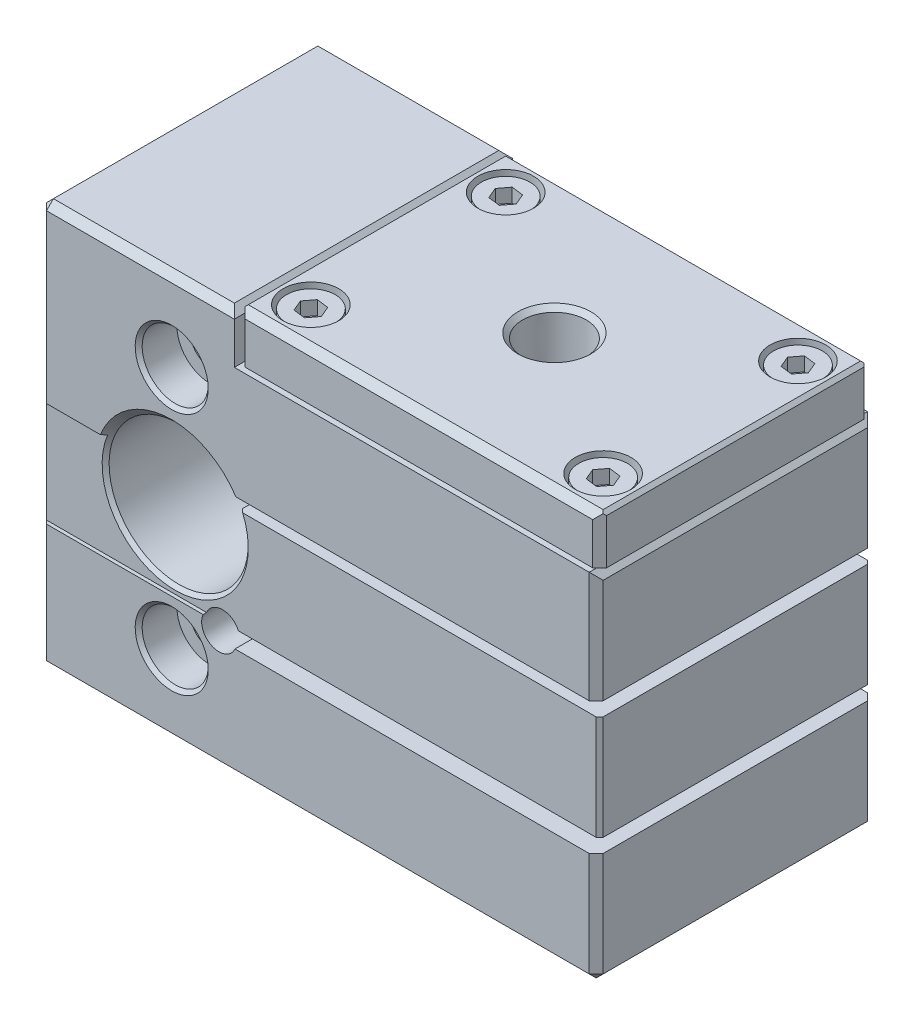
ISO-10303-21;
HEADER;
FILE_DESCRIPTION(('STEP AP214'),'2;1');
FILE_NAME('part.step','',(''),(''),'','','');
FILE_SCHEMA(('AUTOMOTIVE_DESIGN { 1 0 10303 214 1 1 1 1 }'));
ENDSEC;
DATA;
#1=APPLICATION_CONTEXT('core data for automotive mechanical design processes');
#2=APPLICATION_PROTOCOL_DEFINITION('international standard','automotive_design',2000,#1);
#3=PRODUCT_CONTEXT('',#1,'mechanical');
#4=PRODUCT('Part','Part','',(#3));
#5=PRODUCT_RELATED_PRODUCT_CATEGORY('part','',(#4));
#6=PRODUCT_DEFINITION_FORMATION('','',#4);
#7=PRODUCT_DEFINITION_CONTEXT('part definition',#1,'design');
#8=PRODUCT_DEFINITION('design','',#6,#7);
#9=PRODUCT_DEFINITION_SHAPE('','',#8);
#10=(LENGTH_UNIT() NAMED_UNIT(*) SI_UNIT(.MILLI.,.METRE.));
#11=(NAMED_UNIT(*) PLANE_ANGLE_UNIT() SI_UNIT($,.RADIAN.));
#12=(NAMED_UNIT(*) SI_UNIT($,.STERADIAN.) SOLID_ANGLE_UNIT());
#13=UNCERTAINTY_MEASURE_WITH_UNIT(LENGTH_MEASURE(1.E-05),#10,'distance_accuracy_value','');
#14=(GEOMETRIC_REPRESENTATION_CONTEXT(3) GLOBAL_UNCERTAINTY_ASSIGNED_CONTEXT((#13)) GLOBAL_UNIT_ASSIGNED_CONTEXT((#10,
#11,#12)) REPRESENTATION_CONTEXT('',''));
#15=CARTESIAN_POINT('',(0.,0.,0.));
#16=DIRECTION('',(0.,0.,1.));
#17=DIRECTION('',(1.,0.,0.));
#18=AXIS2_PLACEMENT_3D('',#15,#16,#17);
#19=CARTESIAN_POINT('',(55.5594555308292,42.3,9.47216367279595));
#20=DIRECTION('',(0.,-1.,0.));
#21=DIRECTION('',(0.125869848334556,0.,-0.992046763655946));
#22=AXIS2_PLACEMENT_3D('',#19,#20,#21);
#23=PLANE('',#22);
#24=CARTESIAN_POINT('',(56.,42.3,6.00000000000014));
#25=DIRECTION('',(0.,1.,0.));
#26=DIRECTION('',(-0.125869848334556,0.,0.992046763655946));
#27=AXIS2_PLACEMENT_3D('',#24,#25,#26);
#28=CIRCLE('',#27,2.);
#29=CARTESIAN_POINT('',(55.7482603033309,42.3,7.98409352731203));
#30=VERTEX_POINT('',#29);
#31=EDGE_CURVE('E1684',#30,#30,#28,.T.);
#32=ORIENTED_EDGE('',*,*,#31,.T.);
#33=EDGE_LOOP('',(#32));
#34=FACE_BOUND('',#33,.T.);
#35=CARTESIAN_POINT('',(56.,42.3,6.));
#36=DIRECTION('',(0.,-1.,0.));
#37=DIRECTION('',(0.,0.,1.));
#38=AXIS2_PLACEMENT_3D('',#35,#36,#37);
#39=CIRCLE('',#38,2.25);
#40=CARTESIAN_POINT('',(56.,42.3,8.25));
#41=VERTEX_POINT('',#40);
#42=EDGE_CURVE('E1674',#41,#41,#39,.T.);
#43=ORIENTED_EDGE('',*,*,#42,.T.);
#44=EDGE_LOOP('',(#43));
#45=FACE_BOUND('',#44,.T.);
#46=ADVANCED_FACE('F14',(#34,#45),#23,.T.);
#47=CARTESIAN_POINT('',(56.,54.3,6.00000000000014));
#48=DIRECTION('',(0.,1.,0.));
#49=DIRECTION('',(-0.125869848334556,0.,0.992046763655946));
#50=AXIS2_PLACEMENT_3D('',#47,#48,#49);
#51=CYLINDRICAL_SURFACE('',#50,2.);
#52=CARTESIAN_POINT('',(56.,39.5,6.00000000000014));
#53=DIRECTION('',(0.,1.,0.));
#54=DIRECTION('',(0.,0.,1.));
#55=AXIS2_PLACEMENT_3D('',#52,#53,#54);
#56=CIRCLE('',#55,2.);
#57=CARTESIAN_POINT('',(56.,39.5,8.00000000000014));
#58=VERTEX_POINT('',#57);
#59=EDGE_CURVE('E1740',#58,#58,#56,.F.);
#60=ORIENTED_EDGE('',*,*,#59,.F.);
#61=EDGE_LOOP('',(#60));
#62=FACE_BOUND('',#61,.T.);
#63=ORIENTED_EDGE('',*,*,#31,.F.);
#64=EDGE_LOOP('',(#63));
#65=FACE_BOUND('',#64,.T.);
#66=ADVANCED_FACE('F931',(#62,#65),#51,.T.);
#67=CARTESIAN_POINT('',(57.7182753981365,44.3,6.21801297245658));
#68=DIRECTION('',(-0.796202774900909,0.,-0.605029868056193));
#69=DIRECTION('',(-0.605029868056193,0.,0.796202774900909));
#70=AXIS2_PLACEMENT_3D('',#67,#68,#69);
#71=PLANE('',#70);
#72=DIRECTION('',(0.,1.,0.));
#73=VECTOR('',#72,1.);
#74=CARTESIAN_POINT('',(56.6703329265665,44.3,7.59707663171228));
#75=LINE('',#74,#73);
#76=CARTESIAN_POINT('',(56.6703329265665,44.3,7.59707663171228));
#77=VERTEX_POINT('',#76);
#78=CARTESIAN_POINT('',(56.6703329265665,46.3,7.59707663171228));
#79=VERTEX_POINT('',#78);
#80=EDGE_CURVE('E1686',#77,#79,#75,.T.);
#81=ORIENTED_EDGE('',*,*,#80,.T.);
#82=DIRECTION('',(-0.605029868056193,0.,0.796202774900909));
#83=VECTOR('',#82,1.);
#84=CARTESIAN_POINT('',(57.7182753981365,46.3,6.21801297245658));
#85=LINE('',#84,#83);
#86=CARTESIAN_POINT('',(57.7182753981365,46.3,6.21801297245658));
#87=VERTEX_POINT('',#86);
#88=EDGE_CURVE('E33',#87,#79,#85,.T.);
#89=ORIENTED_EDGE('',*,*,#88,.F.);
#90=DIRECTION('',(0.,1.,0.));
#91=VECTOR('',#90,1.);
#92=CARTESIAN_POINT('',(57.7182753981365,44.3,6.21801297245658));
#93=LINE('',#92,#91);
#94=CARTESIAN_POINT('',(57.7182753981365,44.3,6.21801297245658));
#95=VERTEX_POINT('',#94);
#96=EDGE_CURVE('E1700',#95,#87,#93,.T.);
#97=ORIENTED_EDGE('',*,*,#96,.F.);
#98=DIRECTION('',(-0.605029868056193,0.,0.796202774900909));
#99=VECTOR('',#98,1.);
#100=CARTESIAN_POINT('',(57.7182753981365,44.3,6.21801297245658));
#101=LINE('',#100,#99);
#102=EDGE_CURVE('E1703',#95,#77,#101,.T.);
#103=ORIENTED_EDGE('',*,*,#102,.T.);
#104=EDGE_LOOP('',(#81,#89,#97,#103));
#105=FACE_BOUND('',#104,.T.);
#106=ADVANCED_FACE('F937',(#105),#71,.T.);
#107=CARTESIAN_POINT('',(54.9520575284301,44.3,7.37906365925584));
#108=DIRECTION('',(-0.125869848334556,0.,0.992046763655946));
#109=DIRECTION('',(0.992046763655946,0.,0.125869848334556));
#110=AXIS2_PLACEMENT_3D('',#107,#108,#109);
#111=PLANE('',#110);
#112=DIRECTION('',(0.,1.,0.));
#113=VECTOR('',#112,1.);
#114=CARTESIAN_POINT('',(54.9520575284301,44.3,7.37906365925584));
#115=LINE('',#114,#113);
#116=CARTESIAN_POINT('',(54.9520575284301,44.3,7.37906365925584));
#117=VERTEX_POINT('',#116);
#118=CARTESIAN_POINT('',(54.9520575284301,46.3,7.37906365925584));
#119=VERTEX_POINT('',#118);
#120=EDGE_CURVE('E1688',#117,#119,#115,.T.);
#121=ORIENTED_EDGE('',*,*,#120,.T.);
#122=DIRECTION('',(0.992046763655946,0.,0.125869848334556));
#123=VECTOR('',#122,1.);
#124=CARTESIAN_POINT('',(54.9520575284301,46.3,7.37906365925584));
#125=LINE('',#124,#123);
#126=EDGE_CURVE('E1722',#119,#79,#125,.T.);
#127=ORIENTED_EDGE('',*,*,#126,.T.);
#128=ORIENTED_EDGE('',*,*,#80,.F.);
#129=DIRECTION('',(0.992046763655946,0.,0.125869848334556));
#130=VECTOR('',#129,1.);
#131=CARTESIAN_POINT('',(54.9520575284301,44.3,7.37906365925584));
#132=LINE('',#131,#130);
#133=EDGE_CURVE('E1706',#117,#77,#132,.T.);
#134=ORIENTED_EDGE('',*,*,#133,.F.);
#135=EDGE_LOOP('',(#121,#127,#128,#134));
#136=FACE_BOUND('',#135,.T.);
#137=ADVANCED_FACE('F2680',(#136),#111,.F.);
#138=CARTESIAN_POINT('',(54.2817246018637,44.3,5.7819870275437));
#139=DIRECTION('',(-0.922072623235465,0.,0.387016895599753));
#140=DIRECTION('',(0.387016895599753,0.,0.922072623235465));
#141=AXIS2_PLACEMENT_3D('',#138,#139,#140);
#142=PLANE('',#141);
#143=DIRECTION('',(0.,1.,0.));
#144=VECTOR('',#143,1.);
#145=CARTESIAN_POINT('',(54.2817246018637,44.3,5.7819870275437));
#146=LINE('',#145,#144);
#147=CARTESIAN_POINT('',(54.2817246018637,44.3,5.7819870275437));
#148=VERTEX_POINT('',#147);
#149=CARTESIAN_POINT('',(54.2817246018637,46.3,5.7819870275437));
#150=VERTEX_POINT('',#149);
#151=EDGE_CURVE('E1691',#148,#150,#146,.T.);
#152=ORIENTED_EDGE('',*,*,#151,.T.);
#153=DIRECTION('',(0.387016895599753,0.,0.922072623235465));
#154=VECTOR('',#153,1.);
#155=CARTESIAN_POINT('',(54.2817246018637,46.3,5.7819870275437));
#156=LINE('',#155,#154);
#157=EDGE_CURVE('E1725',#150,#119,#156,.T.);
#158=ORIENTED_EDGE('',*,*,#157,.T.);
#159=ORIENTED_EDGE('',*,*,#120,.F.);
#160=DIRECTION('',(0.387016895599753,0.,0.922072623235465));
#161=VECTOR('',#160,1.);
#162=CARTESIAN_POINT('',(54.2817246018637,44.3,5.7819870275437));
#163=LINE('',#162,#161);
#164=EDGE_CURVE('E1710',#148,#117,#163,.T.);
#165=ORIENTED_EDGE('',*,*,#164,.F.);
#166=EDGE_LOOP('',(#152,#158,#159,#165));
#167=FACE_BOUND('',#166,.T.);
#168=ADVANCED_FACE('F2685',(#167),#142,.F.);
#169=CARTESIAN_POINT('',(54.2817246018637,44.3,5.7819870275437));
#170=DIRECTION('',(0.796202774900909,0.,0.605029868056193));
#171=DIRECTION('',(0.605029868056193,0.,-0.796202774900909));
#172=AXIS2_PLACEMENT_3D('',#169,#170,#171);
#173=PLANE('',#172);
#174=DIRECTION('',(0.,1.,0.));
#175=VECTOR('',#174,1.);
#176=CARTESIAN_POINT('',(55.3296670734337,44.3,4.402923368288));
#177=LINE('',#176,#175);
#178=CARTESIAN_POINT('',(55.3296670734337,44.3,4.402923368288));
#179=VERTEX_POINT('',#178);
#180=CARTESIAN_POINT('',(55.3296670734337,46.3,4.402923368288));
#181=VERTEX_POINT('',#180);
#182=EDGE_CURVE('E1694',#179,#181,#177,.T.);
#183=ORIENTED_EDGE('',*,*,#182,.T.);
#184=DIRECTION('',(0.605029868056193,0.,-0.796202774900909));
#185=VECTOR('',#184,1.);
#186=CARTESIAN_POINT('',(54.2817246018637,46.3,5.7819870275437));
#187=LINE('',#186,#185);
#188=EDGE_CURVE('E1728',#150,#181,#187,.T.);
#189=ORIENTED_EDGE('',*,*,#188,.F.);
#190=ORIENTED_EDGE('',*,*,#151,.F.);
#191=DIRECTION('',(0.605029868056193,0.,-0.796202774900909));
#192=VECTOR('',#191,1.);
#193=CARTESIAN_POINT('',(54.2817246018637,44.3,5.7819870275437));
#194=LINE('',#193,#192);
#195=EDGE_CURVE('E1713',#148,#179,#194,.T.);
#196=ORIENTED_EDGE('',*,*,#195,.T.);
#197=EDGE_LOOP('',(#183,#189,#190,#196));
#198=FACE_BOUND('',#197,.T.);
#199=ADVANCED_FACE('F2694',(#198),#173,.T.);
#200=CARTESIAN_POINT('',(57.0479424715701,44.3,4.62093634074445));
#201=DIRECTION('',(0.125869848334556,0.,-0.992046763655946));
#202=DIRECTION('',(-0.992046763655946,0.,-0.125869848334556));
#203=AXIS2_PLACEMENT_3D('',#200,#201,#202);
#204=PLANE('',#203);
#205=DIRECTION('',(0.,1.,0.));
#206=VECTOR('',#205,1.);
#207=CARTESIAN_POINT('',(57.0479424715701,44.3,4.62093634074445));
#208=LINE('',#207,#206);
#209=CARTESIAN_POINT('',(57.0479424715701,44.3,4.62093634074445));
#210=VERTEX_POINT('',#209);
#211=CARTESIAN_POINT('',(57.0479424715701,46.3,4.62093634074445));
#212=VERTEX_POINT('',#211);
#213=EDGE_CURVE('E1697',#210,#212,#208,.T.);
#214=ORIENTED_EDGE('',*,*,#213,.T.);
#215=DIRECTION('',(-0.992046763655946,0.,-0.125869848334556));
#216=VECTOR('',#215,1.);
#217=CARTESIAN_POINT('',(57.0479424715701,46.3,4.62093634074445));
#218=LINE('',#217,#216);
#219=EDGE_CURVE('E1731',#212,#181,#218,.T.);
#220=ORIENTED_EDGE('',*,*,#219,.T.);
#221=ORIENTED_EDGE('',*,*,#182,.F.);
#222=DIRECTION('',(-0.992046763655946,0.,-0.125869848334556));
#223=VECTOR('',#222,1.);
#224=CARTESIAN_POINT('',(57.0479424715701,44.3,4.62093634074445));
#225=LINE('',#224,#223);
#226=EDGE_CURVE('E1716',#210,#179,#225,.T.);
#227=ORIENTED_EDGE('',*,*,#226,.F.);
#228=EDGE_LOOP('',(#214,#220,#221,#227));
#229=FACE_BOUND('',#228,.T.);
#230=ADVANCED_FACE('F2703',(#229),#204,.F.);
#231=CARTESIAN_POINT('',(57.7182753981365,44.3,6.21801297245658));
#232=DIRECTION('',(0.922072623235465,0.,-0.387016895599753));
#233=DIRECTION('',(-0.387016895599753,0.,-0.922072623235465));
#234=AXIS2_PLACEMENT_3D('',#231,#232,#233);
#235=PLANE('',#234);
#236=DIRECTION('',(-0.387016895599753,0.,-0.922072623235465));
#237=VECTOR('',#236,1.);
#238=CARTESIAN_POINT('',(57.7182753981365,44.3,6.21801297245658));
#239=LINE('',#238,#237);
#240=EDGE_CURVE('E1702',#95,#210,#239,.T.);
#241=ORIENTED_EDGE('',*,*,#240,.F.);
#242=ORIENTED_EDGE('',*,*,#96,.T.);
#243=DIRECTION('',(-0.387016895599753,0.,-0.922072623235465));
#244=VECTOR('',#243,1.);
#245=CARTESIAN_POINT('',(57.7182753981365,46.3,6.21801297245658));
#246=LINE('',#245,#244);
#247=EDGE_CURVE('E1707',#87,#212,#246,.T.);
#248=ORIENTED_EDGE('',*,*,#247,.T.);
#249=ORIENTED_EDGE('',*,*,#213,.F.);
#250=EDGE_LOOP('',(#241,#242,#248,#249));
#251=FACE_BOUND('',#250,.T.);
#252=ADVANCED_FACE('F955',(#251),#235,.F.);
#253=CARTESIAN_POINT('',(56.6703329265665,44.3,7.59707663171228));
#254=DIRECTION('',(0.,1.,0.));
#255=DIRECTION('',(-0.125869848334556,0.,0.992046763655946));
#256=AXIS2_PLACEMENT_3D('',#253,#254,#255);
#257=PLANE('',#256);
#258=ORIENTED_EDGE('',*,*,#102,.F.);
#259=ORIENTED_EDGE('',*,*,#240,.T.);
#260=ORIENTED_EDGE('',*,*,#226,.T.);
#261=ORIENTED_EDGE('',*,*,#195,.F.);
#262=ORIENTED_EDGE('',*,*,#164,.T.);
#263=ORIENTED_EDGE('',*,*,#133,.T.);
#264=EDGE_LOOP('',(#258,#259,#260,#261,#262,#263));
#265=FACE_BOUND('',#264,.T.);
#266=ADVANCED_FACE('F953',(#265),#257,.T.);
#267=CARTESIAN_POINT('',(56.,46.3,6.00000000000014));
#268=DIRECTION('',(0.,1.,0.));
#269=DIRECTION('',(-0.125869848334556,0.,0.992046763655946));
#270=AXIS2_PLACEMENT_3D('',#267,#268,#269);
#271=PLANE('',#270);
#272=CARTESIAN_POINT('',(56.,46.3,6.00000000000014));
#273=DIRECTION('',(0.,1.,0.));
#274=DIRECTION('',(-0.125869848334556,0.,0.992046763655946));
#275=AXIS2_PLACEMENT_3D('',#272,#273,#274);
#276=CIRCLE('',#275,3.5);
#277=CARTESIAN_POINT('',(55.5594555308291,46.3,9.47216367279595));
#278=VERTEX_POINT('',#277);
#279=EDGE_CURVE('E1678',#278,#278,#276,.T.);
#280=ORIENTED_EDGE('',*,*,#279,.T.);
#281=EDGE_LOOP('',(#280));
#282=FACE_BOUND('',#281,.T.);
#283=ORIENTED_EDGE('',*,*,#247,.F.);
#284=ORIENTED_EDGE('',*,*,#88,.T.);
#285=ORIENTED_EDGE('',*,*,#126,.F.);
#286=ORIENTED_EDGE('',*,*,#157,.F.);
#287=ORIENTED_EDGE('',*,*,#188,.T.);
#288=ORIENTED_EDGE('',*,*,#219,.F.);
#289=EDGE_LOOP('',(#283,#284,#285,#286,#287,#288));
#290=FACE_BOUND('',#289,.T.);
#291=ADVANCED_FACE('F949',(#282,#290),#271,.T.);
#292=CARTESIAN_POINT('',(56.,54.3,6.00000000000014));
#293=DIRECTION('',(0.,1.,0.));
#294=DIRECTION('',(-0.125869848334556,0.,0.992046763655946));
#295=AXIS2_PLACEMENT_3D('',#292,#293,#294);
#296=CYLINDRICAL_SURFACE('',#295,3.5);
#297=CARTESIAN_POINT('',(56.,42.3,6.00000000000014));
#298=DIRECTION('',(0.,1.,0.));
#299=DIRECTION('',(-0.125869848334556,0.,0.992046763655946));
#300=AXIS2_PLACEMENT_3D('',#297,#298,#299);
#301=CIRCLE('',#300,3.5);
#302=CARTESIAN_POINT('',(55.5594555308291,42.3,9.47216367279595));
#303=VERTEX_POINT('',#302);
#304=EDGE_CURVE('E1681',#303,#303,#301,.T.);
#305=ORIENTED_EDGE('',*,*,#304,.T.);
#306=EDGE_LOOP('',(#305));
#307=FACE_BOUND('',#306,.T.);
#308=ORIENTED_EDGE('',*,*,#279,.F.);
#309=EDGE_LOOP('',(#308));
#310=FACE_BOUND('',#309,.T.);
#311=ADVANCED_FACE('F945',(#307,#310),#296,.T.);
#312=CARTESIAN_POINT('',(40.7735026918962,-6.5,20.));
#313=DIRECTION('',(0.,-1.,0.));
#314=DIRECTION('',(0.,0.,-1.));
#315=AXIS2_PLACEMENT_3D('',#312,#313,#314);
#316=PLANE('',#315);
#317=DIRECTION('',(0.5,0.,0.866025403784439));
#318=VECTOR('',#317,1.);
#319=CARTESIAN_POINT('',(37.8867513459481,-6.5,15.));
#320=LINE('',#319,#318);
#321=CARTESIAN_POINT('',(37.8867513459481,-6.5,15.));
#322=VERTEX_POINT('',#321);
#323=CARTESIAN_POINT('',(40.7735026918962,-6.5,20.));
#324=VERTEX_POINT('',#323);
#325=EDGE_CURVE('E1459',#322,#324,#320,.T.);
#326=ORIENTED_EDGE('',*,*,#325,.T.);
#327=DIRECTION('',(-0.5,0.,0.866025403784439));
#328=VECTOR('',#327,1.);
#329=CARTESIAN_POINT('',(40.7735026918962,-6.5,20.));
#330=LINE('',#329,#328);
#331=CARTESIAN_POINT('',(37.8867513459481,-6.5,25.));
#332=VERTEX_POINT('',#331);
#333=EDGE_CURVE('E1484',#324,#332,#330,.T.);
#334=ORIENTED_EDGE('',*,*,#333,.T.);
#335=DIRECTION('',(-1.,0.,0.));
#336=VECTOR('',#335,1.);
#337=CARTESIAN_POINT('',(37.8867513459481,-6.5,25.));
#338=LINE('',#337,#336);
#339=CARTESIAN_POINT('',(32.1132486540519,-6.5,25.));
#340=VERTEX_POINT('',#339);
#341=EDGE_CURVE('E1481',#332,#340,#338,.T.);
#342=ORIENTED_EDGE('',*,*,#341,.T.);
#343=DIRECTION('',(-0.5,0.,-0.866025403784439));
#344=VECTOR('',#343,1.);
#345=CARTESIAN_POINT('',(32.1132486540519,-6.5,25.));
#346=LINE('',#345,#344);
#347=CARTESIAN_POINT('',(29.2264973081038,-6.5,20.));
#348=VERTEX_POINT('',#347);
#349=EDGE_CURVE('E1478',#340,#348,#346,.T.);
#350=ORIENTED_EDGE('',*,*,#349,.T.);
#351=DIRECTION('',(0.5,0.,-0.866025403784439));
#352=VECTOR('',#351,1.);
#353=CARTESIAN_POINT('',(29.2264973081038,-6.5,20.));
#354=LINE('',#353,#352);
#355=CARTESIAN_POINT('',(32.1132486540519,-6.5,15.));
#356=VERTEX_POINT('',#355);
#357=EDGE_CURVE('E1475',#348,#356,#354,.T.);
#358=ORIENTED_EDGE('',*,*,#357,.T.);
#359=DIRECTION('',(1.,0.,0.));
#360=VECTOR('',#359,1.);
#361=CARTESIAN_POINT('',(32.1132486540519,-6.5,15.));
#362=LINE('',#361,#360);
#363=EDGE_CURVE('E1447',#356,#322,#362,.T.);
#364=ORIENTED_EDGE('',*,*,#363,.T.);
#365=EDGE_LOOP('',(#326,#334,#342,#350,#358,#364));
#366=FACE_BOUND('',#365,.T.);
#367=ADVANCED_FACE('F948',(#366),#316,.T.);
#368=CARTESIAN_POINT('',(37.8867513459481,-6.5,25.));
#369=DIRECTION('',(0.,0.,1.));
#370=DIRECTION('',(-1.,0.,0.));
#371=AXIS2_PLACEMENT_3D('',#368,#369,#370);
#372=PLANE('',#371);
#373=DIRECTION('',(-1.,0.,0.));
#374=VECTOR('',#373,1.);
#375=CARTESIAN_POINT('',(37.8867513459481,-11.5,25.));
#376=LINE('',#375,#374);
#377=CARTESIAN_POINT('',(37.8867513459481,-11.5,25.));
#378=VERTEX_POINT('',#377);
#379=CARTESIAN_POINT('',(32.1132486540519,-11.5,25.));
#380=VERTEX_POINT('',#379);
#381=EDGE_CURVE('E1466',#378,#380,#376,.T.);
#382=ORIENTED_EDGE('',*,*,#381,.T.);
#383=DIRECTION('',(0.,-1.,0.));
#384=VECTOR('',#383,1.);
#385=CARTESIAN_POINT('',(32.1132486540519,-6.5,25.));
#386=LINE('',#385,#384);
#387=EDGE_CURVE('E1449',#340,#380,#386,.T.);
#388=ORIENTED_EDGE('',*,*,#387,.F.);
#389=ORIENTED_EDGE('',*,*,#341,.F.);
#390=DIRECTION('',(0.,-1.,0.));
#391=VECTOR('',#390,1.);
#392=CARTESIAN_POINT('',(37.8867513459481,-6.5,25.));
#393=LINE('',#392,#391);
#394=EDGE_CURVE('E1446',#332,#378,#393,.T.);
#395=ORIENTED_EDGE('',*,*,#394,.T.);
#396=EDGE_LOOP('',(#382,#388,#389,#395));
#397=FACE_BOUND('',#396,.T.);
#398=ADVANCED_FACE('F1032',(#397),#372,.F.);
#399=CARTESIAN_POINT('',(32.1132486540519,-6.5,25.));
#400=DIRECTION('',(-0.866025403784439,0.,0.5));
#401=DIRECTION('',(-0.5,0.,-0.866025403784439));
#402=AXIS2_PLACEMENT_3D('',#399,#400,#401);
#403=PLANE('',#402);
#404=DIRECTION('',(-0.5,0.,-0.866025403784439));
#405=VECTOR('',#404,1.);
#406=CARTESIAN_POINT('',(32.1132486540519,-11.5,25.));
#407=LINE('',#406,#405);
#408=CARTESIAN_POINT('',(29.2264973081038,-11.5,20.));
#409=VERTEX_POINT('',#408);
#410=EDGE_CURVE('E1463',#380,#409,#407,.T.);
#411=ORIENTED_EDGE('',*,*,#410,.T.);
#412=DIRECTION('',(0.,-1.,0.));
#413=VECTOR('',#412,1.);
#414=CARTESIAN_POINT('',(29.2264973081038,-6.5,20.));
#415=LINE('',#414,#413);
#416=EDGE_CURVE('E1451',#348,#409,#415,.T.);
#417=ORIENTED_EDGE('',*,*,#416,.F.);
#418=ORIENTED_EDGE('',*,*,#349,.F.);
#419=ORIENTED_EDGE('',*,*,#387,.T.);
#420=EDGE_LOOP('',(#411,#417,#418,#419));
#421=FACE_BOUND('',#420,.T.);
#422=ADVANCED_FACE('F1112',(#421),#403,.F.);
#423=CARTESIAN_POINT('',(29.2264973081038,-6.5,20.));
#424=DIRECTION('',(-0.866025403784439,0.,-0.5));
#425=DIRECTION('',(0.5,0.,-0.866025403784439));
#426=AXIS2_PLACEMENT_3D('',#423,#424,#425);
#427=PLANE('',#426);
#428=DIRECTION('',(0.5,0.,-0.866025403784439));
#429=VECTOR('',#428,1.);
#430=CARTESIAN_POINT('',(29.2264973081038,-11.5,20.));
#431=LINE('',#430,#429);
#432=CARTESIAN_POINT('',(32.1132486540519,-11.5,15.));
#433=VERTEX_POINT('',#432);
#434=EDGE_CURVE('E1460',#409,#433,#431,.T.);
#435=ORIENTED_EDGE('',*,*,#434,.T.);
#436=DIRECTION('',(0.,-1.,0.));
#437=VECTOR('',#436,1.);
#438=CARTESIAN_POINT('',(32.1132486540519,-6.5,15.));
#439=LINE('',#438,#437);
#440=EDGE_CURVE('E1453',#356,#433,#439,.T.);
#441=ORIENTED_EDGE('',*,*,#440,.F.);
#442=ORIENTED_EDGE('',*,*,#357,.F.);
#443=ORIENTED_EDGE('',*,*,#416,.T.);
#444=EDGE_LOOP('',(#435,#441,#442,#443));
#445=FACE_BOUND('',#444,.T.);
#446=ADVANCED_FACE('F1108',(#445),#427,.F.);
#447=CARTESIAN_POINT('',(32.1132486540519,-6.5,15.));
#448=DIRECTION('',(0.,0.,-1.));
#449=DIRECTION('',(0.,1.,0.));
#450=AXIS2_PLACEMENT_3D('',#447,#448,#449);
#451=PLANE('',#450);
#452=DIRECTION('',(1.,0.,0.));
#453=VECTOR('',#452,1.);
#454=CARTESIAN_POINT('',(32.1132486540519,-11.5,15.));
#455=LINE('',#454,#453);
#456=CARTESIAN_POINT('',(37.8867513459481,-11.5,15.));
#457=VERTEX_POINT('',#456);
#458=EDGE_CURVE('E1456',#433,#457,#455,.T.);
#459=ORIENTED_EDGE('',*,*,#458,.T.);
#460=DIRECTION('',(0.,-1.,0.));
#461=VECTOR('',#460,1.);
#462=CARTESIAN_POINT('',(37.8867513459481,-6.5,15.));
#463=LINE('',#462,#461);
#464=EDGE_CURVE('E1442',#322,#457,#463,.T.);
#465=ORIENTED_EDGE('',*,*,#464,.F.);
#466=ORIENTED_EDGE('',*,*,#363,.F.);
#467=ORIENTED_EDGE('',*,*,#440,.T.);
#468=EDGE_LOOP('',(#459,#465,#466,#467));
#469=FACE_BOUND('',#468,.T.);
#470=ADVANCED_FACE('F1104',(#469),#451,.F.);
#471=CARTESIAN_POINT('',(37.8867513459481,-6.5,15.));
#472=DIRECTION('',(0.866025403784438,0.,-0.5));
#473=DIRECTION('',(0.5,0.,0.866025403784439));
#474=AXIS2_PLACEMENT_3D('',#471,#472,#473);
#475=PLANE('',#474);
#476=DIRECTION('',(0.5,0.,0.866025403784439));
#477=VECTOR('',#476,1.);
#478=CARTESIAN_POINT('',(37.8867513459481,-11.5,15.));
#479=LINE('',#478,#477);
#480=CARTESIAN_POINT('',(40.7735026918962,-11.5,20.));
#481=VERTEX_POINT('',#480);
#482=EDGE_CURVE('E642',#457,#481,#479,.T.);
#483=ORIENTED_EDGE('',*,*,#482,.T.);
#484=DIRECTION('',(0.,-1.,0.));
#485=VECTOR('',#484,1.);
#486=CARTESIAN_POINT('',(40.7735026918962,-6.5,20.));
#487=LINE('',#486,#485);
#488=EDGE_CURVE('E1443',#324,#481,#487,.T.);
#489=ORIENTED_EDGE('',*,*,#488,.F.);
#490=ORIENTED_EDGE('',*,*,#325,.F.);
#491=ORIENTED_EDGE('',*,*,#464,.T.);
#492=EDGE_LOOP('',(#483,#489,#490,#491));
#493=FACE_BOUND('',#492,.T.);
#494=ADVANCED_FACE('F1107',(#493),#475,.F.);
#495=CARTESIAN_POINT('',(40.7735026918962,-6.5,20.));
#496=DIRECTION('',(0.866025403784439,0.,0.5));
#497=DIRECTION('',(-0.5,0.,0.866025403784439));
#498=AXIS2_PLACEMENT_3D('',#495,#496,#497);
#499=PLANE('',#498);
#500=DIRECTION('',(-0.5,0.,0.866025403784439));
#501=VECTOR('',#500,1.);
#502=CARTESIAN_POINT('',(40.7735026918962,-11.5,20.));
#503=LINE('',#502,#501);
#504=EDGE_CURVE('E1469',#481,#378,#503,.T.);
#505=ORIENTED_EDGE('',*,*,#504,.T.);
#506=ORIENTED_EDGE('',*,*,#394,.F.);
#507=ORIENTED_EDGE('',*,*,#333,.F.);
#508=ORIENTED_EDGE('',*,*,#488,.T.);
#509=EDGE_LOOP('',(#505,#506,#507,#508));
#510=FACE_BOUND('',#509,.T.);
#511=ADVANCED_FACE('F918',(#510),#499,.F.);
#512=CARTESIAN_POINT('',(46.5,-11.5,20.));
#513=DIRECTION('',(0.,1.,0.));
#514=DIRECTION('',(0.,0.,1.));
#515=AXIS2_PLACEMENT_3D('',#512,#513,#514);
#516=PLANE('',#515);
#517=ORIENTED_EDGE('',*,*,#504,.F.);
#518=ORIENTED_EDGE('',*,*,#482,.F.);
#519=ORIENTED_EDGE('',*,*,#458,.F.);
#520=ORIENTED_EDGE('',*,*,#434,.F.);
#521=ORIENTED_EDGE('',*,*,#410,.F.);
#522=ORIENTED_EDGE('',*,*,#381,.F.);
#523=EDGE_LOOP('',(#517,#518,#519,#520,#521,#522));
#524=FACE_BOUND('',#523,.T.);
#525=CARTESIAN_POINT('',(35.,-11.5,20.));
#526=DIRECTION('',(0.,1.,0.));
#527=DIRECTION('',(0.,0.,1.));
#528=AXIS2_PLACEMENT_3D('',#525,#526,#527);
#529=CIRCLE('',#528,11.5);
#530=CARTESIAN_POINT('',(35.,-11.5,31.5));
#531=VERTEX_POINT('',#530);
#532=EDGE_CURVE('E1439',#531,#531,#529,.T.);
#533=ORIENTED_EDGE('',*,*,#532,.F.);
#534=EDGE_LOOP('',(#533));
#535=FACE_BOUND('',#534,.T.);
#536=ADVANCED_FACE('F1064',(#524,#535),#516,.F.);
#537=CARTESIAN_POINT('',(13.3296670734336,44.3,4.40292336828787));
#538=DIRECTION('',(0.,1.,0.));
#539=DIRECTION('',(0.125869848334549,0.,-0.992046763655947));
#540=AXIS2_PLACEMENT_3D('',#537,#538,#539);
#541=PLANE('',#540);
#542=DIRECTION('',(0.605029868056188,0.,-0.796202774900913));
#543=VECTOR('',#542,1.);
#544=CARTESIAN_POINT('',(12.2817246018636,44.3,5.78198702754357));
#545=LINE('',#544,#543);
#546=CARTESIAN_POINT('',(12.2817246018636,44.3,5.78198702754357));
#547=VERTEX_POINT('',#546);
#548=CARTESIAN_POINT('',(13.3296670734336,44.3,4.40292336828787));
#549=VERTEX_POINT('',#548);
#550=EDGE_CURVE('E1511',#547,#549,#545,.T.);
#551=ORIENTED_EDGE('',*,*,#550,.F.);
#552=DIRECTION('',(0.387016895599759,0.,0.922072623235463));
#553=VECTOR('',#552,1.);
#554=CARTESIAN_POINT('',(12.2817246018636,44.3,5.78198702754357));
#555=LINE('',#554,#553);
#556=CARTESIAN_POINT('',(12.95205752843,44.3,7.37906365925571));
#557=VERTEX_POINT('',#556);
#558=EDGE_CURVE('E1510',#547,#557,#555,.T.);
#559=ORIENTED_EDGE('',*,*,#558,.T.);
#560=DIRECTION('',(0.992046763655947,0.,0.125869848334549));
#561=VECTOR('',#560,1.);
#562=CARTESIAN_POINT('',(12.95205752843,44.3,7.37906365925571));
#563=LINE('',#562,#561);
#564=CARTESIAN_POINT('',(14.6703329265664,44.3,7.59707663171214));
#565=VERTEX_POINT('',#564);
#566=EDGE_CURVE('E1524',#557,#565,#563,.T.);
#567=ORIENTED_EDGE('',*,*,#566,.T.);
#568=DIRECTION('',(-0.605029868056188,0.,0.796202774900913));
#569=VECTOR('',#568,1.);
#570=CARTESIAN_POINT('',(15.7182753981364,44.3,6.21801297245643));
#571=LINE('',#570,#569);
#572=CARTESIAN_POINT('',(15.7182753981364,44.3,6.21801297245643));
#573=VERTEX_POINT('',#572);
#574=EDGE_CURVE('E1521',#573,#565,#571,.T.);
#575=ORIENTED_EDGE('',*,*,#574,.F.);
#576=DIRECTION('',(-0.387016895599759,0.,-0.922072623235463));
#577=VECTOR('',#576,1.);
#578=CARTESIAN_POINT('',(15.7182753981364,44.3,6.21801297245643));
#579=LINE('',#578,#577);
#580=CARTESIAN_POINT('',(15.04794247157,44.3,4.6209363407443));
#581=VERTEX_POINT('',#580);
#582=EDGE_CURVE('E1518',#573,#581,#579,.T.);
#583=ORIENTED_EDGE('',*,*,#582,.T.);
#584=DIRECTION('',(-0.992046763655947,0.,-0.12586984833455));
#585=VECTOR('',#584,1.);
#586=CARTESIAN_POINT('',(15.04794247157,44.3,4.6209363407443));
#587=LINE('',#586,#585);
#588=EDGE_CURVE('E1514',#581,#549,#587,.T.);
#589=ORIENTED_EDGE('',*,*,#588,.T.);
#590=EDGE_LOOP('',(#551,#559,#567,#575,#583,#589));
#591=FACE_BOUND('',#590,.T.);
#592=ADVANCED_FACE('F1020',(#591),#541,.T.);
#593=CARTESIAN_POINT('',(56.6703329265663,44.3,35.5970766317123));
#594=DIRECTION('',(0.,1.,0.));
#595=DIRECTION('',(-0.125869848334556,0.,0.992046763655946));
#596=AXIS2_PLACEMENT_3D('',#593,#594,#595);
#597=PLANE('',#596);
#598=DIRECTION('',(-0.605029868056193,0.,0.796202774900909));
#599=VECTOR('',#598,1.);
#600=CARTESIAN_POINT('',(57.7182753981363,44.3,34.2180129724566));
#601=LINE('',#600,#599);
#602=CARTESIAN_POINT('',(57.7182753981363,44.3,34.2180129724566));
#603=VERTEX_POINT('',#602);
#604=CARTESIAN_POINT('',(56.6703329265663,44.3,35.5970766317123));
#605=VERTEX_POINT('',#604);
#606=EDGE_CURVE('E1572',#603,#605,#601,.T.);
#607=ORIENTED_EDGE('',*,*,#606,.F.);
#608=DIRECTION('',(-0.387016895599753,0.,-0.922072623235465));
#609=VECTOR('',#608,1.);
#610=CARTESIAN_POINT('',(57.7182753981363,44.3,34.2180129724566));
#611=LINE('',#610,#609);
#612=CARTESIAN_POINT('',(57.0479424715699,44.3,32.6209363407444));
#613=VERTEX_POINT('',#612);
#614=EDGE_CURVE('E1571',#603,#613,#611,.T.);
#615=ORIENTED_EDGE('',*,*,#614,.T.);
#616=DIRECTION('',(-0.992046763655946,0.,-0.125869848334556));
#617=VECTOR('',#616,1.);
#618=CARTESIAN_POINT('',(57.0479424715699,44.3,32.6209363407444));
#619=LINE('',#618,#617);
#620=CARTESIAN_POINT('',(55.3296670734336,44.3,32.402923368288));
#621=VERTEX_POINT('',#620);
#622=EDGE_CURVE('E1585',#613,#621,#619,.T.);
#623=ORIENTED_EDGE('',*,*,#622,.T.);
#624=DIRECTION('',(0.605029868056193,0.,-0.796202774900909));
#625=VECTOR('',#624,1.);
#626=CARTESIAN_POINT('',(54.2817246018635,44.3,33.7819870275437));
#627=LINE('',#626,#625);
#628=CARTESIAN_POINT('',(54.2817246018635,44.3,33.7819870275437));
#629=VERTEX_POINT('',#628);
#630=EDGE_CURVE('E1582',#629,#621,#627,.T.);
#631=ORIENTED_EDGE('',*,*,#630,.F.);
#632=DIRECTION('',(0.387016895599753,0.,0.922072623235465));
#633=VECTOR('',#632,1.);
#634=CARTESIAN_POINT('',(54.2817246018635,44.3,33.7819870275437));
#635=LINE('',#634,#633);
#636=CARTESIAN_POINT('',(54.9520575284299,44.3,35.3790636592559));
#637=VERTEX_POINT('',#636);
#638=EDGE_CURVE('E1579',#629,#637,#635,.T.);
#639=ORIENTED_EDGE('',*,*,#638,.T.);
#640=DIRECTION('',(0.992046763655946,0.,0.125869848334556));
#641=VECTOR('',#640,1.);
#642=CARTESIAN_POINT('',(54.9520575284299,44.3,35.3790636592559));
#643=LINE('',#642,#641);
#644=EDGE_CURVE('E1575',#637,#605,#643,.T.);
#645=ORIENTED_EDGE('',*,*,#644,.T.);
#646=EDGE_LOOP('',(#607,#615,#623,#631,#639,#645));
#647=FACE_BOUND('',#646,.T.);
#648=ADVANCED_FACE('F960',(#647),#597,.T.);
#649=CARTESIAN_POINT('',(13.3296670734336,44.3,32.4029233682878));
#650=DIRECTION('',(0.,1.,0.));
#651=DIRECTION('',(0.125869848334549,0.,-0.992046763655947));
#652=AXIS2_PLACEMENT_3D('',#649,#650,#651);
#653=PLANE('',#652);
#654=DIRECTION('',(0.605029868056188,0.,-0.796202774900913));
#655=VECTOR('',#654,1.);
#656=CARTESIAN_POINT('',(12.2817246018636,44.3,33.7819870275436));
#657=LINE('',#656,#655);
#658=CARTESIAN_POINT('',(12.2817246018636,44.3,33.7819870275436));
#659=VERTEX_POINT('',#658);
#660=CARTESIAN_POINT('',(13.3296670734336,44.3,32.4029233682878));
#661=VERTEX_POINT('',#660);
#662=EDGE_CURVE('E1639',#659,#661,#657,.T.);
#663=ORIENTED_EDGE('',*,*,#662,.F.);
#664=DIRECTION('',(0.387016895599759,0.,0.922072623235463));
#665=VECTOR('',#664,1.);
#666=CARTESIAN_POINT('',(12.2817246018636,44.3,33.7819870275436));
#667=LINE('',#666,#665);
#668=CARTESIAN_POINT('',(12.95205752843,44.3,35.3790636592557));
#669=VERTEX_POINT('',#668);
#670=EDGE_CURVE('E1638',#659,#669,#667,.T.);
#671=ORIENTED_EDGE('',*,*,#670,.T.);
#672=DIRECTION('',(0.992046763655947,0.,0.125869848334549));
#673=VECTOR('',#672,1.);
#674=CARTESIAN_POINT('',(12.95205752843,44.3,35.3790636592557));
#675=LINE('',#674,#673);
#676=CARTESIAN_POINT('',(14.6703329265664,44.3,35.5970766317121));
#677=VERTEX_POINT('',#676);
#678=EDGE_CURVE('E1652',#669,#677,#675,.T.);
#679=ORIENTED_EDGE('',*,*,#678,.T.);
#680=DIRECTION('',(-0.605029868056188,0.,0.796202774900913));
#681=VECTOR('',#680,1.);
#682=CARTESIAN_POINT('',(15.7182753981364,44.3,34.2180129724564));
#683=LINE('',#682,#681);
#684=CARTESIAN_POINT('',(15.7182753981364,44.3,34.2180129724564));
#685=VERTEX_POINT('',#684);
#686=EDGE_CURVE('E1649',#685,#677,#683,.T.);
#687=ORIENTED_EDGE('',*,*,#686,.F.);
#688=DIRECTION('',(-0.387016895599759,0.,-0.922072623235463));
#689=VECTOR('',#688,1.);
#690=CARTESIAN_POINT('',(15.7182753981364,44.3,34.2180129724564));
#691=LINE('',#690,#689);
#692=CARTESIAN_POINT('',(15.04794247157,44.3,32.6209363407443));
#693=VERTEX_POINT('',#692);
#694=EDGE_CURVE('E1646',#685,#693,#691,.T.);
#695=ORIENTED_EDGE('',*,*,#694,.T.);
#696=DIRECTION('',(-0.992046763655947,0.,-0.12586984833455));
#697=VECTOR('',#696,1.);
#698=CARTESIAN_POINT('',(15.04794247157,44.3,32.6209363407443));
#699=LINE('',#698,#697);
#700=EDGE_CURVE('E1642',#693,#661,#699,.T.);
#701=ORIENTED_EDGE('',*,*,#700,.T.);
#702=EDGE_LOOP('',(#663,#671,#679,#687,#695,#701));
#703=FACE_BOUND('',#702,.T.);
#704=ADVANCED_FACE('F956',(#703),#653,.T.);
#705=CARTESIAN_POINT('',(0.,0.,40.));
#706=DIRECTION('',(0.,0.,1.));
#707=DIRECTION('',(0.,1.,0.));
#708=AXIS2_PLACEMENT_3D('',#705,#706,#707);
#709=CYLINDRICAL_SURFACE('',#708,2.75);
#710=CARTESIAN_POINT('',(0.,0.,34.5));
#711=DIRECTION('',(0.,0.,1.));
#712=DIRECTION('',(0.,1.,0.));
#713=AXIS2_PLACEMENT_3D('',#710,#711,#712);
#714=CIRCLE('',#713,2.75);
#715=CARTESIAN_POINT('',(0.,2.75,34.5));
#716=VERTEX_POINT('',#715);
#717=EDGE_CURVE('E1359',#716,#716,#714,.T.);
#718=ORIENTED_EDGE('',*,*,#717,.T.);
#719=EDGE_LOOP('',(#718));
#720=FACE_BOUND('',#719,.T.);
#721=CARTESIAN_POINT('',(0.,0.,5.5));
#722=DIRECTION('',(0.,0.,-1.));
#723=DIRECTION('',(0.,-1.,0.));
#724=AXIS2_PLACEMENT_3D('',#721,#722,#723);
#725=CIRCLE('',#724,2.75);
#726=CARTESIAN_POINT('',(0.,-2.75,5.5));
#727=VERTEX_POINT('',#726);
#728=EDGE_CURVE('E1329',#727,#727,#725,.F.);
#729=ORIENTED_EDGE('',*,*,#728,.F.);
#730=EDGE_LOOP('',(#729));
#731=FACE_BOUND('',#730,.T.);
#732=ADVANCED_FACE('F959',(#720,#731),#709,.F.);
#733=CARTESIAN_POINT('',(35.,3.5,20.));
#734=DIRECTION('',(0.,1.,0.));
#735=DIRECTION('',(0.,0.,1.));
#736=AXIS2_PLACEMENT_3D('',#733,#734,#735);
#737=CYLINDRICAL_SURFACE('',#736,11.5);
#738=CARTESIAN_POINT('',(35.,-11.25,20.));
#739=DIRECTION('',(0.,-1.,0.));
#740=DIRECTION('',(0.,0.,1.));
#741=AXIS2_PLACEMENT_3D('',#738,#739,#740);
#742=CIRCLE('',#741,11.5);
#743=CARTESIAN_POINT('',(35.,-11.25,31.5));
#744=VERTEX_POINT('',#743);
#745=EDGE_CURVE('E1435',#744,#744,#742,.T.);
#746=ORIENTED_EDGE('',*,*,#745,.T.);
#747=EDGE_LOOP('',(#746));
#748=FACE_BOUND('',#747,.T.);
#749=ORIENTED_EDGE('',*,*,#532,.T.);
#750=EDGE_LOOP('',(#749));
#751=FACE_BOUND('',#750,.T.);
#752=ADVANCED_FACE('F1060',(#748,#751),#737,.T.);
#753=CARTESIAN_POINT('',(12.95205752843,44.3,7.37906365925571));
#754=DIRECTION('',(-0.125869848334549,0.,0.992046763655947));
#755=DIRECTION('',(0.992046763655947,0.,0.125869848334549));
#756=AXIS2_PLACEMENT_3D('',#753,#754,#755);
#757=PLANE('',#756);
#758=DIRECTION('',(0.,1.,0.));
#759=VECTOR('',#758,1.);
#760=CARTESIAN_POINT('',(12.95205752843,44.3,7.37906365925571));
#761=LINE('',#760,#759);
#762=CARTESIAN_POINT('',(12.95205752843,46.3,7.37906365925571));
#763=VERTEX_POINT('',#762);
#764=EDGE_CURVE('E1505',#557,#763,#761,.T.);
#765=ORIENTED_EDGE('',*,*,#764,.T.);
#766=DIRECTION('',(0.992046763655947,0.,0.125869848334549));
#767=VECTOR('',#766,1.);
#768=CARTESIAN_POINT('',(12.95205752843,46.3,7.37906365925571));
#769=LINE('',#768,#767);
#770=CARTESIAN_POINT('',(14.6703329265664,46.3,7.59707663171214));
#771=VERTEX_POINT('',#770);
#772=EDGE_CURVE('E1540',#763,#771,#769,.T.);
#773=ORIENTED_EDGE('',*,*,#772,.T.);
#774=DIRECTION('',(0.,1.,0.));
#775=VECTOR('',#774,1.);
#776=CARTESIAN_POINT('',(14.6703329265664,44.3,7.59707663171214));
#777=LINE('',#776,#775);
#778=EDGE_CURVE('E1503',#565,#771,#777,.T.);
#779=ORIENTED_EDGE('',*,*,#778,.F.);
#780=ORIENTED_EDGE('',*,*,#566,.F.);
#781=EDGE_LOOP('',(#765,#773,#779,#780));
#782=FACE_BOUND('',#781,.T.);
#783=ADVANCED_FACE('F1076',(#782),#757,.F.);
#784=CARTESIAN_POINT('',(15.7182753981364,44.3,6.21801297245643));
#785=DIRECTION('',(-0.796202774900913,0.,-0.605029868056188));
#786=DIRECTION('',(-0.605029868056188,0.,0.796202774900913));
#787=AXIS2_PLACEMENT_3D('',#784,#785,#786);
#788=PLANE('',#787);
#789=ORIENTED_EDGE('',*,*,#778,.T.);
#790=DIRECTION('',(-0.605029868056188,0.,0.796202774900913));
#791=VECTOR('',#790,1.);
#792=CARTESIAN_POINT('',(15.7182753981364,46.3,6.21801297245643));
#793=LINE('',#792,#791);
#794=CARTESIAN_POINT('',(15.7182753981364,46.3,6.21801297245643));
#795=VERTEX_POINT('',#794);
#796=EDGE_CURVE('E1537',#795,#771,#793,.T.);
#797=ORIENTED_EDGE('',*,*,#796,.F.);
#798=DIRECTION('',(0.,1.,0.));
#799=VECTOR('',#798,1.);
#800=CARTESIAN_POINT('',(15.7182753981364,44.3,6.21801297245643));
#801=LINE('',#800,#799);
#802=EDGE_CURVE('E1501',#573,#795,#801,.T.);
#803=ORIENTED_EDGE('',*,*,#802,.F.);
#804=ORIENTED_EDGE('',*,*,#574,.T.);
#805=EDGE_LOOP('',(#789,#797,#803,#804));
#806=FACE_BOUND('',#805,.T.);
#807=ADVANCED_FACE('F1079',(#806),#788,.T.);
#808=CARTESIAN_POINT('',(15.7182753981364,44.3,6.21801297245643));
#809=DIRECTION('',(0.922072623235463,0.,-0.387016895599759));
#810=DIRECTION('',(-0.387016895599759,0.,-0.922072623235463));
#811=AXIS2_PLACEMENT_3D('',#808,#809,#810);
#812=PLANE('',#811);
#813=ORIENTED_EDGE('',*,*,#802,.T.);
#814=DIRECTION('',(-0.387016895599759,0.,-0.922072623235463));
#815=VECTOR('',#814,1.);
#816=CARTESIAN_POINT('',(15.7182753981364,46.3,6.21801297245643));
#817=LINE('',#816,#815);
#818=CARTESIAN_POINT('',(15.04794247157,46.3,4.6209363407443));
#819=VERTEX_POINT('',#818);
#820=EDGE_CURVE('E1534',#795,#819,#817,.T.);
#821=ORIENTED_EDGE('',*,*,#820,.T.);
#822=DIRECTION('',(0.,1.,0.));
#823=VECTOR('',#822,1.);
#824=CARTESIAN_POINT('',(15.04794247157,44.3,4.6209363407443));
#825=LINE('',#824,#823);
#826=EDGE_CURVE('E1499',#581,#819,#825,.T.);
#827=ORIENTED_EDGE('',*,*,#826,.F.);
#828=ORIENTED_EDGE('',*,*,#582,.F.);
#829=EDGE_LOOP('',(#813,#821,#827,#828));
#830=FACE_BOUND('',#829,.T.);
#831=ADVANCED_FACE('F1083',(#830),#812,.F.);
#832=CARTESIAN_POINT('',(15.04794247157,44.3,4.6209363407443));
#833=DIRECTION('',(0.12586984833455,0.,-0.992046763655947));
#834=DIRECTION('',(-0.992046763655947,0.,-0.12586984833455));
#835=AXIS2_PLACEMENT_3D('',#832,#833,#834);
#836=PLANE('',#835);
#837=ORIENTED_EDGE('',*,*,#826,.T.);
#838=DIRECTION('',(-0.992046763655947,0.,-0.12586984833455));
#839=VECTOR('',#838,1.);
#840=CARTESIAN_POINT('',(15.04794247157,46.3,4.6209363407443));
#841=LINE('',#840,#839);
#842=CARTESIAN_POINT('',(13.3296670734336,46.3,4.40292336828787));
#843=VERTEX_POINT('',#842);
#844=EDGE_CURVE('E1531',#819,#843,#841,.T.);
#845=ORIENTED_EDGE('',*,*,#844,.T.);
#846=DIRECTION('',(0.,1.,0.));
#847=VECTOR('',#846,1.);
#848=CARTESIAN_POINT('',(13.3296670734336,44.3,4.40292336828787));
#849=LINE('',#848,#847);
#850=EDGE_CURVE('E1497',#549,#843,#849,.T.);
#851=ORIENTED_EDGE('',*,*,#850,.F.);
#852=ORIENTED_EDGE('',*,*,#588,.F.);
#853=EDGE_LOOP('',(#837,#845,#851,#852));
#854=FACE_BOUND('',#853,.T.);
#855=ADVANCED_FACE('F1071',(#854),#836,.F.);
#856=CARTESIAN_POINT('',(12.2817246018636,44.3,5.78198702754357));
#857=DIRECTION('',(0.796202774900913,0.,0.605029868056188));
#858=DIRECTION('',(0.605029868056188,0.,-0.796202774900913));
#859=AXIS2_PLACEMENT_3D('',#856,#857,#858);
#860=PLANE('',#859);
#861=ORIENTED_EDGE('',*,*,#850,.T.);
#862=DIRECTION('',(0.605029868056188,0.,-0.796202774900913));
#863=VECTOR('',#862,1.);
#864=CARTESIAN_POINT('',(12.2817246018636,46.3,5.78198702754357));
#865=LINE('',#864,#863);
#866=CARTESIAN_POINT('',(12.2817246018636,46.3,5.78198702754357));
#867=VERTEX_POINT('',#866);
#868=EDGE_CURVE('E1438',#867,#843,#865,.T.);
#869=ORIENTED_EDGE('',*,*,#868,.F.);
#870=DIRECTION('',(0.,1.,0.));
#871=VECTOR('',#870,1.);
#872=CARTESIAN_POINT('',(12.2817246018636,44.3,5.78198702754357));
#873=LINE('',#872,#871);
#874=EDGE_CURVE('E1507',#547,#867,#873,.T.);
#875=ORIENTED_EDGE('',*,*,#874,.F.);
#876=ORIENTED_EDGE('',*,*,#550,.T.);
#877=EDGE_LOOP('',(#861,#869,#875,#876));
#878=FACE_BOUND('',#877,.T.);
#879=ADVANCED_FACE('F1068',(#878),#860,.T.);
#880=CARTESIAN_POINT('',(12.2817246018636,44.3,5.78198702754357));
#881=DIRECTION('',(-0.922072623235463,0.,0.387016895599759));
#882=DIRECTION('',(0.387016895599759,0.,0.922072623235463));
#883=AXIS2_PLACEMENT_3D('',#880,#881,#882);
#884=PLANE('',#883);
#885=ORIENTED_EDGE('',*,*,#558,.F.);
#886=ORIENTED_EDGE('',*,*,#874,.T.);
#887=DIRECTION('',(0.387016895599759,0.,0.922072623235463));
#888=VECTOR('',#887,1.);
#889=CARTESIAN_POINT('',(12.2817246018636,46.3,5.78198702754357));
#890=LINE('',#889,#888);
#891=EDGE_CURVE('E1515',#867,#763,#890,.T.);
#892=ORIENTED_EDGE('',*,*,#891,.T.);
#893=ORIENTED_EDGE('',*,*,#764,.F.);
#894=EDGE_LOOP('',(#885,#886,#892,#893));
#895=FACE_BOUND('',#894,.T.);
#896=ADVANCED_FACE('F1037',(#895),#884,.F.);
#897=CARTESIAN_POINT('',(57.0479424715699,44.3,32.6209363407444));
#898=DIRECTION('',(0.125869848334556,0.,-0.992046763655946));
#899=DIRECTION('',(-0.992046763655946,0.,-0.125869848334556));
#900=AXIS2_PLACEMENT_3D('',#897,#898,#899);
#901=PLANE('',#900);
#902=DIRECTION('',(0.,1.,0.));
#903=VECTOR('',#902,1.);
#904=CARTESIAN_POINT('',(57.0479424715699,44.3,32.6209363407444));
#905=LINE('',#904,#903);
#906=CARTESIAN_POINT('',(57.0479424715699,46.3,32.6209363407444));
#907=VERTEX_POINT('',#906);
#908=EDGE_CURVE('E1566',#613,#907,#905,.T.);
#909=ORIENTED_EDGE('',*,*,#908,.T.);
#910=DIRECTION('',(-0.992046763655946,0.,-0.125869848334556));
#911=VECTOR('',#910,1.);
#912=CARTESIAN_POINT('',(57.0479424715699,46.3,32.6209363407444));
#913=LINE('',#912,#911);
#914=CARTESIAN_POINT('',(55.3296670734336,46.3,32.402923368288));
#915=VERTEX_POINT('',#914);
#916=EDGE_CURVE('E1601',#907,#915,#913,.T.);
#917=ORIENTED_EDGE('',*,*,#916,.T.);
#918=DIRECTION('',(0.,1.,0.));
#919=VECTOR('',#918,1.);
#920=CARTESIAN_POINT('',(55.3296670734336,44.3,32.402923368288));
#921=LINE('',#920,#919);
#922=EDGE_CURVE('E1564',#621,#915,#921,.T.);
#923=ORIENTED_EDGE('',*,*,#922,.F.);
#924=ORIENTED_EDGE('',*,*,#622,.F.);
#925=EDGE_LOOP('',(#909,#917,#923,#924));
#926=FACE_BOUND('',#925,.T.);
#927=ADVANCED_FACE('F1033',(#926),#901,.F.);
#928=CARTESIAN_POINT('',(54.2817246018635,44.3,33.7819870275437));
#929=DIRECTION('',(0.796202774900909,0.,0.605029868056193));
#930=DIRECTION('',(0.605029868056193,0.,-0.796202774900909));
#931=AXIS2_PLACEMENT_3D('',#928,#929,#930);
#932=PLANE('',#931);
#933=ORIENTED_EDGE('',*,*,#922,.T.);
#934=DIRECTION('',(0.605029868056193,0.,-0.796202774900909));
#935=VECTOR('',#934,1.);
#936=CARTESIAN_POINT('',(54.2817246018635,46.3,33.7819870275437));
#937=LINE('',#936,#935);
#938=CARTESIAN_POINT('',(54.2817246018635,46.3,33.7819870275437));
#939=VERTEX_POINT('',#938);
#940=EDGE_CURVE('E1598',#939,#915,#937,.T.);
#941=ORIENTED_EDGE('',*,*,#940,.F.);
#942=DIRECTION('',(0.,1.,0.));
#943=VECTOR('',#942,1.);
#944=CARTESIAN_POINT('',(54.2817246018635,44.3,33.7819870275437));
#945=LINE('',#944,#943);
#946=EDGE_CURVE('E1562',#629,#939,#945,.T.);
#947=ORIENTED_EDGE('',*,*,#946,.F.);
#948=ORIENTED_EDGE('',*,*,#630,.T.);
#949=EDGE_LOOP('',(#933,#941,#947,#948));
#950=FACE_BOUND('',#949,.T.);
#951=ADVANCED_FACE('F1036',(#950),#932,.T.);
#952=CARTESIAN_POINT('',(54.2817246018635,44.3,33.7819870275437));
#953=DIRECTION('',(-0.922072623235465,0.,0.387016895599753));
#954=DIRECTION('',(0.387016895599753,0.,0.922072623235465));
#955=AXIS2_PLACEMENT_3D('',#952,#953,#954);
#956=PLANE('',#955);
#957=ORIENTED_EDGE('',*,*,#946,.T.);
#958=DIRECTION('',(0.387016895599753,0.,0.922072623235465));
#959=VECTOR('',#958,1.);
#960=CARTESIAN_POINT('',(54.2817246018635,46.3,33.7819870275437));
#961=LINE('',#960,#959);
#962=CARTESIAN_POINT('',(54.9520575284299,46.3,35.3790636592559));
#963=VERTEX_POINT('',#962);
#964=EDGE_CURVE('E1595',#939,#963,#961,.T.);
#965=ORIENTED_EDGE('',*,*,#964,.T.);
#966=DIRECTION('',(0.,1.,0.));
#967=VECTOR('',#966,1.);
#968=CARTESIAN_POINT('',(54.9520575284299,44.3,35.3790636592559));
#969=LINE('',#968,#967);
#970=EDGE_CURVE('E1560',#637,#963,#969,.T.);
#971=ORIENTED_EDGE('',*,*,#970,.F.);
#972=ORIENTED_EDGE('',*,*,#638,.F.);
#973=EDGE_LOOP('',(#957,#965,#971,#972));
#974=FACE_BOUND('',#973,.T.);
#975=ADVANCED_FACE('F1041',(#974),#956,.F.);
#976=CARTESIAN_POINT('',(54.9520575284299,44.3,35.3790636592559));
#977=DIRECTION('',(-0.125869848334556,0.,0.992046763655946));
#978=DIRECTION('',(0.992046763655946,0.,0.125869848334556));
#979=AXIS2_PLACEMENT_3D('',#976,#977,#978);
#980=PLANE('',#979);
#981=ORIENTED_EDGE('',*,*,#970,.T.);
#982=DIRECTION('',(0.992046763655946,0.,0.125869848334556));
#983=VECTOR('',#982,1.);
#984=CARTESIAN_POINT('',(54.9520575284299,46.3,35.3790636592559));
#985=LINE('',#984,#983);
#986=CARTESIAN_POINT('',(56.6703329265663,46.3,35.5970766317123));
#987=VERTEX_POINT('',#986);
#988=EDGE_CURVE('E1592',#963,#987,#985,.T.);
#989=ORIENTED_EDGE('',*,*,#988,.T.);
#990=DIRECTION('',(0.,1.,0.));
#991=VECTOR('',#990,1.);
#992=CARTESIAN_POINT('',(56.6703329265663,44.3,35.5970766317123));
#993=LINE('',#992,#991);
#994=EDGE_CURVE('E1558',#605,#987,#993,.T.);
#995=ORIENTED_EDGE('',*,*,#994,.F.);
#996=ORIENTED_EDGE('',*,*,#644,.F.);
#997=EDGE_LOOP('',(#981,#989,#995,#996));
#998=FACE_BOUND('',#997,.T.);
#999=ADVANCED_FACE('F1027',(#998),#980,.F.);
#1000=CARTESIAN_POINT('',(57.7182753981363,44.3,34.2180129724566));
#1001=DIRECTION('',(-0.796202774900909,0.,-0.605029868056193));
#1002=DIRECTION('',(-0.605029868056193,0.,0.796202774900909));
#1003=AXIS2_PLACEMENT_3D('',#1000,#1001,#1002);
#1004=PLANE('',#1003);
#1005=ORIENTED_EDGE('',*,*,#994,.T.);
#1006=DIRECTION('',(-0.605029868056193,0.,0.796202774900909));
#1007=VECTOR('',#1006,1.);
#1008=CARTESIAN_POINT('',(57.7182753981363,46.3,34.2180129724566));
#1009=LINE('',#1008,#1007);
#1010=CARTESIAN_POINT('',(57.7182753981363,46.3,34.2180129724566));
#1011=VERTEX_POINT('',#1010);
#1012=EDGE_CURVE('E607',#1011,#987,#1009,.T.);
#1013=ORIENTED_EDGE('',*,*,#1012,.F.);
#1014=DIRECTION('',(0.,1.,0.));
#1015=VECTOR('',#1014,1.);
#1016=CARTESIAN_POINT('',(57.7182753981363,44.3,34.2180129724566));
#1017=LINE('',#1016,#1015);
#1018=EDGE_CURVE('E1568',#603,#1011,#1017,.T.);
#1019=ORIENTED_EDGE('',*,*,#1018,.F.);
#1020=ORIENTED_EDGE('',*,*,#606,.T.);
#1021=EDGE_LOOP('',(#1005,#1013,#1019,#1020));
#1022=FACE_BOUND('',#1021,.T.);
#1023=ADVANCED_FACE('F1024',(#1022),#1004,.T.);
#1024=CARTESIAN_POINT('',(57.7182753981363,44.3,34.2180129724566));
#1025=DIRECTION('',(0.922072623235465,0.,-0.387016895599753));
#1026=DIRECTION('',(-0.387016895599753,0.,-0.922072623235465));
#1027=AXIS2_PLACEMENT_3D('',#1024,#1025,#1026);
#1028=PLANE('',#1027);
#1029=ORIENTED_EDGE('',*,*,#614,.F.);
#1030=ORIENTED_EDGE('',*,*,#1018,.T.);
#1031=DIRECTION('',(-0.387016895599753,0.,-0.922072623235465));
#1032=VECTOR('',#1031,1.);
#1033=CARTESIAN_POINT('',(57.7182753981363,46.3,34.2180129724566));
#1034=LINE('',#1033,#1032);
#1035=EDGE_CURVE('E1576',#1011,#907,#1034,.T.);
#1036=ORIENTED_EDGE('',*,*,#1035,.T.);
#1037=ORIENTED_EDGE('',*,*,#908,.F.);
#1038=EDGE_LOOP('',(#1029,#1030,#1036,#1037));
#1039=FACE_BOUND('',#1038,.T.);
#1040=ADVANCED_FACE('F975',(#1039),#1028,.F.);
#1041=CARTESIAN_POINT('',(12.95205752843,44.3,35.3790636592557));
#1042=DIRECTION('',(-0.125869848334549,0.,0.992046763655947));
#1043=DIRECTION('',(0.992046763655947,0.,0.125869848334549));
#1044=AXIS2_PLACEMENT_3D('',#1041,#1042,#1043);
#1045=PLANE('',#1044);
#1046=DIRECTION('',(0.,1.,0.));
#1047=VECTOR('',#1046,1.);
#1048=CARTESIAN_POINT('',(12.95205752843,44.3,35.3790636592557));
#1049=LINE('',#1048,#1047);
#1050=CARTESIAN_POINT('',(12.95205752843,46.3,35.3790636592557));
#1051=VERTEX_POINT('',#1050);
#1052=EDGE_CURVE('E1633',#669,#1051,#1049,.T.);
#1053=ORIENTED_EDGE('',*,*,#1052,.T.);
#1054=DIRECTION('',(0.992046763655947,0.,0.125869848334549));
#1055=VECTOR('',#1054,1.);
#1056=CARTESIAN_POINT('',(12.95205752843,46.3,35.3790636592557));
#1057=LINE('',#1056,#1055);
#1058=CARTESIAN_POINT('',(14.6703329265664,46.3,35.5970766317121));
#1059=VERTEX_POINT('',#1058);
#1060=EDGE_CURVE('E1669',#1051,#1059,#1057,.T.);
#1061=ORIENTED_EDGE('',*,*,#1060,.T.);
#1062=DIRECTION('',(0.,1.,0.));
#1063=VECTOR('',#1062,1.);
#1064=CARTESIAN_POINT('',(14.6703329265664,44.3,35.5970766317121));
#1065=LINE('',#1064,#1063);
#1066=EDGE_CURVE('E1631',#677,#1059,#1065,.T.);
#1067=ORIENTED_EDGE('',*,*,#1066,.F.);
#1068=ORIENTED_EDGE('',*,*,#678,.F.);
#1069=EDGE_LOOP('',(#1053,#1061,#1067,#1068));
#1070=FACE_BOUND('',#1069,.T.);
#1071=ADVANCED_FACE('F962',(#1070),#1045,.F.);
#1072=CARTESIAN_POINT('',(15.7182753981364,44.3,34.2180129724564));
#1073=DIRECTION('',(-0.796202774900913,0.,-0.605029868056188));
#1074=DIRECTION('',(-0.605029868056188,0.,0.796202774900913));
#1075=AXIS2_PLACEMENT_3D('',#1072,#1073,#1074);
#1076=PLANE('',#1075);
#1077=ORIENTED_EDGE('',*,*,#1066,.T.);
#1078=DIRECTION('',(-0.605029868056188,0.,0.796202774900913));
#1079=VECTOR('',#1078,1.);
#1080=CARTESIAN_POINT('',(15.7182753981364,46.3,34.2180129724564));
#1081=LINE('',#1080,#1079);
#1082=CARTESIAN_POINT('',(15.7182753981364,46.3,34.2180129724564));
#1083=VERTEX_POINT('',#1082);
#1084=EDGE_CURVE('E1666',#1083,#1059,#1081,.T.);
#1085=ORIENTED_EDGE('',*,*,#1084,.F.);
#1086=DIRECTION('',(0.,1.,0.));
#1087=VECTOR('',#1086,1.);
#1088=CARTESIAN_POINT('',(15.7182753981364,44.3,34.2180129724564));
#1089=LINE('',#1088,#1087);
#1090=EDGE_CURVE('E1629',#685,#1083,#1089,.T.);
#1091=ORIENTED_EDGE('',*,*,#1090,.F.);
#1092=ORIENTED_EDGE('',*,*,#686,.T.);
#1093=EDGE_LOOP('',(#1077,#1085,#1091,#1092));
#1094=FACE_BOUND('',#1093,.T.);
#1095=ADVANCED_FACE('F974',(#1094),#1076,.T.);
#1096=CARTESIAN_POINT('',(15.7182753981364,44.3,34.2180129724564));
#1097=DIRECTION('',(0.922072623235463,0.,-0.387016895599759));
#1098=DIRECTION('',(-0.387016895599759,0.,-0.922072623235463));
#1099=AXIS2_PLACEMENT_3D('',#1096,#1097,#1098);
#1100=PLANE('',#1099);
#1101=ORIENTED_EDGE('',*,*,#1090,.T.);
#1102=DIRECTION('',(-0.387016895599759,0.,-0.922072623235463));
#1103=VECTOR('',#1102,1.);
#1104=CARTESIAN_POINT('',(15.7182753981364,46.3,34.2180129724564));
#1105=LINE('',#1104,#1103);
#1106=CARTESIAN_POINT('',(15.04794247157,46.3,32.6209363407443));
#1107=VERTEX_POINT('',#1106);
#1108=EDGE_CURVE('E1663',#1083,#1107,#1105,.T.);
#1109=ORIENTED_EDGE('',*,*,#1108,.T.);
#1110=DIRECTION('',(0.,1.,0.));
#1111=VECTOR('',#1110,1.);
#1112=CARTESIAN_POINT('',(15.04794247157,44.3,32.6209363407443));
#1113=LINE('',#1112,#1111);
#1114=EDGE_CURVE('E1627',#693,#1107,#1113,.T.);
#1115=ORIENTED_EDGE('',*,*,#1114,.F.);
#1116=ORIENTED_EDGE('',*,*,#694,.F.);
#1117=EDGE_LOOP('',(#1101,#1109,#1115,#1116));
#1118=FACE_BOUND('',#1117,.T.);
#1119=ADVANCED_FACE('F979',(#1118),#1100,.F.);
#1120=CARTESIAN_POINT('',(15.04794247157,44.3,32.6209363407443));
#1121=DIRECTION('',(0.12586984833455,0.,-0.992046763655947));
#1122=DIRECTION('',(-0.992046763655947,0.,-0.12586984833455));
#1123=AXIS2_PLACEMENT_3D('',#1120,#1121,#1122);
#1124=PLANE('',#1123);
#1125=ORIENTED_EDGE('',*,*,#1114,.T.);
#1126=DIRECTION('',(-0.992046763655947,0.,-0.12586984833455));
#1127=VECTOR('',#1126,1.);
#1128=CARTESIAN_POINT('',(15.04794247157,46.3,32.6209363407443));
#1129=LINE('',#1128,#1127);
#1130=CARTESIAN_POINT('',(13.3296670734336,46.3,32.4029233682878));
#1131=VERTEX_POINT('',#1130);
#1132=EDGE_CURVE('E1660',#1107,#1131,#1129,.T.);
#1133=ORIENTED_EDGE('',*,*,#1132,.T.);
#1134=DIRECTION('',(0.,1.,0.));
#1135=VECTOR('',#1134,1.);
#1136=CARTESIAN_POINT('',(13.3296670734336,44.3,32.4029233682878));
#1137=LINE('',#1136,#1135);
#1138=EDGE_CURVE('E1625',#661,#1131,#1137,.T.);
#1139=ORIENTED_EDGE('',*,*,#1138,.F.);
#1140=ORIENTED_EDGE('',*,*,#700,.F.);
#1141=EDGE_LOOP('',(#1125,#1133,#1139,#1140));
#1142=FACE_BOUND('',#1141,.T.);
#1143=ADVANCED_FACE('F966',(#1142),#1124,.F.);
#1144=CARTESIAN_POINT('',(12.2817246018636,44.3,33.7819870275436));
#1145=DIRECTION('',(0.796202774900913,0.,0.605029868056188));
#1146=DIRECTION('',(0.605029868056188,0.,-0.796202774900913));
#1147=AXIS2_PLACEMENT_3D('',#1144,#1145,#1146);
#1148=PLANE('',#1147);
#1149=ORIENTED_EDGE('',*,*,#1138,.T.);
#1150=DIRECTION('',(0.605029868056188,0.,-0.796202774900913));
#1151=VECTOR('',#1150,1.);
#1152=CARTESIAN_POINT('',(12.2817246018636,46.3,33.7819870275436));
#1153=LINE('',#1152,#1151);
#1154=CARTESIAN_POINT('',(12.2817246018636,46.3,33.7819870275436));
#1155=VERTEX_POINT('',#1154);
#1156=EDGE_CURVE('E1657',#1155,#1131,#1153,.T.);
#1157=ORIENTED_EDGE('',*,*,#1156,.F.);
#1158=DIRECTION('',(0.,1.,0.));
#1159=VECTOR('',#1158,1.);
#1160=CARTESIAN_POINT('',(12.2817246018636,44.3,33.7819870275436));
#1161=LINE('',#1160,#1159);
#1162=EDGE_CURVE('E1635',#659,#1155,#1161,.T.);
#1163=ORIENTED_EDGE('',*,*,#1162,.F.);
#1164=ORIENTED_EDGE('',*,*,#662,.T.);
#1165=EDGE_LOOP('',(#1149,#1157,#1163,#1164));
#1166=FACE_BOUND('',#1165,.T.);
#1167=ADVANCED_FACE('F963',(#1166),#1148,.T.);
#1168=CARTESIAN_POINT('',(12.2817246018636,44.3,33.7819870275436));
#1169=DIRECTION('',(-0.922072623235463,0.,0.387016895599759));
#1170=DIRECTION('',(0.387016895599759,0.,0.922072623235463));
#1171=AXIS2_PLACEMENT_3D('',#1168,#1169,#1170);
#1172=PLANE('',#1171);
#1173=ORIENTED_EDGE('',*,*,#670,.F.);
#1174=ORIENTED_EDGE('',*,*,#1162,.T.);
#1175=DIRECTION('',(0.387016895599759,0.,0.922072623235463));
#1176=VECTOR('',#1175,1.);
#1177=CARTESIAN_POINT('',(12.2817246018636,46.3,33.7819870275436));
#1178=LINE('',#1177,#1176);
#1179=EDGE_CURVE('E1643',#1155,#1051,#1178,.T.);
#1180=ORIENTED_EDGE('',*,*,#1179,.T.);
#1181=ORIENTED_EDGE('',*,*,#1052,.F.);
#1182=EDGE_LOOP('',(#1173,#1174,#1180,#1181));
#1183=FACE_BOUND('',#1182,.T.);
#1184=ADVANCED_FACE('F926',(#1183),#1172,.F.);
#1185=CARTESIAN_POINT('',(0.,0.,5.5));
#1186=DIRECTION('',(0.,0.,-1.));
#1187=DIRECTION('',(0.,-1.,0.));
#1188=AXIS2_PLACEMENT_3D('',#1185,#1186,#1187);
#1189=PLANE('',#1188);
#1190=CARTESIAN_POINT('',(0.,0.,5.5));
#1191=DIRECTION('',(0.,0.,-1.));
#1192=DIRECTION('',(0.,-1.,0.));
#1193=AXIS2_PLACEMENT_3D('',#1190,#1191,#1192);
#1194=CIRCLE('',#1193,4.75);
#1195=CARTESIAN_POINT('',(0.,-4.75,5.5));
#1196=VERTEX_POINT('',#1195);
#1197=EDGE_CURVE('E1333',#1196,#1196,#1194,.T.);
#1198=ORIENTED_EDGE('',*,*,#1197,.T.);
#1199=EDGE_LOOP('',(#1198));
#1200=FACE_BOUND('',#1199,.T.);
#1201=ORIENTED_EDGE('',*,*,#728,.T.);
#1202=EDGE_LOOP('',(#1201));
#1203=FACE_BOUND('',#1202,.T.);
#1204=ADVANCED_FACE('F910',(#1200,#1203),#1189,.T.);
#1205=CARTESIAN_POINT('',(0.,2.75,34.5));
#1206=DIRECTION('',(0.,0.,-1.));
#1207=DIRECTION('',(0.,-1.,0.));
#1208=AXIS2_PLACEMENT_3D('',#1205,#1206,#1207);
#1209=PLANE('',#1208);
#1210=ORIENTED_EDGE('',*,*,#717,.F.);
#1211=EDGE_LOOP('',(#1210));
#1212=FACE_BOUND('',#1211,.T.);
#1213=CARTESIAN_POINT('',(0.,0.,34.5));
#1214=DIRECTION('',(0.,0.,1.));
#1215=DIRECTION('',(0.,1.,0.));
#1216=AXIS2_PLACEMENT_3D('',#1213,#1214,#1215);
#1217=CIRCLE('',#1216,4.75);
#1218=CARTESIAN_POINT('',(0.,4.75,34.5));
#1219=VERTEX_POINT('',#1218);
#1220=EDGE_CURVE('E1337',#1219,#1219,#1217,.T.);
#1221=ORIENTED_EDGE('',*,*,#1220,.T.);
#1222=EDGE_LOOP('',(#1221));
#1223=FACE_BOUND('',#1222,.T.);
#1224=ADVANCED_FACE('F853',(#1212,#1223),#1209,.F.);
#1225=CARTESIAN_POINT('',(61.,-10.5,40.));
#1226=DIRECTION('',(-0.707106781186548,0.707106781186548,0.));
#1227=DIRECTION('',(-0.707106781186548,-0.707106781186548,0.));
#1228=AXIS2_PLACEMENT_3D('',#1225,#1226,#1227);
#1229=PLANE('',#1228);
#1230=DIRECTION('',(-0.707106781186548,-0.707106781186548,0.));
#1231=VECTOR('',#1230,1.);
#1232=CARTESIAN_POINT('',(61.,-10.5,39.));
#1233=LINE('',#1232,#1231);
#1234=CARTESIAN_POINT('',(61.,-10.5,39.));
#1235=VERTEX_POINT('',#1234);
#1236=CARTESIAN_POINT('',(60.,-11.5,39.));
#1237=VERTEX_POINT('',#1236);
#1238=EDGE_CURVE('E1218',#1235,#1237,#1233,.T.);
#1239=ORIENTED_EDGE('',*,*,#1238,.T.);
#1240=DIRECTION('',(0.,0.,1.));
#1241=VECTOR('',#1240,1.);
#1242=CARTESIAN_POINT('',(60.,-11.5,40.));
#1243=LINE('',#1242,#1241);
#1244=CARTESIAN_POINT('',(60.,-11.5,1.));
#1245=VERTEX_POINT('',#1244);
#1246=EDGE_CURVE('E1250',#1245,#1237,#1243,.T.);
#1247=ORIENTED_EDGE('',*,*,#1246,.F.);
#1248=DIRECTION('',(0.707106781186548,0.707106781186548,0.));
#1249=VECTOR('',#1248,1.);
#1250=CARTESIAN_POINT('',(60.5,-11.,1.));
#1251=LINE('',#1250,#1249);
#1252=CARTESIAN_POINT('',(61.,-10.5,1.));
#1253=VERTEX_POINT('',#1252);
#1254=EDGE_CURVE('E1224',#1253,#1245,#1251,.F.);
#1255=ORIENTED_EDGE('',*,*,#1254,.F.);
#1256=DIRECTION('',(0.,0.,-1.));
#1257=VECTOR('',#1256,1.);
#1258=CARTESIAN_POINT('',(61.,-10.5,40.));
#1259=LINE('',#1258,#1257);
#1260=EDGE_CURVE('E1275',#1235,#1253,#1259,.T.);
#1261=ORIENTED_EDGE('',*,*,#1260,.F.);
#1262=EDGE_LOOP('',(#1239,#1247,#1255,#1261));
#1263=FACE_BOUND('',#1262,.T.);
#1264=ADVANCED_FACE('F849',(#1263),#1229,.F.);
#1265=CARTESIAN_POINT('',(35.,-9.,20.));
#1266=DIRECTION('',(0.,-1.,0.));
#1267=DIRECTION('',(0.,0.,1.));
#1268=AXIS2_PLACEMENT_3D('',#1265,#1266,#1267);
#1269=CONICAL_SURFACE('',#1268,9.25,0.78539816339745);
#1270=CARTESIAN_POINT('',(35.,-11.5,20.));
#1271=DIRECTION('',(0.,1.,0.));
#1272=DIRECTION('',(0.,0.,-1.));
#1273=AXIS2_PLACEMENT_3D('',#1270,#1271,#1272);
#1274=CIRCLE('',#1273,11.75);
#1275=CARTESIAN_POINT('',(35.,-11.5,8.25));
#1276=VERTEX_POINT('',#1275);
#1277=EDGE_CURVE('E1167',#1276,#1276,#1274,.T.);
#1278=ORIENTED_EDGE('',*,*,#1277,.F.);
#1279=EDGE_LOOP('',(#1278));
#1280=FACE_BOUND('',#1279,.T.);
#1281=ORIENTED_EDGE('',*,*,#745,.F.);
#1282=EDGE_LOOP('',(#1281));
#1283=FACE_BOUND('',#1282,.T.);
#1284=ADVANCED_FACE('F852',(#1280,#1283),#1269,.F.);
#1285=CARTESIAN_POINT('',(14.,46.3,6.));
#1286=DIRECTION('',(0.,1.,0.));
#1287=DIRECTION('',(0.125869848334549,0.,-0.992046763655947));
#1288=AXIS2_PLACEMENT_3D('',#1285,#1286,#1287);
#1289=PLANE('',#1288);
#1290=CARTESIAN_POINT('',(14.,46.3,6.));
#1291=DIRECTION('',(0.,1.,0.));
#1292=DIRECTION('',(0.125869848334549,0.,-0.992046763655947));
#1293=AXIS2_PLACEMENT_3D('',#1290,#1291,#1292);
#1294=CIRCLE('',#1293,3.5);
#1295=CARTESIAN_POINT('',(14.4405444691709,46.3,2.52783632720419));
#1296=VERTEX_POINT('',#1295);
#1297=EDGE_CURVE('E608',#1296,#1296,#1294,.T.);
#1298=ORIENTED_EDGE('',*,*,#1297,.T.);
#1299=EDGE_LOOP('',(#1298));
#1300=FACE_BOUND('',#1299,.T.);
#1301=ORIENTED_EDGE('',*,*,#891,.F.);
#1302=ORIENTED_EDGE('',*,*,#868,.T.);
#1303=ORIENTED_EDGE('',*,*,#844,.F.);
#1304=ORIENTED_EDGE('',*,*,#820,.F.);
#1305=ORIENTED_EDGE('',*,*,#796,.T.);
#1306=ORIENTED_EDGE('',*,*,#772,.F.);
#1307=EDGE_LOOP('',(#1301,#1302,#1303,#1304,#1305,#1306));
#1308=FACE_BOUND('',#1307,.T.);
#1309=ADVANCED_FACE('F908',(#1300,#1308),#1289,.T.);
#1310=CARTESIAN_POINT('',(56.,46.3,34.));
#1311=DIRECTION('',(0.,1.,0.));
#1312=DIRECTION('',(-0.125869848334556,0.,0.992046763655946));
#1313=AXIS2_PLACEMENT_3D('',#1310,#1311,#1312);
#1314=PLANE('',#1313);
#1315=CARTESIAN_POINT('',(56.,46.3,34.));
#1316=DIRECTION('',(0.,1.,0.));
#1317=DIRECTION('',(-0.125869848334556,0.,0.992046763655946));
#1318=AXIS2_PLACEMENT_3D('',#1315,#1316,#1317);
#1319=CIRCLE('',#1318,3.5);
#1320=CARTESIAN_POINT('',(55.5594555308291,46.3,37.4721636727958));
#1321=VERTEX_POINT('',#1320);
#1322=EDGE_CURVE('E1549',#1321,#1321,#1319,.T.);
#1323=ORIENTED_EDGE('',*,*,#1322,.T.);
#1324=EDGE_LOOP('',(#1323));
#1325=FACE_BOUND('',#1324,.T.);
#1326=ORIENTED_EDGE('',*,*,#1035,.F.);
#1327=ORIENTED_EDGE('',*,*,#1012,.T.);
#1328=ORIENTED_EDGE('',*,*,#988,.F.);
#1329=ORIENTED_EDGE('',*,*,#964,.F.);
#1330=ORIENTED_EDGE('',*,*,#940,.T.);
#1331=ORIENTED_EDGE('',*,*,#916,.F.);
#1332=EDGE_LOOP('',(#1326,#1327,#1328,#1329,#1330,#1331));
#1333=FACE_BOUND('',#1332,.T.);
#1334=ADVANCED_FACE('F915',(#1325,#1333),#1314,.T.);
#1335=CARTESIAN_POINT('',(14.,46.3,34.));
#1336=DIRECTION('',(0.,1.,0.));
#1337=DIRECTION('',(0.125869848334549,0.,-0.992046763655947));
#1338=AXIS2_PLACEMENT_3D('',#1335,#1336,#1337);
#1339=PLANE('',#1338);
#1340=CARTESIAN_POINT('',(14.,46.3,34.));
#1341=DIRECTION('',(0.,1.,0.));
#1342=DIRECTION('',(0.125869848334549,0.,-0.992046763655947));
#1343=AXIS2_PLACEMENT_3D('',#1340,#1341,#1342);
#1344=CIRCLE('',#1343,3.5);
#1345=CARTESIAN_POINT('',(14.4405444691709,46.3,30.5278363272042));
#1346=VERTEX_POINT('',#1345);
#1347=EDGE_CURVE('E630',#1346,#1346,#1344,.T.);
#1348=ORIENTED_EDGE('',*,*,#1347,.T.);
#1349=EDGE_LOOP('',(#1348));
#1350=FACE_BOUND('',#1349,.T.);
#1351=ORIENTED_EDGE('',*,*,#1179,.F.);
#1352=ORIENTED_EDGE('',*,*,#1156,.T.);
#1353=ORIENTED_EDGE('',*,*,#1132,.F.);
#1354=ORIENTED_EDGE('',*,*,#1108,.F.);
#1355=ORIENTED_EDGE('',*,*,#1084,.T.);
#1356=ORIENTED_EDGE('',*,*,#1060,.F.);
#1357=EDGE_LOOP('',(#1351,#1352,#1353,#1354,#1355,#1356));
#1358=FACE_BOUND('',#1357,.T.);
#1359=ADVANCED_FACE('F971',(#1350,#1358),#1339,.T.);
#1360=CARTESIAN_POINT('',(35.,34.,20.));
#1361=DIRECTION('',(0.,1.,0.));
#1362=DIRECTION('',(0.623816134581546,0.,0.781571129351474));
#1363=AXIS2_PLACEMENT_3D('',#1360,#1361,#1362);
#1364=CONICAL_SURFACE('',#1363,1.25,1.02974425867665);
#1365=CARTESIAN_POINT('',(35.,33.2489242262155,20.));
#1366=VERTEX_POINT('',#1365);
#1367=VERTEX_LOOP('',#1366);
#1368=FACE_BOUND('',#1367,.T.);
#1369=CARTESIAN_POINT('',(35.,34.,20.));
#1370=DIRECTION('',(0.,1.,0.));
#1371=DIRECTION('',(0.623816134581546,0.,0.781571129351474));
#1372=AXIS2_PLACEMENT_3D('',#1369,#1370,#1371);
#1373=CIRCLE('',#1372,1.25);
#1374=CARTESIAN_POINT('',(35.7797701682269,34.,20.9769639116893));
#1375=VERTEX_POINT('',#1374);
#1376=EDGE_CURVE('E1609',#1375,#1375,#1373,.T.);
#1377=ORIENTED_EDGE('',*,*,#1376,.T.);
#1378=EDGE_LOOP('',(#1377));
#1379=FACE_BOUND('',#1378,.T.);
#1380=ADVANCED_FACE('F769',(#1368,#1379),#1364,.F.);
#1381=CARTESIAN_POINT('',(60.,-10.5,0.));
#1382=DIRECTION('',(0.577350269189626,-0.577350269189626,-0.577350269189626));
#1383=DIRECTION('',(0.,-0.707106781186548,0.707106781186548));
#1384=AXIS2_PLACEMENT_3D('',#1381,#1382,#1383);
#1385=PLANE('',#1384);
#1386=ORIENTED_EDGE('',*,*,#1254,.T.);
#1387=DIRECTION('',(0.,0.707106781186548,-0.707106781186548));
#1388=VECTOR('',#1387,1.);
#1389=CARTESIAN_POINT('',(60.,-10.5,0.));
#1390=LINE('',#1389,#1388);
#1391=CARTESIAN_POINT('',(60.,-10.5,0.));
#1392=VERTEX_POINT('',#1391);
#1393=EDGE_CURVE('E1221',#1245,#1392,#1390,.T.);
#1394=ORIENTED_EDGE('',*,*,#1393,.T.);
#1395=DIRECTION('',(0.707106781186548,0.,0.707106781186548));
#1396=VECTOR('',#1395,1.);
#1397=CARTESIAN_POINT('',(60.,-10.5,0.));
#1398=LINE('',#1397,#1396);
#1399=EDGE_CURVE('E1226',#1253,#1392,#1398,.F.);
#1400=ORIENTED_EDGE('',*,*,#1399,.F.);
#1401=EDGE_LOOP('',(#1386,#1394,#1400));
#1402=FACE_BOUND('',#1401,.T.);
#1403=ADVANCED_FACE('F844',(#1402),#1385,.T.);
#1404=CARTESIAN_POINT('',(0.,0.,5.5));
#1405=DIRECTION('',(0.,0.,-1.));
#1406=DIRECTION('',(0.,-1.,0.));
#1407=AXIS2_PLACEMENT_3D('',#1404,#1405,#1406);
#1408=CYLINDRICAL_SURFACE('',#1407,4.75);
#1409=CARTESIAN_POINT('',(0.,0.,0.5));
#1410=DIRECTION('',(0.,0.,-1.));
#1411=DIRECTION('',(0.,-1.,0.));
#1412=AXIS2_PLACEMENT_3D('',#1409,#1410,#1411);
#1413=CIRCLE('',#1412,4.75);
#1414=CARTESIAN_POINT('',(0.,-4.75,0.5));
#1415=VERTEX_POINT('',#1414);
#1416=EDGE_CURVE('E2960',#1415,#1415,#1413,.T.);
#1417=ORIENTED_EDGE('',*,*,#1416,.T.);
#1418=EDGE_LOOP('',(#1417));
#1419=FACE_BOUND('',#1418,.T.);
#1420=ORIENTED_EDGE('',*,*,#1197,.F.);
#1421=EDGE_LOOP('',(#1420));
#1422=FACE_BOUND('',#1421,.T.);
#1423=ADVANCED_FACE('F847',(#1419,#1422),#1408,.F.);
#1424=CARTESIAN_POINT('',(61.,-11.5,40.));
#1425=DIRECTION('',(-1.,0.,0.));
#1426=DIRECTION('',(0.,-1.,0.));
#1427=AXIS2_PLACEMENT_3D('',#1424,#1425,#1426);
#1428=PLANE('',#1427);
#1429=ORIENTED_EDGE('',*,*,#1260,.T.);
#1430=DIRECTION('',(0.,1.,0.));
#1431=VECTOR('',#1430,1.);
#1432=CARTESIAN_POINT('',(61.,4.5,1.));
#1433=LINE('',#1432,#1431);
#1434=CARTESIAN_POINT('',(61.,4.5,1.));
#1435=VERTEX_POINT('',#1434);
#1436=EDGE_CURVE('E1270',#1253,#1435,#1433,.T.);
#1437=ORIENTED_EDGE('',*,*,#1436,.T.);
#1438=DIRECTION('',(0.,0.,1.));
#1439=VECTOR('',#1438,1.);
#1440=CARTESIAN_POINT('',(61.,4.5,0.));
#1441=LINE('',#1440,#1439);
#1442=CARTESIAN_POINT('',(61.,4.5,39.));
#1443=VERTEX_POINT('',#1442);
#1444=EDGE_CURVE('E1394',#1435,#1443,#1441,.T.);
#1445=ORIENTED_EDGE('',*,*,#1444,.T.);
#1446=DIRECTION('',(0.,-1.,0.));
#1447=VECTOR('',#1446,1.);
#1448=CARTESIAN_POINT('',(61.,-11.5,39.));
#1449=LINE('',#1448,#1447);
#1450=EDGE_CURVE('E1273',#1443,#1235,#1449,.T.);
#1451=ORIENTED_EDGE('',*,*,#1450,.T.);
#1452=EDGE_LOOP('',(#1429,#1437,#1445,#1451));
#1453=FACE_BOUND('',#1452,.T.);
#1454=ADVANCED_FACE('F813',(#1453),#1428,.F.);
#1455=CARTESIAN_POINT('',(0.,0.,40.));
#1456=DIRECTION('',(0.,0.,1.));
#1457=DIRECTION('',(0.,1.,0.));
#1458=AXIS2_PLACEMENT_3D('',#1455,#1456,#1457);
#1459=CYLINDRICAL_SURFACE('',#1458,4.75);
#1460=CARTESIAN_POINT('',(0.,0.,39.5));
#1461=DIRECTION('',(0.,0.,-1.));
#1462=DIRECTION('',(0.,-1.,0.));
#1463=AXIS2_PLACEMENT_3D('',#1460,#1461,#1462);
#1464=CIRCLE('',#1463,4.75);
#1465=CARTESIAN_POINT('',(0.,-4.75,39.5));
#1466=VERTEX_POINT('',#1465);
#1467=EDGE_CURVE('E2967',#1466,#1466,#1464,.F.);
#1468=ORIENTED_EDGE('',*,*,#1467,.T.);
#1469=EDGE_LOOP('',(#1468));
#1470=FACE_BOUND('',#1469,.T.);
#1471=ORIENTED_EDGE('',*,*,#1220,.F.);
#1472=EDGE_LOOP('',(#1471));
#1473=FACE_BOUND('',#1472,.T.);
#1474=ADVANCED_FACE('F821',(#1470,#1473),#1459,.F.);
#1475=CARTESIAN_POINT('',(61.,-10.5,39.));
#1476=DIRECTION('',(0.577350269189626,-0.577350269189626,0.577350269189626));
#1477=DIRECTION('',(0.,0.707106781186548,0.707106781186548));
#1478=AXIS2_PLACEMENT_3D('',#1475,#1476,#1477);
#1479=PLANE('',#1478);
#1480=DIRECTION('',(0.707106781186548,0.,-0.707106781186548));
#1481=VECTOR('',#1480,1.);
#1482=CARTESIAN_POINT('',(61.,-10.5,39.));
#1483=LINE('',#1482,#1481);
#1484=CARTESIAN_POINT('',(60.,-10.5,40.));
#1485=VERTEX_POINT('',#1484);
#1486=EDGE_CURVE('E1212',#1235,#1485,#1483,.F.);
#1487=ORIENTED_EDGE('',*,*,#1486,.T.);
#1488=DIRECTION('',(0.,0.707106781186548,0.707106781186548));
#1489=VECTOR('',#1488,1.);
#1490=CARTESIAN_POINT('',(60.,-11.,39.5));
#1491=LINE('',#1490,#1489);
#1492=EDGE_CURVE('E1209',#1485,#1237,#1491,.F.);
#1493=ORIENTED_EDGE('',*,*,#1492,.T.);
#1494=ORIENTED_EDGE('',*,*,#1238,.F.);
#1495=EDGE_LOOP('',(#1487,#1493,#1494));
#1496=FACE_BOUND('',#1495,.T.);
#1497=ADVANCED_FACE('F819',(#1496),#1479,.T.);
#1498=CARTESIAN_POINT('',(61.,-11.5,40.));
#1499=DIRECTION('',(0.,1.,0.));
#1500=DIRECTION('',(0.,0.,-1.));
#1501=AXIS2_PLACEMENT_3D('',#1498,#1499,#1500);
#1502=PLANE('',#1501);
#1503=ORIENTED_EDGE('',*,*,#1277,.T.);
#1504=EDGE_LOOP('',(#1503));
#1505=FACE_BOUND('',#1504,.T.);
#1506=DIRECTION('',(0.,0.,-1.));
#1507=VECTOR('',#1506,1.);
#1508=CARTESIAN_POINT('',(-18.,-11.5,40.));
#1509=LINE('',#1508,#1507);
#1510=CARTESIAN_POINT('',(-18.,-11.5,39.));
#1511=VERTEX_POINT('',#1510);
#1512=CARTESIAN_POINT('',(-18.,-11.5,1.));
#1513=VERTEX_POINT('',#1512);
#1514=EDGE_CURVE('E1246',#1511,#1513,#1509,.T.);
#1515=ORIENTED_EDGE('',*,*,#1514,.T.);
#1516=DIRECTION('',(1.,0.,0.));
#1517=VECTOR('',#1516,1.);
#1518=CARTESIAN_POINT('',(61.,-11.5,1.));
#1519=LINE('',#1518,#1517);
#1520=EDGE_CURVE('E1243',#1513,#1245,#1519,.T.);
#1521=ORIENTED_EDGE('',*,*,#1520,.T.);
#1522=ORIENTED_EDGE('',*,*,#1246,.T.);
#1523=DIRECTION('',(-1.,0.,0.));
#1524=VECTOR('',#1523,1.);
#1525=CARTESIAN_POINT('',(61.,-11.5,39.));
#1526=LINE('',#1525,#1524);
#1527=EDGE_CURVE('E1248',#1237,#1511,#1526,.T.);
#1528=ORIENTED_EDGE('',*,*,#1527,.T.);
#1529=EDGE_LOOP('',(#1515,#1521,#1522,#1528));
#1530=FACE_BOUND('',#1529,.T.);
#1531=ADVANCED_FACE('F815',(#1505,#1530),#1502,.F.);
#1532=CARTESIAN_POINT('',(35.,21.,20.));
#1533=DIRECTION('',(0.,-1.,0.));
#1534=DIRECTION('',(-0.623816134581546,0.,-0.781571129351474));
#1535=AXIS2_PLACEMENT_3D('',#1532,#1533,#1534);
#1536=CYLINDRICAL_SURFACE('',#1535,2.5);
#1537=CARTESIAN_POINT('',(35.,23.5,20.));
#1538=DIRECTION('',(0.,-1.,0.));
#1539=DIRECTION('',(0.,0.,-1.));
#1540=AXIS2_PLACEMENT_3D('',#1537,#1538,#1539);
#1541=CIRCLE('',#1540,2.5);
#1542=CARTESIAN_POINT('',(35.,23.5,17.5));
#1543=VERTEX_POINT('',#1542);
#1544=EDGE_CURVE('E540',#1543,#1543,#1541,.T.);
#1545=ORIENTED_EDGE('',*,*,#1544,.T.);
#1546=EDGE_LOOP('',(#1545));
#1547=FACE_BOUND('',#1546,.T.);
#1548=CARTESIAN_POINT('',(35.,21.5,20.));
#1549=DIRECTION('',(0.,-1.,0.));
#1550=DIRECTION('',(-0.623816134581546,0.,-0.781571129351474));
#1551=AXIS2_PLACEMENT_3D('',#1548,#1549,#1550);
#1552=CIRCLE('',#1551,2.5);
#1553=CARTESIAN_POINT('',(33.4404596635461,21.5,18.0460721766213));
#1554=VERTEX_POINT('',#1553);
#1555=EDGE_CURVE('E1606',#1554,#1554,#1552,.T.);
#1556=ORIENTED_EDGE('',*,*,#1555,.F.);
#1557=EDGE_LOOP('',(#1556));
#1558=FACE_BOUND('',#1557,.T.);
#1559=ADVANCED_FACE('F818',(#1547,#1558),#1536,.T.);
#1560=DIRECTION('',(0.,0.,1.));
#1561=VECTOR('',#1560,1.);
#1562=CARTESIAN_POINT('',(61.,6.5,0.));
#1563=LINE('',#1562,#1561);
#1564=CARTESIAN_POINT('',(61.,6.5,1.));
#1565=VERTEX_POINT('',#1564);
#1566=CARTESIAN_POINT('',(61.,6.5,39.));
#1567=VERTEX_POINT('',#1566);
#1568=EDGE_CURVE('E1384',#1565,#1567,#1563,.T.);
#1569=ORIENTED_EDGE('',*,*,#1568,.F.);
#1570=DIRECTION('',(0.,1.,0.));
#1571=VECTOR('',#1570,1.);
#1572=CARTESIAN_POINT('',(61.,21.5,1.));
#1573=LINE('',#1572,#1571);
#1574=CARTESIAN_POINT('',(61.,21.5,1.));
#1575=VERTEX_POINT('',#1574);
#1576=EDGE_CURVE('E1323',#1565,#1575,#1573,.T.);
#1577=ORIENTED_EDGE('',*,*,#1576,.T.);
#1578=DIRECTION('',(0.,0.,1.));
#1579=VECTOR('',#1578,1.);
#1580=CARTESIAN_POINT('',(61.,21.5,0.));
#1581=LINE('',#1580,#1579);
#1582=CARTESIAN_POINT('',(61.,21.5,39.));
#1583=VERTEX_POINT('',#1582);
#1584=EDGE_CURVE('E1375',#1575,#1583,#1581,.T.);
#1585=ORIENTED_EDGE('',*,*,#1584,.T.);
#1586=DIRECTION('',(0.,-1.,0.));
#1587=VECTOR('',#1586,1.);
#1588=CARTESIAN_POINT('',(61.,-11.5,39.));
#1589=LINE('',#1588,#1587);
#1590=EDGE_CURVE('E1326',#1583,#1567,#1589,.T.);
#1591=ORIENTED_EDGE('',*,*,#1590,.T.);
#1592=EDGE_LOOP('',(#1569,#1577,#1585,#1591));
#1593=FACE_BOUND('',#1592,.T.);
#1594=ADVANCED_FACE('F812',(#1593),#1428,.F.);
#1595=CARTESIAN_POINT('',(0.,35.,40.));
#1596=DIRECTION('',(0.,0.,1.));
#1597=DIRECTION('',(0.,1.,0.));
#1598=AXIS2_PLACEMENT_3D('',#1595,#1596,#1597);
#1599=CYLINDRICAL_SURFACE('',#1598,2.75);
#1600=CARTESIAN_POINT('',(0.,35.,34.5));
#1601=DIRECTION('',(0.,0.,1.));
#1602=DIRECTION('',(0.,1.,0.));
#1603=AXIS2_PLACEMENT_3D('',#1600,#1601,#1602);
#1604=CIRCLE('',#1603,2.75);
#1605=CARTESIAN_POINT('',(0.,37.75,34.5));
#1606=VERTEX_POINT('',#1605);
#1607=EDGE_CURVE('E1353',#1606,#1606,#1604,.T.);
#1608=ORIENTED_EDGE('',*,*,#1607,.T.);
#1609=EDGE_LOOP('',(#1608));
#1610=FACE_BOUND('',#1609,.T.);
#1611=CARTESIAN_POINT('',(0.,35.,5.5));
#1612=DIRECTION('',(0.,0.,-1.));
#1613=DIRECTION('',(0.,-1.,0.));
#1614=AXIS2_PLACEMENT_3D('',#1611,#1612,#1613);
#1615=CIRCLE('',#1614,2.75);
#1616=CARTESIAN_POINT('',(0.,32.25,5.5));
#1617=VERTEX_POINT('',#1616);
#1618=EDGE_CURVE('E1334',#1617,#1617,#1615,.F.);
#1619=ORIENTED_EDGE('',*,*,#1618,.F.);
#1620=EDGE_LOOP('',(#1619));
#1621=FACE_BOUND('',#1620,.T.);
#1622=ADVANCED_FACE('F760',(#1610,#1621),#1599,.F.);
#1623=CARTESIAN_POINT('',(14.,54.3,6.));
#1624=DIRECTION('',(0.,1.,0.));
#1625=DIRECTION('',(0.125869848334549,0.,-0.992046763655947));
#1626=AXIS2_PLACEMENT_3D('',#1623,#1624,#1625);
#1627=CYLINDRICAL_SURFACE('',#1626,3.5);
#1628=CARTESIAN_POINT('',(14.,42.3,6.));
#1629=DIRECTION('',(0.,1.,0.));
#1630=DIRECTION('',(0.125869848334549,0.,-0.992046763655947));
#1631=AXIS2_PLACEMENT_3D('',#1628,#1629,#1630);
#1632=CIRCLE('',#1631,3.5);
#1633=CARTESIAN_POINT('',(14.4405444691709,42.3,2.52783632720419));
#1634=VERTEX_POINT('',#1633);
#1635=EDGE_CURVE('E1491',#1634,#1634,#1632,.T.);
#1636=ORIENTED_EDGE('',*,*,#1635,.T.);
#1637=EDGE_LOOP('',(#1636));
#1638=FACE_BOUND('',#1637,.T.);
#1639=ORIENTED_EDGE('',*,*,#1297,.F.);
#1640=EDGE_LOOP('',(#1639));
#1641=FACE_BOUND('',#1640,.T.);
#1642=ADVANCED_FACE('F1058',(#1638,#1641),#1627,.T.);
#1643=CARTESIAN_POINT('',(56.,54.3,34.));
#1644=DIRECTION('',(0.,1.,0.));
#1645=DIRECTION('',(-0.125869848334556,0.,0.992046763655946));
#1646=AXIS2_PLACEMENT_3D('',#1643,#1644,#1645);
#1647=CYLINDRICAL_SURFACE('',#1646,3.5);
#1648=CARTESIAN_POINT('',(56.,42.3,34.));
#1649=DIRECTION('',(0.,1.,0.));
#1650=DIRECTION('',(-0.125869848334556,0.,0.992046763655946));
#1651=AXIS2_PLACEMENT_3D('',#1648,#1649,#1650);
#1652=CIRCLE('',#1651,3.5);
#1653=CARTESIAN_POINT('',(55.5594555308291,42.3,37.4721636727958));
#1654=VERTEX_POINT('',#1653);
#1655=EDGE_CURVE('E1552',#1654,#1654,#1652,.T.);
#1656=ORIENTED_EDGE('',*,*,#1655,.T.);
#1657=EDGE_LOOP('',(#1656));
#1658=FACE_BOUND('',#1657,.T.);
#1659=ORIENTED_EDGE('',*,*,#1322,.F.);
#1660=EDGE_LOOP('',(#1659));
#1661=FACE_BOUND('',#1660,.T.);
#1662=ADVANCED_FACE('F999',(#1658,#1661),#1647,.T.);
#1663=CARTESIAN_POINT('',(14.,54.3,34.));
#1664=DIRECTION('',(0.,1.,0.));
#1665=DIRECTION('',(0.125869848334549,0.,-0.992046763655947));
#1666=AXIS2_PLACEMENT_3D('',#1663,#1664,#1665);
#1667=CYLINDRICAL_SURFACE('',#1666,3.5);
#1668=CARTESIAN_POINT('',(14.,42.3,34.));
#1669=DIRECTION('',(0.,1.,0.));
#1670=DIRECTION('',(0.125869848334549,0.,-0.992046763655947));
#1671=AXIS2_PLACEMENT_3D('',#1668,#1669,#1670);
#1672=CIRCLE('',#1671,3.5);
#1673=CARTESIAN_POINT('',(14.4405444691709,42.3,30.5278363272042));
#1674=VERTEX_POINT('',#1673);
#1675=EDGE_CURVE('E1619',#1674,#1674,#1672,.T.);
#1676=ORIENTED_EDGE('',*,*,#1675,.T.);
#1677=EDGE_LOOP('',(#1676));
#1678=FACE_BOUND('',#1677,.T.);
#1679=ORIENTED_EDGE('',*,*,#1347,.F.);
#1680=EDGE_LOOP('',(#1679));
#1681=FACE_BOUND('',#1680,.T.);
#1682=ADVANCED_FACE('F996',(#1678,#1681),#1667,.T.);
#1683=CARTESIAN_POINT('',(35.,39.,20.));
#1684=DIRECTION('',(0.,1.,0.));
#1685=DIRECTION('',(0.623816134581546,0.,0.781571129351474));
#1686=AXIS2_PLACEMENT_3D('',#1683,#1684,#1685);
#1687=CYLINDRICAL_SURFACE('',#1686,1.25);
#1688=ORIENTED_EDGE('',*,*,#1376,.F.);
#1689=EDGE_LOOP('',(#1688));
#1690=FACE_BOUND('',#1689,.T.);
#1691=CARTESIAN_POINT('',(35.,38.5,20.));
#1692=DIRECTION('',(0.,1.,0.));
#1693=DIRECTION('',(0.623816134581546,0.,0.781571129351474));
#1694=AXIS2_PLACEMENT_3D('',#1691,#1692,#1693);
#1695=CIRCLE('',#1694,1.25);
#1696=CARTESIAN_POINT('',(35.7797701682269,38.5,20.9769639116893));
#1697=VERTEX_POINT('',#1696);
#1698=EDGE_CURVE('E1612',#1697,#1697,#1695,.T.);
#1699=ORIENTED_EDGE('',*,*,#1698,.T.);
#1700=EDGE_LOOP('',(#1699));
#1701=FACE_BOUND('',#1700,.T.);
#1702=ADVANCED_FACE('F857',(#1690,#1701),#1687,.F.);
#1703=CARTESIAN_POINT('',(61.,-11.5,1.));
#1704=DIRECTION('',(0.,-0.707106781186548,-0.707106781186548));
#1705=DIRECTION('',(0.,-0.707106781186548,0.707106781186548));
#1706=AXIS2_PLACEMENT_3D('',#1703,#1704,#1705);
#1707=PLANE('',#1706);
#1708=DIRECTION('',(0.,-0.707106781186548,0.707106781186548));
#1709=VECTOR('',#1708,1.);
#1710=CARTESIAN_POINT('',(-18.,-10.5,0.));
#1711=LINE('',#1710,#1709);
#1712=CARTESIAN_POINT('',(-18.,-10.5,0.));
#1713=VERTEX_POINT('',#1712);
#1714=EDGE_CURVE('E1215',#1513,#1713,#1711,.F.);
#1715=ORIENTED_EDGE('',*,*,#1714,.T.);
#1716=DIRECTION('',(-1.,0.,0.));
#1717=VECTOR('',#1716,1.);
#1718=CARTESIAN_POINT('',(-19.,-10.5,0.));
#1719=LINE('',#1718,#1717);
#1720=EDGE_CURVE('E1312',#1392,#1713,#1719,.T.);
#1721=ORIENTED_EDGE('',*,*,#1720,.F.);
#1722=ORIENTED_EDGE('',*,*,#1393,.F.);
#1723=ORIENTED_EDGE('',*,*,#1520,.F.);
#1724=EDGE_LOOP('',(#1715,#1721,#1722,#1723));
#1725=FACE_BOUND('',#1724,.T.);
#1726=ADVANCED_FACE('F726',(#1725),#1707,.T.);
#1727=CARTESIAN_POINT('',(61.,-11.5,1.));
#1728=DIRECTION('',(0.707106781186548,0.,-0.707106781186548));
#1729=DIRECTION('',(-0.707106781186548,0.,-0.707106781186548));
#1730=AXIS2_PLACEMENT_3D('',#1727,#1728,#1729);
#1731=PLANE('',#1730);
#1732=ORIENTED_EDGE('',*,*,#1399,.T.);
#1733=DIRECTION('',(0.,-1.,0.));
#1734=VECTOR('',#1733,1.);
#1735=CARTESIAN_POINT('',(60.,-11.5,0.));
#1736=LINE('',#1735,#1734);
#1737=CARTESIAN_POINT('',(60.,4.5,0.));
#1738=VERTEX_POINT('',#1737);
#1739=EDGE_CURVE('E1308',#1738,#1392,#1736,.T.);
#1740=ORIENTED_EDGE('',*,*,#1739,.F.);
#1741=DIRECTION('',(-0.707106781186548,0.,-0.707106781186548));
#1742=VECTOR('',#1741,1.);
#1743=CARTESIAN_POINT('',(61.,4.5,1.));
#1744=LINE('',#1743,#1742);
#1745=EDGE_CURVE('E1266',#1435,#1738,#1744,.T.);
#1746=ORIENTED_EDGE('',*,*,#1745,.F.);
#1747=ORIENTED_EDGE('',*,*,#1436,.F.);
#1748=EDGE_LOOP('',(#1732,#1740,#1746,#1747));
#1749=FACE_BOUND('',#1748,.T.);
#1750=ADVANCED_FACE('F724',(#1749),#1731,.T.);
#1751=CARTESIAN_POINT('',(0.,0.,0.5));
#1752=DIRECTION('',(0.,0.,-1.));
#1753=DIRECTION('',(0.,-1.,0.));
#1754=AXIS2_PLACEMENT_3D('',#1751,#1752,#1753);
#1755=CONICAL_SURFACE('',#1754,4.75,0.785398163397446);
#1756=CARTESIAN_POINT('',(0.,0.,0.));
#1757=DIRECTION('',(0.,0.,-1.));
#1758=DIRECTION('',(0.,-1.,0.));
#1759=AXIS2_PLACEMENT_3D('',#1756,#1757,#1758);
#1760=CIRCLE('',#1759,5.25);
#1761=CARTESIAN_POINT('',(0.,-5.25,0.));
#1762=VERTEX_POINT('',#1761);
#1763=EDGE_CURVE('E2962',#1762,#1762,#1760,.F.);
#1764=ORIENTED_EDGE('',*,*,#1763,.F.);
#1765=EDGE_LOOP('',(#1764));
#1766=FACE_BOUND('',#1765,.T.);
#1767=ORIENTED_EDGE('',*,*,#1416,.F.);
#1768=EDGE_LOOP('',(#1767));
#1769=FACE_BOUND('',#1768,.T.);
#1770=ADVANCED_FACE('F721',(#1766,#1769),#1755,.F.);
#1771=CARTESIAN_POINT('',(61.,-11.5,1.));
#1772=DIRECTION('',(0.707106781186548,0.,-0.707106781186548));
#1773=DIRECTION('',(-0.707106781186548,0.,-0.707106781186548));
#1774=AXIS2_PLACEMENT_3D('',#1771,#1772,#1773);
#1775=PLANE('',#1774);
#1776=DIRECTION('',(0.,-1.,0.));
#1777=VECTOR('',#1776,1.);
#1778=CARTESIAN_POINT('',(60.5,-11.5,0.5));
#1779=LINE('',#1778,#1777);
#1780=CARTESIAN_POINT('',(60.5,21.5,0.5));
#1781=VERTEX_POINT('',#1780);
#1782=CARTESIAN_POINT('',(60.5,6.5,0.5));
#1783=VERTEX_POINT('',#1782);
#1784=EDGE_CURVE('E1417',#1781,#1783,#1779,.T.);
#1785=ORIENTED_EDGE('',*,*,#1784,.F.);
#1786=DIRECTION('',(-0.707106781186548,0.,-0.707106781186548));
#1787=VECTOR('',#1786,1.);
#1788=CARTESIAN_POINT('',(56.2,21.5,-3.8));
#1789=LINE('',#1788,#1787);
#1790=EDGE_CURVE('E1318',#1575,#1781,#1789,.T.);
#1791=ORIENTED_EDGE('',*,*,#1790,.F.);
#1792=ORIENTED_EDGE('',*,*,#1576,.F.);
#1793=DIRECTION('',(0.707106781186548,0.,0.707106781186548));
#1794=VECTOR('',#1793,1.);
#1795=CARTESIAN_POINT('',(61.,6.5,1.));
#1796=LINE('',#1795,#1794);
#1797=EDGE_CURVE('E1301',#1783,#1565,#1796,.T.);
#1798=ORIENTED_EDGE('',*,*,#1797,.F.);
#1799=EDGE_LOOP('',(#1785,#1791,#1792,#1798));
#1800=FACE_BOUND('',#1799,.T.);
#1801=ADVANCED_FACE('F685',(#1800),#1775,.T.);
#1802=CARTESIAN_POINT('',(0.,35.,5.5));
#1803=DIRECTION('',(0.,0.,-1.));
#1804=DIRECTION('',(0.,-1.,0.));
#1805=AXIS2_PLACEMENT_3D('',#1802,#1803,#1804);
#1806=PLANE('',#1805);
#1807=CARTESIAN_POINT('',(0.,35.,5.5));
#1808=DIRECTION('',(0.,0.,-1.));
#1809=DIRECTION('',(0.,-1.,0.));
#1810=AXIS2_PLACEMENT_3D('',#1807,#1808,#1809);
#1811=CIRCLE('',#1810,4.75);
#1812=CARTESIAN_POINT('',(0.,30.25,5.5));
#1813=VERTEX_POINT('',#1812);
#1814=EDGE_CURVE('E1332',#1813,#1813,#1811,.T.);
#1815=ORIENTED_EDGE('',*,*,#1814,.T.);
#1816=EDGE_LOOP('',(#1815));
#1817=FACE_BOUND('',#1816,.T.);
#1818=ORIENTED_EDGE('',*,*,#1618,.T.);
#1819=EDGE_LOOP('',(#1818));
#1820=FACE_BOUND('',#1819,.T.);
#1821=ADVANCED_FACE('F824',(#1817,#1820),#1806,.T.);
#1822=CARTESIAN_POINT('',(9.09128784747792,4.5,0.));
#1823=DIRECTION('',(0.,-1.,0.));
#1824=DIRECTION('',(1.,0.,0.));
#1825=AXIS2_PLACEMENT_3D('',#1822,#1823,#1824);
#1826=PLANE('',#1825);
#1827=ORIENTED_EDGE('',*,*,#1444,.F.);
#1828=ORIENTED_EDGE('',*,*,#1745,.T.);
#1829=DIRECTION('',(1.,0.,0.));
#1830=VECTOR('',#1829,1.);
#1831=CARTESIAN_POINT('',(9.09128784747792,4.5,0.));
#1832=LINE('',#1831,#1830);
#1833=CARTESIAN_POINT('',(9.09128784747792,4.5,0.));
#1834=VERTEX_POINT('',#1833);
#1835=EDGE_CURVE('E1391',#1834,#1738,#1832,.T.);
#1836=ORIENTED_EDGE('',*,*,#1835,.F.);
#1837=DIRECTION('',(0.,0.,1.));
#1838=VECTOR('',#1837,1.);
#1839=CARTESIAN_POINT('',(9.09128784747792,4.5,0.));
#1840=LINE('',#1839,#1838);
#1841=CARTESIAN_POINT('',(9.09128784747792,4.5,40.));
#1842=VERTEX_POINT('',#1841);
#1843=EDGE_CURVE('E1390',#1834,#1842,#1840,.T.);
#1844=ORIENTED_EDGE('',*,*,#1843,.T.);
#1845=DIRECTION('',(1.,0.,0.));
#1846=VECTOR('',#1845,1.);
#1847=CARTESIAN_POINT('',(9.09128784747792,4.5,40.));
#1848=LINE('',#1847,#1846);
#1849=CARTESIAN_POINT('',(60.,4.5,40.));
#1850=VERTEX_POINT('',#1849);
#1851=EDGE_CURVE('E1399',#1842,#1850,#1848,.T.);
#1852=ORIENTED_EDGE('',*,*,#1851,.T.);
#1853=DIRECTION('',(-0.707106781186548,0.,0.707106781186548));
#1854=VECTOR('',#1853,1.);
#1855=CARTESIAN_POINT('',(60.,4.5,40.));
#1856=LINE('',#1855,#1854);
#1857=EDGE_CURVE('E1268',#1850,#1443,#1856,.F.);
#1858=ORIENTED_EDGE('',*,*,#1857,.T.);
#1859=EDGE_LOOP('',(#1827,#1828,#1836,#1844,#1852,#1858));
#1860=FACE_BOUND('',#1859,.T.);
#1861=ADVANCED_FACE('F868',(#1860),#1826,.F.);
#1862=CARTESIAN_POINT('',(60.,-11.5,40.));
#1863=DIRECTION('',(-0.707106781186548,0.,-0.707106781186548));
#1864=DIRECTION('',(-0.707106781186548,0.,0.707106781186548));
#1865=AXIS2_PLACEMENT_3D('',#1862,#1863,#1864);
#1866=PLANE('',#1865);
#1867=ORIENTED_EDGE('',*,*,#1857,.F.);
#1868=DIRECTION('',(0.,1.,0.));
#1869=VECTOR('',#1868,1.);
#1870=CARTESIAN_POINT('',(60.,-11.5,40.));
#1871=LINE('',#1870,#1869);
#1872=EDGE_CURVE('E1292',#1485,#1850,#1871,.T.);
#1873=ORIENTED_EDGE('',*,*,#1872,.F.);
#1874=ORIENTED_EDGE('',*,*,#1486,.F.);
#1875=ORIENTED_EDGE('',*,*,#1450,.F.);
#1876=EDGE_LOOP('',(#1867,#1873,#1874,#1875));
#1877=FACE_BOUND('',#1876,.T.);
#1878=ADVANCED_FACE('F718',(#1877),#1866,.F.);
#1879=CARTESIAN_POINT('',(0.,0.,39.5));
#1880=DIRECTION('',(0.,0.,1.));
#1881=DIRECTION('',(0.,1.,0.));
#1882=AXIS2_PLACEMENT_3D('',#1879,#1880,#1881);
#1883=CONICAL_SURFACE('',#1882,4.75,0.785398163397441);
#1884=CARTESIAN_POINT('',(0.,0.,40.));
#1885=DIRECTION('',(0.,0.,-1.));
#1886=DIRECTION('',(0.,-1.,0.));
#1887=AXIS2_PLACEMENT_3D('',#1884,#1885,#1886);
#1888=CIRCLE('',#1887,5.25);
#1889=CARTESIAN_POINT('',(0.,-5.25,40.));
#1890=VERTEX_POINT('',#1889);
#1891=EDGE_CURVE('E2970',#1890,#1890,#1888,.T.);
#1892=ORIENTED_EDGE('',*,*,#1891,.F.);
#1893=EDGE_LOOP('',(#1892));
#1894=FACE_BOUND('',#1893,.T.);
#1895=ORIENTED_EDGE('',*,*,#1467,.F.);
#1896=EDGE_LOOP('',(#1895));
#1897=FACE_BOUND('',#1896,.T.);
#1898=ADVANCED_FACE('F714',(#1894,#1897),#1883,.F.);
#1899=CARTESIAN_POINT('',(-19.,-10.5,40.));
#1900=DIRECTION('',(0.,0.707106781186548,-0.707106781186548));
#1901=DIRECTION('',(0.,-0.707106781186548,-0.707106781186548));
#1902=AXIS2_PLACEMENT_3D('',#1899,#1900,#1901);
#1903=PLANE('',#1902);
#1904=DIRECTION('',(0.,-0.707106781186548,-0.707106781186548));
#1905=VECTOR('',#1904,1.);
#1906=CARTESIAN_POINT('',(-18.,-10.5,40.));
#1907=LINE('',#1906,#1905);
#1908=CARTESIAN_POINT('',(-18.,-10.5,40.));
#1909=VERTEX_POINT('',#1908);
#1910=EDGE_CURVE('E1201',#1909,#1511,#1907,.T.);
#1911=ORIENTED_EDGE('',*,*,#1910,.T.);
#1912=ORIENTED_EDGE('',*,*,#1527,.F.);
#1913=ORIENTED_EDGE('',*,*,#1492,.F.);
#1914=DIRECTION('',(1.,0.,0.));
#1915=VECTOR('',#1914,1.);
#1916=CARTESIAN_POINT('',(-19.,-10.5,40.));
#1917=LINE('',#1916,#1915);
#1918=EDGE_CURVE('E1299',#1909,#1485,#1917,.T.);
#1919=ORIENTED_EDGE('',*,*,#1918,.F.);
#1920=EDGE_LOOP('',(#1911,#1912,#1913,#1919));
#1921=FACE_BOUND('',#1920,.T.);
#1922=ADVANCED_FACE('F717',(#1921),#1903,.F.);
#1923=CARTESIAN_POINT('',(-18.,-11.5,40.));
#1924=DIRECTION('',(0.707106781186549,0.707106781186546,0.));
#1925=DIRECTION('',(-0.707106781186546,0.707106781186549,0.));
#1926=AXIS2_PLACEMENT_3D('',#1923,#1924,#1925);
#1927=PLANE('',#1926);
#1928=DIRECTION('',(-0.707106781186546,0.707106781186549,0.));
#1929=VECTOR('',#1928,1.);
#1930=CARTESIAN_POINT('',(-18.5,-11.,39.));
#1931=LINE('',#1930,#1929);
#1932=CARTESIAN_POINT('',(-19.,-10.5,39.));
#1933=VERTEX_POINT('',#1932);
#1934=EDGE_CURVE('E1198',#1511,#1933,#1931,.T.);
#1935=ORIENTED_EDGE('',*,*,#1934,.T.);
#1936=DIRECTION('',(0.,0.,1.));
#1937=VECTOR('',#1936,1.);
#1938=CARTESIAN_POINT('',(-19.,-10.5,40.));
#1939=LINE('',#1938,#1937);
#1940=CARTESIAN_POINT('',(-19.,-10.5,1.));
#1941=VERTEX_POINT('',#1940);
#1942=EDGE_CURVE('E1241',#1941,#1933,#1939,.T.);
#1943=ORIENTED_EDGE('',*,*,#1942,.F.);
#1944=DIRECTION('',(0.707106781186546,-0.707106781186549,0.));
#1945=VECTOR('',#1944,1.);
#1946=CARTESIAN_POINT('',(-18.5,-11.,1.));
#1947=LINE('',#1946,#1945);
#1948=EDGE_CURVE('E1207',#1513,#1941,#1947,.F.);
#1949=ORIENTED_EDGE('',*,*,#1948,.F.);
#1950=ORIENTED_EDGE('',*,*,#1514,.F.);
#1951=EDGE_LOOP('',(#1935,#1943,#1949,#1950));
#1952=FACE_BOUND('',#1951,.T.);
#1953=ADVANCED_FACE('F859',(#1952),#1927,.F.);
#1954=CARTESIAN_POINT('',(-19.,45.5,40.));
#1955=DIRECTION('',(0.707106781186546,-0.707106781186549,0.));
#1956=DIRECTION('',(0.707106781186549,0.707106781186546,0.));
#1957=AXIS2_PLACEMENT_3D('',#1954,#1955,#1956);
#1958=PLANE('',#1957);
#1959=DIRECTION('',(0.707106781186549,0.707106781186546,0.));
#1960=VECTOR('',#1959,1.);
#1961=CARTESIAN_POINT('',(-18.5,46.,39.));
#1962=LINE('',#1961,#1960);
#1963=CARTESIAN_POINT('',(-19.,45.5,39.));
#1964=VERTEX_POINT('',#1963);
#1965=CARTESIAN_POINT('',(-18.,46.5,39.));
#1966=VERTEX_POINT('',#1965);
#1967=EDGE_CURVE('E1181',#1964,#1966,#1962,.T.);
#1968=ORIENTED_EDGE('',*,*,#1967,.T.);
#1969=DIRECTION('',(0.,0.,1.));
#1970=VECTOR('',#1969,1.);
#1971=CARTESIAN_POINT('',(-18.,46.5,40.));
#1972=LINE('',#1971,#1970);
#1973=CARTESIAN_POINT('',(-18.,46.5,1.));
#1974=VERTEX_POINT('',#1973);
#1975=EDGE_CURVE('E1264',#1974,#1966,#1972,.T.);
#1976=ORIENTED_EDGE('',*,*,#1975,.F.);
#1977=DIRECTION('',(-0.707106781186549,-0.707106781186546,0.));
#1978=VECTOR('',#1977,1.);
#1979=CARTESIAN_POINT('',(-18.,46.5,1.));
#1980=LINE('',#1979,#1978);
#1981=CARTESIAN_POINT('',(-19.,45.5,1.));
#1982=VERTEX_POINT('',#1981);
#1983=EDGE_CURVE('E1190',#1982,#1974,#1980,.F.);
#1984=ORIENTED_EDGE('',*,*,#1983,.F.);
#1985=DIRECTION('',(0.,0.,-1.));
#1986=VECTOR('',#1985,1.);
#1987=CARTESIAN_POINT('',(-19.,45.5,40.));
#1988=LINE('',#1987,#1986);
#1989=EDGE_CURVE('E1237',#1964,#1982,#1988,.T.);
#1990=ORIENTED_EDGE('',*,*,#1989,.F.);
#1991=EDGE_LOOP('',(#1968,#1976,#1984,#1990));
#1992=FACE_BOUND('',#1991,.T.);
#1993=ADVANCED_FACE('F829',(#1992),#1958,.F.);
#1994=CARTESIAN_POINT('',(60.,-11.5,40.));
#1995=DIRECTION('',(-0.707106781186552,0.,-0.707106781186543));
#1996=DIRECTION('',(-0.707106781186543,0.,0.707106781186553));
#1997=AXIS2_PLACEMENT_3D('',#1994,#1995,#1996);
#1998=PLANE('',#1997);
#1999=DIRECTION('',(0.,-1.,0.));
#2000=VECTOR('',#1999,1.);
#2001=CARTESIAN_POINT('',(60.5,-11.5,39.5));
#2002=LINE('',#2001,#2000);
#2003=CARTESIAN_POINT('',(60.5,6.5,39.5));
#2004=VERTEX_POINT('',#2003);
#2005=CARTESIAN_POINT('',(60.5,21.5,39.5));
#2006=VERTEX_POINT('',#2005);
#2007=EDGE_CURVE('E1430',#2004,#2006,#2002,.F.);
#2008=ORIENTED_EDGE('',*,*,#2007,.F.);
#2009=DIRECTION('',(0.707106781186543,0.,-0.707106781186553));
#2010=VECTOR('',#2009,1.);
#2011=CARTESIAN_POINT('',(60.,6.5,40.));
#2012=LINE('',#2011,#2010);
#2013=EDGE_CURVE('E1303',#1567,#2004,#2012,.F.);
#2014=ORIENTED_EDGE('',*,*,#2013,.F.);
#2015=ORIENTED_EDGE('',*,*,#1590,.F.);
#2016=DIRECTION('',(-0.707106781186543,0.,0.707106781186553));
#2017=VECTOR('',#2016,1.);
#2018=CARTESIAN_POINT('',(56.2,21.5,43.8));
#2019=LINE('',#2018,#2017);
#2020=EDGE_CURVE('E1321',#2006,#1583,#2019,.F.);
#2021=ORIENTED_EDGE('',*,*,#2020,.F.);
#2022=EDGE_LOOP('',(#2008,#2014,#2015,#2021));
#2023=FACE_BOUND('',#2022,.T.);
#2024=ADVANCED_FACE('F826',(#2023),#1998,.F.);
#2025=CARTESIAN_POINT('',(9.09128784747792,6.5,0.));
#2026=DIRECTION('',(0.,1.,0.));
#2027=DIRECTION('',(-1.,0.,0.));
#2028=AXIS2_PLACEMENT_3D('',#2025,#2026,#2027);
#2029=PLANE('',#2028);
#2030=ORIENTED_EDGE('',*,*,#2013,.T.);
#2031=DIRECTION('',(-1.,0.,0.));
#2032=VECTOR('',#2031,1.);
#2033=CARTESIAN_POINT('',(61.,6.5,39.5));
#2034=LINE('',#2033,#2032);
#2035=CARTESIAN_POINT('',(9.09128784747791,6.5,39.5));
#2036=VERTEX_POINT('',#2035);
#2037=EDGE_CURVE('E1145',#2004,#2036,#2034,.T.);
#2038=ORIENTED_EDGE('',*,*,#2037,.T.);
#2039=DIRECTION('',(0.,0.,1.));
#2040=VECTOR('',#2039,1.);
#2041=CARTESIAN_POINT('',(9.09128784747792,6.5,0.));
#2042=LINE('',#2041,#2040);
#2043=CARTESIAN_POINT('',(9.09128784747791,6.5,0.5));
#2044=VERTEX_POINT('',#2043);
#2045=EDGE_CURVE('E1387',#2044,#2036,#2042,.T.);
#2046=ORIENTED_EDGE('',*,*,#2045,.F.);
#2047=DIRECTION('',(-1.,0.,0.));
#2048=VECTOR('',#2047,1.);
#2049=CARTESIAN_POINT('',(61.,6.5,0.5));
#2050=LINE('',#2049,#2048);
#2051=EDGE_CURVE('E1422',#1783,#2044,#2050,.T.);
#2052=ORIENTED_EDGE('',*,*,#2051,.F.);
#2053=ORIENTED_EDGE('',*,*,#1797,.T.);
#2054=ORIENTED_EDGE('',*,*,#1568,.T.);
#2055=EDGE_LOOP('',(#2030,#2038,#2046,#2052,#2053,#2054));
#2056=FACE_BOUND('',#2055,.T.);
#2057=ADVANCED_FACE('F686',(#2056),#2029,.F.);
#2058=CARTESIAN_POINT('',(6.8,5.5,0.));
#2059=DIRECTION('',(0.,0.,1.));
#2060=DIRECTION('',(0.,1.,0.));
#2061=AXIS2_PLACEMENT_3D('',#2058,#2059,#2060);
#2062=CYLINDRICAL_SURFACE('',#2061,2.5);
#2063=CARTESIAN_POINT('',(6.8,5.5,39.5));
#2064=DIRECTION('',(0.,0.,-1.));
#2065=DIRECTION('',(0.,-1.,0.));
#2066=AXIS2_PLACEMENT_3D('',#2063,#2064,#2065);
#2067=CIRCLE('',#2066,2.5);
#2068=CARTESIAN_POINT('',(4.50871215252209,6.5,39.5));
#2069=VERTEX_POINT('',#2068);
#2070=EDGE_CURVE('E1428',#2036,#2069,#2067,.F.);
#2071=ORIENTED_EDGE('',*,*,#2070,.T.);
#2072=DIRECTION('',(0.,0.,1.));
#2073=VECTOR('',#2072,1.);
#2074=CARTESIAN_POINT('',(4.50871215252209,6.5,0.));
#2075=LINE('',#2074,#2073);
#2076=CARTESIAN_POINT('',(4.50871215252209,6.5,40.));
#2077=VERTEX_POINT('',#2076);
#2078=EDGE_CURVE('E1142',#2069,#2077,#2075,.T.);
#2079=ORIENTED_EDGE('',*,*,#2078,.T.);
#2080=CARTESIAN_POINT('',(6.8,5.5,40.));
#2081=DIRECTION('',(0.,0.,1.));
#2082=DIRECTION('',(0.,1.,0.));
#2083=AXIS2_PLACEMENT_3D('',#2080,#2081,#2082);
#2084=CIRCLE('',#2083,2.5);
#2085=EDGE_CURVE('E1233',#2077,#1842,#2084,.T.);
#2086=ORIENTED_EDGE('',*,*,#2085,.T.);
#2087=ORIENTED_EDGE('',*,*,#1843,.F.);
#2088=CARTESIAN_POINT('',(6.8,5.5,0.));
#2089=DIRECTION('',(0.,0.,1.));
#2090=DIRECTION('',(0.,1.,0.));
#2091=AXIS2_PLACEMENT_3D('',#2088,#2089,#2090);
#2092=CIRCLE('',#2091,2.5);
#2093=CARTESIAN_POINT('',(4.50871215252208,6.5,0.));
#2094=VERTEX_POINT('',#2093);
#2095=EDGE_CURVE('E1402',#2094,#1834,#2092,.T.);
#2096=ORIENTED_EDGE('',*,*,#2095,.F.);
#2097=DIRECTION('',(0.,0.,1.));
#2098=VECTOR('',#2097,1.);
#2099=CARTESIAN_POINT('',(4.50871215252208,6.5,0.));
#2100=LINE('',#2099,#2098);
#2101=CARTESIAN_POINT('',(4.50871215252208,6.5,0.5));
#2102=VERTEX_POINT('',#2101);
#2103=EDGE_CURVE('E1229',#2094,#2102,#2100,.T.);
#2104=ORIENTED_EDGE('',*,*,#2103,.T.);
#2105=CARTESIAN_POINT('',(6.8,5.5,0.5));
#2106=DIRECTION('',(0.,0.,1.));
#2107=DIRECTION('',(0.,1.,0.));
#2108=AXIS2_PLACEMENT_3D('',#2105,#2106,#2107);
#2109=CIRCLE('',#2108,2.5);
#2110=EDGE_CURVE('E1414',#2102,#2044,#2109,.F.);
#2111=ORIENTED_EDGE('',*,*,#2110,.T.);
#2112=ORIENTED_EDGE('',*,*,#2045,.T.);
#2113=EDGE_LOOP('',(#2071,#2079,#2086,#2087,#2096,#2104,#2111,#2112));
#2114=FACE_BOUND('',#2113,.T.);
#2115=ADVANCED_FACE('F758',(#2114),#2062,.F.);
#2116=CARTESIAN_POINT('',(32.4,21.5,20.));
#2117=DIRECTION('',(0.,1.,0.));
#2118=DIRECTION('',(0.,0.,-1.));
#2119=AXIS2_PLACEMENT_3D('',#2116,#2117,#2118);
#2120=PLANE('',#2119);
#2121=DIRECTION('',(-1.,0.,0.));
#2122=VECTOR('',#2121,1.);
#2123=CARTESIAN_POINT('',(61.,21.5,0.5));
#2124=LINE('',#2123,#2122);
#2125=CARTESIAN_POINT('',(9.70824391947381,21.5,0.5));
#2126=VERTEX_POINT('',#2125);
#2127=EDGE_CURVE('E1419',#1781,#2126,#2124,.T.);
#2128=ORIENTED_EDGE('',*,*,#2127,.T.);
#2129=CARTESIAN_POINT('',(9.70824391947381,21.5,0.5));
#2130=CARTESIAN_POINT('',(9.61791059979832,21.5,0.583531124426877));
#2131=CARTESIAN_POINT('',(9.52748623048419,21.5,0.666963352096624));
#2132=CARTESIAN_POINT('',(9.34645538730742,21.5,0.833630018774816));
#2133=CARTESIAN_POINT('',(9.25584891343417,21.5,0.916864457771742));
#2134=CARTESIAN_POINT('',(9.16515138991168,21.5,1.00000000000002));
#2135=B_SPLINE_CURVE_WITH_KNOTS('',3,(#2129,#2130,#2131,#2132,#2133,#2134),.UNSPECIFIED.,.F.,
.F.,(4,2,4),(0.,0.36910368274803,0.738207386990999),.UNSPECIFIED.);
#2136=CARTESIAN_POINT('',(9.16515138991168,21.5,1.00000000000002));
#2137=VERTEX_POINT('',#2136);
#2138=EDGE_CURVE('E745',#2126,#2137,#2135,.T.);
#2139=ORIENTED_EDGE('',*,*,#2138,.T.);
#2140=DIRECTION('',(0.,0.,-1.));
#2141=VECTOR('',#2140,1.);
#2142=CARTESIAN_POINT('',(9.16515138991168,21.5,40.));
#2143=LINE('',#2142,#2141);
#2144=CARTESIAN_POINT('',(9.16515138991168,21.5,39.));
#2145=VERTEX_POINT('',#2144);
#2146=EDGE_CURVE('E1368',#2137,#2145,#2143,.F.);
#2147=ORIENTED_EDGE('',*,*,#2146,.T.);
#2148=CARTESIAN_POINT('',(9.16515138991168,21.5,39.));
#2149=CARTESIAN_POINT('',(9.25584891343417,21.5,39.0831355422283));
#2150=CARTESIAN_POINT('',(9.34645538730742,21.5,39.1663699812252));
#2151=CARTESIAN_POINT('',(9.52748623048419,21.5,39.3330366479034));
#2152=CARTESIAN_POINT('',(9.61791059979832,21.5,39.4164688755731));
#2153=CARTESIAN_POINT('',(9.70824391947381,21.5,39.5));
#2154=B_SPLINE_CURVE_WITH_KNOTS('',3,(#2148,#2149,#2150,#2151,#2152,#2153),.UNSPECIFIED.,.F.,
.F.,(4,2,4),(0.,0.369103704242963,0.738207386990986),.UNSPECIFIED.);
#2155=CARTESIAN_POINT('',(9.70824391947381,21.5,39.5));
#2156=VERTEX_POINT('',#2155);
#2157=EDGE_CURVE('E737',#2145,#2156,#2154,.T.);
#2158=ORIENTED_EDGE('',*,*,#2157,.T.);
#2159=DIRECTION('',(-1.,0.,0.));
#2160=VECTOR('',#2159,1.);
#2161=CARTESIAN_POINT('',(61.,21.5,39.5));
#2162=LINE('',#2161,#2160);
#2163=EDGE_CURVE('E509',#2006,#2156,#2162,.T.);
#2164=ORIENTED_EDGE('',*,*,#2163,.F.);
#2165=ORIENTED_EDGE('',*,*,#2020,.T.);
#2166=ORIENTED_EDGE('',*,*,#1584,.F.);
#2167=ORIENTED_EDGE('',*,*,#1790,.T.);
#2168=EDGE_LOOP('',(#2128,#2139,#2147,#2158,#2164,#2165,#2166,#2167));
#2169=FACE_BOUND('',#2168,.T.);
#2170=ORIENTED_EDGE('',*,*,#1555,.T.);
#2171=EDGE_LOOP('',(#2170));
#2172=FACE_BOUND('',#2171,.T.);
#2173=ADVANCED_FACE('F708',(#2169,#2172),#2120,.T.);
#2174=CARTESIAN_POINT('',(0.,37.75,34.5));
#2175=DIRECTION('',(0.,0.,-1.));
#2176=DIRECTION('',(0.,-1.,0.));
#2177=AXIS2_PLACEMENT_3D('',#2174,#2175,#2176);
#2178=PLANE('',#2177);
#2179=ORIENTED_EDGE('',*,*,#1607,.F.);
#2180=EDGE_LOOP('',(#2179));
#2181=FACE_BOUND('',#2180,.T.);
#2182=CARTESIAN_POINT('',(0.,35.,34.5));
#2183=DIRECTION('',(0.,0.,1.));
#2184=DIRECTION('',(0.,1.,0.));
#2185=AXIS2_PLACEMENT_3D('',#2182,#2183,#2184);
#2186=CIRCLE('',#2185,4.75);
#2187=CARTESIAN_POINT('',(0.,39.75,34.5));
#2188=VERTEX_POINT('',#2187);
#2189=EDGE_CURVE('E1356',#2188,#2188,#2186,.T.);
#2190=ORIENTED_EDGE('',*,*,#2189,.T.);
#2191=EDGE_LOOP('',(#2190));
#2192=FACE_BOUND('',#2191,.T.);
#2193=ADVANCED_FACE('F757',(#2181,#2192),#2178,.F.);
#2194=CARTESIAN_POINT('',(14.,42.3,3.75));
#2195=DIRECTION('',(0.,-1.,0.));
#2196=DIRECTION('',(0.,0.,1.));
#2197=AXIS2_PLACEMENT_3D('',#2194,#2195,#2196);
#2198=PLANE('',#2197);
#2199=ORIENTED_EDGE('',*,*,#1635,.F.);
#2200=EDGE_LOOP('',(#2199));
#2201=FACE_BOUND('',#2200,.T.);
#2202=CARTESIAN_POINT('',(14.,42.3,6.));
#2203=DIRECTION('',(0.,1.,0.));
#2204=DIRECTION('',(0.,0.,-1.));
#2205=AXIS2_PLACEMENT_3D('',#2202,#2203,#2204);
#2206=CIRCLE('',#2205,4.);
#2207=CARTESIAN_POINT('',(14.,42.3,2.));
#2208=VERTEX_POINT('',#2207);
#2209=EDGE_CURVE('E603',#2208,#2208,#2206,.T.);
#2210=ORIENTED_EDGE('',*,*,#2209,.T.);
#2211=EDGE_LOOP('',(#2210));
#2212=FACE_BOUND('',#2211,.T.);
#2213=ADVANCED_FACE('F1780',(#2201,#2212),#2198,.F.);
#2214=CARTESIAN_POINT('',(56.,42.3,31.75));
#2215=DIRECTION('',(0.,-1.,0.));
#2216=DIRECTION('',(0.,0.,1.));
#2217=AXIS2_PLACEMENT_3D('',#2214,#2215,#2216);
#2218=PLANE('',#2217);
#2219=ORIENTED_EDGE('',*,*,#1655,.F.);
#2220=EDGE_LOOP('',(#2219));
#2221=FACE_BOUND('',#2220,.T.);
#2222=CARTESIAN_POINT('',(56.,42.3,34.));
#2223=DIRECTION('',(0.,1.,0.));
#2224=DIRECTION('',(0.,0.,-1.));
#2225=AXIS2_PLACEMENT_3D('',#2222,#2223,#2224);
#2226=CIRCLE('',#2225,4.);
#2227=CARTESIAN_POINT('',(56.,42.3,30.));
#2228=VERTEX_POINT('',#2227);
#2229=EDGE_CURVE('E617',#2228,#2228,#2226,.T.);
#2230=ORIENTED_EDGE('',*,*,#2229,.T.);
#2231=EDGE_LOOP('',(#2230));
#2232=FACE_BOUND('',#2231,.T.);
#2233=ADVANCED_FACE('F929',(#2221,#2232),#2218,.F.);
#2234=CARTESIAN_POINT('',(14.,42.3,31.75));
#2235=DIRECTION('',(0.,-1.,0.));
#2236=DIRECTION('',(0.,0.,1.));
#2237=AXIS2_PLACEMENT_3D('',#2234,#2235,#2236);
#2238=PLANE('',#2237);
#2239=ORIENTED_EDGE('',*,*,#1675,.F.);
#2240=EDGE_LOOP('',(#2239));
#2241=FACE_BOUND('',#2240,.T.);
#2242=CARTESIAN_POINT('',(14.,42.3,34.));
#2243=DIRECTION('',(0.,1.,0.));
#2244=DIRECTION('',(0.,0.,-1.));
#2245=AXIS2_PLACEMENT_3D('',#2242,#2243,#2244);
#2246=CIRCLE('',#2245,4.);
#2247=CARTESIAN_POINT('',(14.,42.3,30.));
#2248=VERTEX_POINT('',#2247);
#2249=EDGE_CURVE('E626',#2248,#2248,#2246,.T.);
#2250=ORIENTED_EDGE('',*,*,#2249,.T.);
#2251=EDGE_LOOP('',(#2250));
#2252=FACE_BOUND('',#2251,.T.);
#2253=ADVANCED_FACE('F1006',(#2241,#2252),#2238,.F.);
#2254=CARTESIAN_POINT('',(35.,39.,20.));
#2255=DIRECTION('',(0.,1.,0.));
#2256=DIRECTION('',(0.623816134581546,0.,0.781571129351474));
#2257=AXIS2_PLACEMENT_3D('',#2254,#2255,#2256);
#2258=CONICAL_SURFACE('',#2257,1.75,0.785398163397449);
#2259=ORIENTED_EDGE('',*,*,#1698,.F.);
#2260=EDGE_LOOP('',(#2259));
#2261=FACE_BOUND('',#2260,.T.);
#2262=CARTESIAN_POINT('',(35.,39.,20.));
#2263=DIRECTION('',(0.,1.,0.));
#2264=DIRECTION('',(0.623816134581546,0.,0.781571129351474));
#2265=AXIS2_PLACEMENT_3D('',#2262,#2263,#2264);
#2266=CIRCLE('',#2265,1.75);
#2267=CARTESIAN_POINT('',(36.0916782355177,39.,21.3677494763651));
#2268=VERTEX_POINT('',#2267);
#2269=EDGE_CURVE('E1548',#2268,#2268,#2266,.T.);
#2270=ORIENTED_EDGE('',*,*,#2269,.T.);
#2271=EDGE_LOOP('',(#2270));
#2272=FACE_BOUND('',#2271,.T.);
#2273=ADVANCED_FACE('F886',(#2261,#2272),#2258,.F.);
#2274=CARTESIAN_POINT('',(-18.,46.5,1.));
#2275=DIRECTION('',(-0.577350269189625,0.577350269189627,-0.577350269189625));
#2276=DIRECTION('',(0.,-0.707106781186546,-0.707106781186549));
#2277=AXIS2_PLACEMENT_3D('',#2274,#2275,#2276);
#2278=PLANE('',#2277);
#2279=ORIENTED_EDGE('',*,*,#1983,.T.);
#2280=DIRECTION('',(0.,-0.707106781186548,-0.707106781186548));
#2281=VECTOR('',#2280,1.);
#2282=CARTESIAN_POINT('',(-18.,46.5,1.));
#2283=LINE('',#2282,#2281);
#2284=CARTESIAN_POINT('',(-18.,45.5,0.));
#2285=VERTEX_POINT('',#2284);
#2286=EDGE_CURVE('E1187',#1974,#2285,#2283,.T.);
#2287=ORIENTED_EDGE('',*,*,#2286,.T.);
#2288=DIRECTION('',(-0.707106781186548,0.,0.707106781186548));
#2289=VECTOR('',#2288,1.);
#2290=CARTESIAN_POINT('',(-18.5,45.5,0.5));
#2291=LINE('',#2290,#2289);
#2292=EDGE_CURVE('E1195',#1982,#2285,#2291,.F.);
#2293=ORIENTED_EDGE('',*,*,#2292,.F.);
#2294=EDGE_LOOP('',(#2279,#2287,#2293));
#2295=FACE_BOUND('',#2294,.T.);
#2296=ADVANCED_FACE('F793',(#2295),#2278,.T.);
#2297=CARTESIAN_POINT('',(-18.,-10.5,0.));
#2298=DIRECTION('',(-0.577350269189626,-0.577350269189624,-0.577350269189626));
#2299=DIRECTION('',(-0.707106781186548,0.,0.707106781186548));
#2300=AXIS2_PLACEMENT_3D('',#2297,#2298,#2299);
#2301=PLANE('',#2300);
#2302=ORIENTED_EDGE('',*,*,#1948,.T.);
#2303=DIRECTION('',(0.707106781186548,0.,-0.707106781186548));
#2304=VECTOR('',#2303,1.);
#2305=CARTESIAN_POINT('',(-18.,-10.5,0.));
#2306=LINE('',#2305,#2304);
#2307=EDGE_CURVE('E1204',#1941,#1713,#2306,.T.);
#2308=ORIENTED_EDGE('',*,*,#2307,.T.);
#2309=ORIENTED_EDGE('',*,*,#1714,.F.);
#2310=EDGE_LOOP('',(#2302,#2308,#2309));
#2311=FACE_BOUND('',#2310,.T.);
#2312=ADVANCED_FACE('F792',(#2311),#2301,.T.);
#2313=CARTESIAN_POINT('',(-19.,-11.5,0.));
#2314=DIRECTION('',(0.,0.,-1.));
#2315=DIRECTION('',(0.,-1.,0.));
#2316=AXIS2_PLACEMENT_3D('',#2313,#2314,#2315);
#2317=PLANE('',#2316);
#2318=ORIENTED_EDGE('',*,*,#1763,.T.);
#2319=EDGE_LOOP('',(#2318));
#2320=FACE_BOUND('',#2319,.T.);
#2321=DIRECTION('',(-1.,0.,0.));
#2322=VECTOR('',#2321,1.);
#2323=CARTESIAN_POINT('',(-19.,6.5,0.));
#2324=LINE('',#2323,#2322);
#2325=CARTESIAN_POINT('',(-18.,6.5,0.));
#2326=VERTEX_POINT('',#2325);
#2327=EDGE_CURVE('E1409',#2094,#2326,#2324,.T.);
#2328=ORIENTED_EDGE('',*,*,#2327,.F.);
#2329=ORIENTED_EDGE('',*,*,#2095,.T.);
#2330=ORIENTED_EDGE('',*,*,#1835,.T.);
#2331=ORIENTED_EDGE('',*,*,#1739,.T.);
#2332=ORIENTED_EDGE('',*,*,#1720,.T.);
#2333=DIRECTION('',(0.,1.,0.));
#2334=VECTOR('',#2333,1.);
#2335=CARTESIAN_POINT('',(-18.,46.5,0.));
#2336=LINE('',#2335,#2334);
#2337=EDGE_CURVE('E1314',#1713,#2326,#2336,.T.);
#2338=ORIENTED_EDGE('',*,*,#2337,.T.);
#2339=EDGE_LOOP('',(#2328,#2329,#2330,#2331,#2332,#2338));
#2340=FACE_BOUND('',#2339,.T.);
#2341=ADVANCED_FACE('F785',(#2320,#2340),#2317,.T.);
#2342=CARTESIAN_POINT('',(61.,6.5,-9.59865627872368));
#2343=DIRECTION('',(0.,-1.,0.));
#2344=DIRECTION('',(0.,0.,1.));
#2345=AXIS2_PLACEMENT_3D('',#2342,#2343,#2344);
#2346=PLANE('',#2345);
#2347=ORIENTED_EDGE('',*,*,#2327,.T.);
#2348=DIRECTION('',(-0.707106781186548,0.,0.707106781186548));
#2349=VECTOR('',#2348,1.);
#2350=CARTESIAN_POINT('',(-19.,6.5,1.));
#2351=LINE('',#2350,#2349);
#2352=CARTESIAN_POINT('',(-18.5,6.5,0.5));
#2353=VERTEX_POINT('',#2352);
#2354=EDGE_CURVE('E1159',#2326,#2353,#2351,.T.);
#2355=ORIENTED_EDGE('',*,*,#2354,.T.);
#2356=EDGE_CURVE('E1420',#2102,#2353,#2050,.T.);
#2357=ORIENTED_EDGE('',*,*,#2356,.F.);
#2358=ORIENTED_EDGE('',*,*,#2103,.F.);
#2359=EDGE_LOOP('',(#2347,#2355,#2357,#2358));
#2360=FACE_BOUND('',#2359,.T.);
#2361=ADVANCED_FACE('F879',(#2360),#2346,.F.);
#2362=CARTESIAN_POINT('',(61.,6.5,0.5));
#2363=DIRECTION('',(0.,0.,1.));
#2364=DIRECTION('',(0.,1.,0.));
#2365=AXIS2_PLACEMENT_3D('',#2362,#2363,#2364);
#2366=PLANE('',#2365);
#2367=CARTESIAN_POINT('',(-9.70824391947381,21.5,0.5));
#2368=VERTEX_POINT('',#2367);
#2369=CARTESIAN_POINT('',(-18.5,21.5,0.5));
#2370=VERTEX_POINT('',#2369);
#2371=EDGE_CURVE('E1423',#2368,#2370,#2124,.T.);
#2372=ORIENTED_EDGE('',*,*,#2371,.F.);
#2373=CARTESIAN_POINT('',(0.,17.5,0.5));
#2374=DIRECTION('',(0.,0.,1.));
#2375=DIRECTION('',(0.,1.,0.));
#2376=AXIS2_PLACEMENT_3D('',#2373,#2374,#2375);
#2377=CIRCLE('',#2376,10.5);
#2378=EDGE_CURVE('E746',#2368,#2126,#2377,.T.);
#2379=ORIENTED_EDGE('',*,*,#2378,.T.);
#2380=ORIENTED_EDGE('',*,*,#2127,.F.);
#2381=ORIENTED_EDGE('',*,*,#1784,.T.);
#2382=ORIENTED_EDGE('',*,*,#2051,.T.);
#2383=ORIENTED_EDGE('',*,*,#2110,.F.);
#2384=ORIENTED_EDGE('',*,*,#2356,.T.);
#2385=DIRECTION('',(0.,1.,0.));
#2386=VECTOR('',#2385,1.);
#2387=CARTESIAN_POINT('',(-18.5,-11.5,0.5));
#2388=LINE('',#2387,#2386);
#2389=EDGE_CURVE('E1164',#2353,#2370,#2388,.T.);
#2390=ORIENTED_EDGE('',*,*,#2389,.T.);
#2391=EDGE_LOOP('',(#2372,#2379,#2380,#2381,#2382,#2383,#2384,#2390));
#2392=FACE_BOUND('',#2391,.T.);
#2393=ADVANCED_FACE('F687',(#2392),#2366,.F.);
#2394=CARTESIAN_POINT('',(0.,17.5,0.5));
#2395=DIRECTION('',(0.,0.,-1.));
#2396=DIRECTION('',(0.,-1.,0.));
#2397=AXIS2_PLACEMENT_3D('',#2394,#2395,#2396);
#2398=CONICAL_SURFACE('',#2397,10.5,0.785398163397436);
#2399=ORIENTED_EDGE('',*,*,#2378,.F.);
#2400=CARTESIAN_POINT('',(-10.2469507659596,21.5,0.));
#2401=CARTESIAN_POINT('',(-10.1571212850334,21.5,0.083679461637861));
#2402=CARTESIAN_POINT('',(-10.0672195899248,21.5,0.167281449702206));
#2403=CARTESIAN_POINT('',(-9.88726045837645,21.5,0.334316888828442));
#2404=CARTESIAN_POINT('',(-9.79720302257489,21.5,0.417750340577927));
#2405=CARTESIAN_POINT('',(-9.61692031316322,21.5,0.584435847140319));
#2406=CARTESIAN_POINT('',(-9.52669503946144,21.5,0.667687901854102));
#2407=CARTESIAN_POINT('',(-9.3460627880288,21.5,0.833995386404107));
#2408=CARTESIAN_POINT('',(-9.25565580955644,21.5,0.917050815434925));
#2409=CARTESIAN_POINT('',(-9.16515138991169,21.5,1.));
#2410=B_SPLINE_CURVE_WITH_KNOTS('',3,(#2400,#2401,#2402,#2403,#2404,#2405,#2406,#2407,#2408,
#2409),.UNSPECIFIED.,.F.,.F.,(4,2,2,2,4),(0.,0.368299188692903,0.736596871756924,
1.10489475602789,1.47319414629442),.UNSPECIFIED.);
#2411=CARTESIAN_POINT('',(-10.2469507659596,21.5,0.));
#2412=VERTEX_POINT('',#2411);
#2413=EDGE_CURVE('E690',#2412,#2368,#2410,.T.);
#2414=ORIENTED_EDGE('',*,*,#2413,.F.);
#2415=CARTESIAN_POINT('',(0.,17.5,0.));
#2416=DIRECTION('',(0.,0.,-1.));
#2417=DIRECTION('',(0.,-1.,0.));
#2418=AXIS2_PLACEMENT_3D('',#2415,#2416,#2417);
#2419=CIRCLE('',#2418,11.);
#2420=CARTESIAN_POINT('',(9.21954445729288,23.5,0.));
#2421=VERTEX_POINT('',#2420);
#2422=EDGE_CURVE('E698',#2421,#2412,#2419,.F.);
#2423=ORIENTED_EDGE('',*,*,#2422,.F.);
#2424=CARTESIAN_POINT('',(8.,23.5,1.));
#2425=CARTESIAN_POINT('',(8.10263006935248,23.5,0.917894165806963));
#2426=CARTESIAN_POINT('',(8.2049840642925,23.5,0.835443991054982));
#2427=CARTESIAN_POINT('',(8.40917658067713,23.5,0.669914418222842));
#2428=CARTESIAN_POINT('',(8.51101511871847,23.5,0.586835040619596));
#2429=CARTESIAN_POINT('',(8.71421958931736,23.5,0.420101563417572));
#2430=CARTESIAN_POINT('',(8.8155855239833,23.5,0.336447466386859));
#2431=CARTESIAN_POINT('',(9.0178830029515,23.5,0.16860894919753));
#2432=CARTESIAN_POINT('',(9.11881453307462,23.5,0.0844245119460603));
#2433=CARTESIAN_POINT('',(9.21954445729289,23.5,0.));
#2434=B_SPLINE_CURVE_WITH_KNOTS('',3,(#2424,#2425,#2426,#2427,#2428,#2429,#2430,#2431,#2432,
#2433),.UNSPECIFIED.,.F.,.F.,(4,2,2,2,4),(0.,0.394293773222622,0.788574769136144,
1.18285400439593,1.57714601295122),.UNSPECIFIED.);
#2435=CARTESIAN_POINT('',(8.,23.5,1.));
#2436=VERTEX_POINT('',#2435);
#2437=EDGE_CURVE('E657',#2436,#2421,#2434,.T.);
#2438=ORIENTED_EDGE('',*,*,#2437,.F.);
#2439=CARTESIAN_POINT('',(0.,17.5,1.));
#2440=DIRECTION('',(0.,0.,-1.));
#2441=DIRECTION('',(0.,-1.,0.));
#2442=AXIS2_PLACEMENT_3D('',#2439,#2440,#2441);
#2443=CIRCLE('',#2442,10.);
#2444=EDGE_CURVE('E1909',#2137,#2436,#2443,.T.);
#2445=ORIENTED_EDGE('',*,*,#2444,.F.);
#2446=ORIENTED_EDGE('',*,*,#2138,.F.);
#2447=EDGE_LOOP('',(#2399,#2414,#2423,#2438,#2445,#2446));
#2448=FACE_BOUND('',#2447,.T.);
#2449=ADVANCED_FACE('F733',(#2448),#2398,.F.);
#2450=CARTESIAN_POINT('',(0.,35.,5.5));
#2451=DIRECTION('',(0.,0.,-1.));
#2452=DIRECTION('',(0.,-1.,0.));
#2453=AXIS2_PLACEMENT_3D('',#2450,#2451,#2452);
#2454=CYLINDRICAL_SURFACE('',#2453,4.75);
#2455=CARTESIAN_POINT('',(0.,35.,0.5));
#2456=DIRECTION('',(0.,0.,-1.));
#2457=DIRECTION('',(0.,-1.,0.));
#2458=AXIS2_PLACEMENT_3D('',#2455,#2456,#2457);
#2459=CIRCLE('',#2458,4.75);
#2460=CARTESIAN_POINT('',(0.,30.25,0.5));
#2461=VERTEX_POINT('',#2460);
#2462=EDGE_CURVE('E2973',#2461,#2461,#2459,.T.);
#2463=ORIENTED_EDGE('',*,*,#2462,.T.);
#2464=EDGE_LOOP('',(#2463));
#2465=FACE_BOUND('',#2464,.T.);
#2466=ORIENTED_EDGE('',*,*,#1814,.F.);
#2467=EDGE_LOOP('',(#2466));
#2468=FACE_BOUND('',#2467,.T.);
#2469=ADVANCED_FACE('F799',(#2465,#2468),#2454,.F.);
#2470=CARTESIAN_POINT('',(-19.,-11.5,40.));
#2471=DIRECTION('',(0.,0.,-1.));
#2472=DIRECTION('',(0.,-1.,0.));
#2473=AXIS2_PLACEMENT_3D('',#2470,#2471,#2472);
#2474=PLANE('',#2473);
#2475=ORIENTED_EDGE('',*,*,#1891,.T.);
#2476=EDGE_LOOP('',(#2475));
#2477=FACE_BOUND('',#2476,.T.);
#2478=ORIENTED_EDGE('',*,*,#2085,.F.);
#2479=DIRECTION('',(-1.,0.,0.));
#2480=VECTOR('',#2479,1.);
#2481=CARTESIAN_POINT('',(-19.,6.5,40.));
#2482=LINE('',#2481,#2480);
#2483=CARTESIAN_POINT('',(-18.,6.5,40.));
#2484=VERTEX_POINT('',#2483);
#2485=EDGE_CURVE('E1426',#2077,#2484,#2482,.T.);
#2486=ORIENTED_EDGE('',*,*,#2485,.T.);
#2487=DIRECTION('',(0.,-1.,0.));
#2488=VECTOR('',#2487,1.);
#2489=CARTESIAN_POINT('',(-18.,-11.5,40.));
#2490=LINE('',#2489,#2488);
#2491=EDGE_CURVE('E1152',#2484,#1909,#2490,.T.);
#2492=ORIENTED_EDGE('',*,*,#2491,.T.);
#2493=ORIENTED_EDGE('',*,*,#1918,.T.);
#2494=ORIENTED_EDGE('',*,*,#1872,.T.);
#2495=ORIENTED_EDGE('',*,*,#1851,.F.);
#2496=EDGE_LOOP('',(#2478,#2486,#2492,#2493,#2494,#2495));
#2497=FACE_BOUND('',#2496,.T.);
#2498=ADVANCED_FACE('F780',(#2477,#2497),#2474,.F.);
#2499=CARTESIAN_POINT('',(-18.,-10.5,40.));
#2500=DIRECTION('',(-0.577350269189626,-0.577350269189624,0.577350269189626));
#2501=DIRECTION('',(0.707106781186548,0.,0.707106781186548));
#2502=AXIS2_PLACEMENT_3D('',#2499,#2500,#2501);
#2503=PLANE('',#2502);
#2504=ORIENTED_EDGE('',*,*,#1910,.F.);
#2505=DIRECTION('',(0.707106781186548,0.,0.707106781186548));
#2506=VECTOR('',#2505,1.);
#2507=CARTESIAN_POINT('',(-18.,-10.5,40.));
#2508=LINE('',#2507,#2506);
#2509=EDGE_CURVE('E1192',#1909,#1933,#2508,.F.);
#2510=ORIENTED_EDGE('',*,*,#2509,.T.);
#2511=ORIENTED_EDGE('',*,*,#1934,.F.);
#2512=EDGE_LOOP('',(#2504,#2510,#2511));
#2513=FACE_BOUND('',#2512,.T.);
#2514=ADVANCED_FACE('F790',(#2513),#2503,.T.);
#2515=CARTESIAN_POINT('',(-19.,-11.5,40.));
#2516=DIRECTION('',(1.,0.,0.));
#2517=DIRECTION('',(0.,0.,-1.));
#2518=AXIS2_PLACEMENT_3D('',#2515,#2516,#2517);
#2519=PLANE('',#2518);
#2520=ORIENTED_EDGE('',*,*,#1989,.T.);
#2521=DIRECTION('',(0.,-1.,0.));
#2522=VECTOR('',#2521,1.);
#2523=CARTESIAN_POINT('',(-19.,-11.5,1.));
#2524=LINE('',#2523,#2522);
#2525=EDGE_CURVE('E1170',#1982,#1941,#2524,.T.);
#2526=ORIENTED_EDGE('',*,*,#2525,.T.);
#2527=ORIENTED_EDGE('',*,*,#1942,.T.);
#2528=DIRECTION('',(0.,1.,0.));
#2529=VECTOR('',#2528,1.);
#2530=CARTESIAN_POINT('',(-19.,-11.5,39.));
#2531=LINE('',#2530,#2529);
#2532=EDGE_CURVE('E1239',#1933,#1964,#2531,.T.);
#2533=ORIENTED_EDGE('',*,*,#2532,.T.);
#2534=EDGE_LOOP('',(#2520,#2526,#2527,#2533));
#2535=FACE_BOUND('',#2534,.T.);
#2536=ADVANCED_FACE('F786',(#2535),#2519,.F.);
#2537=CARTESIAN_POINT('',(61.,6.5,49.5986562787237));
#2538=DIRECTION('',(0.,-1.,0.));
#2539=DIRECTION('',(0.,0.,1.));
#2540=AXIS2_PLACEMENT_3D('',#2537,#2538,#2539);
#2541=PLANE('',#2540);
#2542=CARTESIAN_POINT('',(-18.5,6.5,39.5));
#2543=VERTEX_POINT('',#2542);
#2544=EDGE_CURVE('E1137',#2069,#2543,#2034,.T.);
#2545=ORIENTED_EDGE('',*,*,#2544,.T.);
#2546=DIRECTION('',(-0.707106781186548,0.,-0.707106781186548));
#2547=VECTOR('',#2546,1.);
#2548=CARTESIAN_POINT('',(-18.,6.5,40.));
#2549=LINE('',#2548,#2547);
#2550=EDGE_CURVE('E1139',#2543,#2484,#2549,.F.);
#2551=ORIENTED_EDGE('',*,*,#2550,.T.);
#2552=ORIENTED_EDGE('',*,*,#2485,.F.);
#2553=ORIENTED_EDGE('',*,*,#2078,.F.);
#2554=EDGE_LOOP('',(#2545,#2551,#2552,#2553));
#2555=FACE_BOUND('',#2554,.T.);
#2556=ADVANCED_FACE('F789',(#2555),#2541,.F.);
#2557=CARTESIAN_POINT('',(9.,46.5,40.));
#2558=DIRECTION('',(0.,-1.,0.));
#2559=DIRECTION('',(0.,0.,1.));
#2560=AXIS2_PLACEMENT_3D('',#2557,#2558,#2559);
#2561=PLANE('',#2560);
#2562=DIRECTION('',(0.,0.,-1.));
#2563=VECTOR('',#2562,1.);
#2564=CARTESIAN_POINT('',(8.,46.5,40.));
#2565=LINE('',#2564,#2563);
#2566=CARTESIAN_POINT('',(8.,46.5,39.));
#2567=VERTEX_POINT('',#2566);
#2568=CARTESIAN_POINT('',(8.,46.5,1.));
#2569=VERTEX_POINT('',#2568);
#2570=EDGE_CURVE('E1260',#2567,#2569,#2565,.T.);
#2571=ORIENTED_EDGE('',*,*,#2570,.T.);
#2572=DIRECTION('',(-1.,0.,0.));
#2573=VECTOR('',#2572,1.);
#2574=CARTESIAN_POINT('',(-19.,46.5,1.));
#2575=LINE('',#2574,#2573);
#2576=EDGE_CURVE('E1257',#2569,#1974,#2575,.T.);
#2577=ORIENTED_EDGE('',*,*,#2576,.T.);
#2578=ORIENTED_EDGE('',*,*,#1975,.T.);
#2579=DIRECTION('',(1.,0.,0.));
#2580=VECTOR('',#2579,1.);
#2581=CARTESIAN_POINT('',(9.,46.5,39.));
#2582=LINE('',#2581,#2580);
#2583=EDGE_CURVE('E1262',#1966,#2567,#2582,.T.);
#2584=ORIENTED_EDGE('',*,*,#2583,.T.);
#2585=EDGE_LOOP('',(#2571,#2577,#2578,#2584));
#2586=FACE_BOUND('',#2585,.T.);
#2587=ADVANCED_FACE('F794',(#2586),#2561,.F.);
#2588=CARTESIAN_POINT('',(-18.,45.5,40.));
#2589=DIRECTION('',(-0.577350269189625,0.577350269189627,0.577350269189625));
#2590=DIRECTION('',(0.,0.707106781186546,-0.707106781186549));
#2591=AXIS2_PLACEMENT_3D('',#2588,#2589,#2590);
#2592=PLANE('',#2591);
#2593=DIRECTION('',(-0.707106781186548,0.,-0.707106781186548));
#2594=VECTOR('',#2593,1.);
#2595=CARTESIAN_POINT('',(-18.,45.5,40.));
#2596=LINE('',#2595,#2594);
#2597=CARTESIAN_POINT('',(-18.,45.5,40.));
#2598=VERTEX_POINT('',#2597);
#2599=EDGE_CURVE('E1184',#2598,#1964,#2596,.T.);
#2600=ORIENTED_EDGE('',*,*,#2599,.F.);
#2601=DIRECTION('',(0.,-0.707106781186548,0.707106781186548));
#2602=VECTOR('',#2601,1.);
#2603=CARTESIAN_POINT('',(-18.,45.5,40.));
#2604=LINE('',#2603,#2602);
#2605=EDGE_CURVE('E1175',#2598,#1966,#2604,.F.);
#2606=ORIENTED_EDGE('',*,*,#2605,.T.);
#2607=ORIENTED_EDGE('',*,*,#1967,.F.);
#2608=EDGE_LOOP('',(#2600,#2606,#2607));
#2609=FACE_BOUND('',#2608,.T.);
#2610=ADVANCED_FACE('F773',(#2609),#2592,.T.);
#2611=CARTESIAN_POINT('',(0.,17.5,40.));
#2612=DIRECTION('',(0.,0.,-1.));
#2613=DIRECTION('',(0.,-1.,0.));
#2614=AXIS2_PLACEMENT_3D('',#2611,#2612,#2613);
#2615=CYLINDRICAL_SURFACE('',#2614,10.);
#2616=ORIENTED_EDGE('',*,*,#2146,.F.);
#2617=ORIENTED_EDGE('',*,*,#2444,.T.);
#2618=DIRECTION('',(0.,0.,-1.));
#2619=VECTOR('',#2618,1.);
#2620=CARTESIAN_POINT('',(8.,23.5,40.));
#2621=LINE('',#2620,#2619);
#2622=CARTESIAN_POINT('',(8.,23.5,39.));
#2623=VERTEX_POINT('',#2622);
#2624=EDGE_CURVE('E1371',#2623,#2436,#2621,.T.);
#2625=ORIENTED_EDGE('',*,*,#2624,.F.);
#2626=CARTESIAN_POINT('',(0.,17.5,39.));
#2627=DIRECTION('',(0.,0.,-1.));
#2628=DIRECTION('',(0.,-1.,0.));
#2629=AXIS2_PLACEMENT_3D('',#2626,#2627,#2628);
#2630=CIRCLE('',#2629,10.);
#2631=EDGE_CURVE('E697',#2623,#2145,#2630,.F.);
#2632=ORIENTED_EDGE('',*,*,#2631,.T.);
#2633=EDGE_LOOP('',(#2616,#2617,#2625,#2632));
#2634=FACE_BOUND('',#2633,.T.);
#2635=ADVANCED_FACE('F731',(#2634),#2615,.F.);
#2636=CARTESIAN_POINT('',(0.,17.5,39.5));
#2637=DIRECTION('',(0.,0.,1.));
#2638=DIRECTION('',(0.,1.,0.));
#2639=AXIS2_PLACEMENT_3D('',#2636,#2637,#2638);
#2640=CONICAL_SURFACE('',#2639,10.5,0.785398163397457);
#2641=ORIENTED_EDGE('',*,*,#2157,.F.);
#2642=ORIENTED_EDGE('',*,*,#2631,.F.);
#2643=CARTESIAN_POINT('',(9.2195444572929,23.5,40.));
#2644=CARTESIAN_POINT('',(9.11881453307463,23.5,39.9155754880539));
#2645=CARTESIAN_POINT('',(9.01788300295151,23.5,39.8313910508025));
#2646=CARTESIAN_POINT('',(8.81558552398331,23.5,39.6635525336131));
#2647=CARTESIAN_POINT('',(8.71421958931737,23.5,39.5798984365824));
#2648=CARTESIAN_POINT('',(8.51101511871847,23.5,39.4131649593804));
#2649=CARTESIAN_POINT('',(8.40917658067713,23.5,39.3300855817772));
#2650=CARTESIAN_POINT('',(8.20498406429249,23.5,39.164556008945));
#2651=CARTESIAN_POINT('',(8.10263006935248,23.5,39.082105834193));
#2652=CARTESIAN_POINT('',(8.,23.5,39.));
#2653=B_SPLINE_CURVE_WITH_KNOTS('',3,(#2643,#2644,#2645,#2646,#2647,#2648,#2649,#2650,#2651,
#2652),.UNSPECIFIED.,.F.,.F.,(4,2,2,2,4),(0.,0.394292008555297,0.788571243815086,
1.18285223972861,1.57714601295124),.UNSPECIFIED.);
#2654=CARTESIAN_POINT('',(9.2195444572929,23.5,40.));
#2655=VERTEX_POINT('',#2654);
#2656=EDGE_CURVE('E1906',#2655,#2623,#2653,.T.);
#2657=ORIENTED_EDGE('',*,*,#2656,.F.);
#2658=CARTESIAN_POINT('',(0.,17.5,40.));
#2659=DIRECTION('',(0.,0.,-1.));
#2660=DIRECTION('',(0.,-1.,0.));
#2661=AXIS2_PLACEMENT_3D('',#2658,#2659,#2660);
#2662=CIRCLE('',#2661,11.);
#2663=CARTESIAN_POINT('',(-10.2469507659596,21.5,40.));
#2664=VERTEX_POINT('',#2663);
#2665=EDGE_CURVE('E647',#2664,#2655,#2662,.T.);
#2666=ORIENTED_EDGE('',*,*,#2665,.F.);
#2667=CARTESIAN_POINT('',(-9.16515138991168,21.5,39.));
#2668=CARTESIAN_POINT('',(-9.25565580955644,21.5,39.0829491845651));
#2669=CARTESIAN_POINT('',(-9.34606278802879,21.5,39.1660046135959));
#2670=CARTESIAN_POINT('',(-9.52669503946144,21.5,39.3323120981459));
#2671=CARTESIAN_POINT('',(-9.61692031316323,21.5,39.4155641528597));
#2672=CARTESIAN_POINT('',(-9.7972030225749,21.5,39.5822496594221));
#2673=CARTESIAN_POINT('',(-9.88726045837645,21.5,39.6656831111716));
#2674=CARTESIAN_POINT('',(-10.0672195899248,21.5,39.8327185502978));
#2675=CARTESIAN_POINT('',(-10.1571212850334,21.5,39.9163205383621));
#2676=CARTESIAN_POINT('',(-10.2469507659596,21.5,40.));
#2677=B_SPLINE_CURVE_WITH_KNOTS('',3,(#2667,#2668,#2669,#2670,#2671,#2672,#2673,#2674,#2675,
#2676),.UNSPECIFIED.,.F.,.F.,(4,2,2,2,4),(0.,0.36829939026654,0.736597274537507,
1.10489495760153,1.47319414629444),.UNSPECIFIED.);
#2678=CARTESIAN_POINT('',(-9.70824391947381,21.5,39.5));
#2679=VERTEX_POINT('',#2678);
#2680=EDGE_CURVE('E649',#2679,#2664,#2677,.T.);
#2681=ORIENTED_EDGE('',*,*,#2680,.F.);
#2682=CARTESIAN_POINT('',(0.,17.5,39.5));
#2683=DIRECTION('',(0.,0.,-1.));
#2684=DIRECTION('',(0.,-1.,0.));
#2685=AXIS2_PLACEMENT_3D('',#2682,#2683,#2684);
#2686=CIRCLE('',#2685,10.5);
#2687=EDGE_CURVE('E2959',#2156,#2679,#2686,.T.);
#2688=ORIENTED_EDGE('',*,*,#2687,.F.);
#2689=EDGE_LOOP('',(#2641,#2642,#2657,#2666,#2681,#2688));
#2690=FACE_BOUND('',#2689,.T.);
#2691=ADVANCED_FACE('F727',(#2690),#2640,.F.);
#2692=CARTESIAN_POINT('',(61.,6.5,39.5));
#2693=DIRECTION('',(0.,0.,-1.));
#2694=DIRECTION('',(0.,-1.,0.));
#2695=AXIS2_PLACEMENT_3D('',#2692,#2693,#2694);
#2696=PLANE('',#2695);
#2697=ORIENTED_EDGE('',*,*,#2163,.T.);
#2698=ORIENTED_EDGE('',*,*,#2687,.T.);
#2699=CARTESIAN_POINT('',(-18.5,21.5,39.5));
#2700=VERTEX_POINT('',#2699);
#2701=EDGE_CURVE('E508',#2679,#2700,#2162,.T.);
#2702=ORIENTED_EDGE('',*,*,#2701,.T.);
#2703=DIRECTION('',(0.,1.,0.));
#2704=VECTOR('',#2703,1.);
#2705=CARTESIAN_POINT('',(-18.5,-11.5,39.5));
#2706=LINE('',#2705,#2704);
#2707=EDGE_CURVE('E1150',#2700,#2543,#2706,.F.);
#2708=ORIENTED_EDGE('',*,*,#2707,.T.);
#2709=ORIENTED_EDGE('',*,*,#2544,.F.);
#2710=ORIENTED_EDGE('',*,*,#2070,.F.);
#2711=ORIENTED_EDGE('',*,*,#2037,.F.);
#2712=ORIENTED_EDGE('',*,*,#2007,.T.);
#2713=EDGE_LOOP('',(#2697,#2698,#2702,#2708,#2709,#2710,#2711,#2712));
#2714=FACE_BOUND('',#2713,.T.);
#2715=ADVANCED_FACE('F676',(#2714),#2696,.F.);
#2716=CARTESIAN_POINT('',(0.,35.,40.));
#2717=DIRECTION('',(0.,0.,1.));
#2718=DIRECTION('',(0.,1.,0.));
#2719=AXIS2_PLACEMENT_3D('',#2716,#2717,#2718);
#2720=CYLINDRICAL_SURFACE('',#2719,4.75);
#2721=CARTESIAN_POINT('',(0.,35.,39.5));
#2722=DIRECTION('',(0.,0.,-1.));
#2723=DIRECTION('',(0.,-1.,0.));
#2724=AXIS2_PLACEMENT_3D('',#2721,#2722,#2723);
#2725=CIRCLE('',#2724,4.75);
#2726=CARTESIAN_POINT('',(0.,30.25,39.5));
#2727=VERTEX_POINT('',#2726);
#2728=EDGE_CURVE('E2979',#2727,#2727,#2725,.F.);
#2729=ORIENTED_EDGE('',*,*,#2728,.T.);
#2730=EDGE_LOOP('',(#2729));
#2731=FACE_BOUND('',#2730,.T.);
#2732=ORIENTED_EDGE('',*,*,#2189,.F.);
#2733=EDGE_LOOP('',(#2732));
#2734=FACE_BOUND('',#2733,.T.);
#2735=ADVANCED_FACE('F798',(#2731,#2734),#2720,.F.);
#2736=CARTESIAN_POINT('',(14.,46.8,6.));
#2737=DIRECTION('',(0.,1.,0.));
#2738=DIRECTION('',(0.,0.,-1.));
#2739=AXIS2_PLACEMENT_3D('',#2736,#2737,#2738);
#2740=CYLINDRICAL_SURFACE('',#2739,4.);
#2741=ORIENTED_EDGE('',*,*,#2209,.F.);
#2742=EDGE_LOOP('',(#2741));
#2743=FACE_BOUND('',#2742,.T.);
#2744=CARTESIAN_POINT('',(14.,46.8,6.));
#2745=DIRECTION('',(0.,1.,0.));
#2746=DIRECTION('',(0.,0.,-1.));
#2747=AXIS2_PLACEMENT_3D('',#2744,#2745,#2746);
#2748=CIRCLE('',#2747,4.);
#2749=CARTESIAN_POINT('',(14.,46.8,2.));
#2750=VERTEX_POINT('',#2749);
#2751=EDGE_CURVE('E611',#2750,#2750,#2748,.T.);
#2752=ORIENTED_EDGE('',*,*,#2751,.T.);
#2753=EDGE_LOOP('',(#2752));
#2754=FACE_BOUND('',#2753,.T.);
#2755=ADVANCED_FACE('F1775',(#2743,#2754),#2740,.F.);
#2756=CARTESIAN_POINT('',(56.,46.8,34.));
#2757=DIRECTION('',(0.,1.,0.));
#2758=DIRECTION('',(0.,0.,-1.));
#2759=AXIS2_PLACEMENT_3D('',#2756,#2757,#2758);
#2760=CYLINDRICAL_SURFACE('',#2759,4.);
#2761=ORIENTED_EDGE('',*,*,#2229,.F.);
#2762=EDGE_LOOP('',(#2761));
#2763=FACE_BOUND('',#2762,.T.);
#2764=CARTESIAN_POINT('',(56.,46.8,34.));
#2765=DIRECTION('',(0.,1.,0.));
#2766=DIRECTION('',(0.,0.,-1.));
#2767=AXIS2_PLACEMENT_3D('',#2764,#2765,#2766);
#2768=CIRCLE('',#2767,4.);
#2769=CARTESIAN_POINT('',(56.,46.8,30.));
#2770=VERTEX_POINT('',#2769);
#2771=EDGE_CURVE('E620',#2770,#2770,#2768,.T.);
#2772=ORIENTED_EDGE('',*,*,#2771,.T.);
#2773=EDGE_LOOP('',(#2772));
#2774=FACE_BOUND('',#2773,.T.);
#2775=ADVANCED_FACE('F1778',(#2763,#2774),#2760,.F.);
#2776=CARTESIAN_POINT('',(14.,46.8,34.));
#2777=DIRECTION('',(0.,1.,0.));
#2778=DIRECTION('',(0.,0.,-1.));
#2779=AXIS2_PLACEMENT_3D('',#2776,#2777,#2778);
#2780=CYLINDRICAL_SURFACE('',#2779,4.);
#2781=ORIENTED_EDGE('',*,*,#2249,.F.);
#2782=EDGE_LOOP('',(#2781));
#2783=FACE_BOUND('',#2782,.T.);
#2784=CARTESIAN_POINT('',(14.,46.8,34.));
#2785=DIRECTION('',(0.,1.,0.));
#2786=DIRECTION('',(0.,0.,-1.));
#2787=AXIS2_PLACEMENT_3D('',#2784,#2785,#2786);
#2788=CIRCLE('',#2787,4.);
#2789=CARTESIAN_POINT('',(14.,46.8,30.));
#2790=VERTEX_POINT('',#2789);
#2791=EDGE_CURVE('E582',#2790,#2790,#2788,.T.);
#2792=ORIENTED_EDGE('',*,*,#2791,.T.);
#2793=EDGE_LOOP('',(#2792));
#2794=FACE_BOUND('',#2793,.T.);
#2795=ADVANCED_FACE('F1831',(#2783,#2794),#2780,.F.);
#2796=CARTESIAN_POINT('',(61.,46.8,38.5));
#2797=DIRECTION('',(0.,0.707106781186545,0.70710678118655));
#2798=DIRECTION('',(0.,0.70710678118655,-0.707106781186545));
#2799=AXIS2_PLACEMENT_3D('',#2796,#2797,#2798);
#2800=PLANE('',#2799);
#2801=DIRECTION('',(1.,0.,0.));
#2802=VECTOR('',#2801,1.);
#2803=CARTESIAN_POINT('',(61.,46.8,38.5));
#2804=LINE('',#2803,#2802);
#2805=CARTESIAN_POINT('',(9.5,46.8,38.5));
#2806=VERTEX_POINT('',#2805);
#2807=CARTESIAN_POINT('',(60.5,46.8,38.5));
#2808=VERTEX_POINT('',#2807);
#2809=EDGE_CURVE('E554',#2806,#2808,#2804,.T.);
#2810=ORIENTED_EDGE('',*,*,#2809,.F.);
#2811=DIRECTION('',(-0.577350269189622,-0.57735026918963,0.577350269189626));
#2812=VECTOR('',#2811,1.);
#2813=CARTESIAN_POINT('',(26.6666666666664,63.9666666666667,21.3333333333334));
#2814=LINE('',#2813,#2812);
#2815=CARTESIAN_POINT('',(9.25,46.55,38.75));
#2816=VERTEX_POINT('',#2815);
#2817=EDGE_CURVE('E524',#2806,#2816,#2814,.T.);
#2818=ORIENTED_EDGE('',*,*,#2817,.T.);
#2819=DIRECTION('',(-0.577350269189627,0.577350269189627,-0.577350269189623));
#2820=VECTOR('',#2819,1.);
#2821=CARTESIAN_POINT('',(26.3333333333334,29.4666666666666,55.8333333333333));
#2822=LINE('',#2821,#2820);
#2823=CARTESIAN_POINT('',(10.,45.8,39.5));
#2824=VERTEX_POINT('',#2823);
#2825=EDGE_CURVE('E537',#2824,#2816,#2822,.T.);
#2826=ORIENTED_EDGE('',*,*,#2825,.F.);
#2827=DIRECTION('',(-1.,0.,0.));
#2828=VECTOR('',#2827,1.);
#2829=CARTESIAN_POINT('',(9.,45.8,39.5));
#2830=LINE('',#2829,#2828);
#2831=CARTESIAN_POINT('',(60.,45.8,39.5));
#2832=VERTEX_POINT('',#2831);
#2833=EDGE_CURVE('E547',#2832,#2824,#2830,.T.);
#2834=ORIENTED_EDGE('',*,*,#2833,.F.);
#2835=DIRECTION('',(0.577350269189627,0.577350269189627,-0.577350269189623));
#2836=VECTOR('',#2835,1.);
#2837=CARTESIAN_POINT('',(61.,46.8,38.5));
#2838=LINE('',#2837,#2836);
#2839=CARTESIAN_POINT('',(60.75,46.55,38.75));
#2840=VERTEX_POINT('',#2839);
#2841=EDGE_CURVE('E534',#2832,#2840,#2838,.T.);
#2842=ORIENTED_EDGE('',*,*,#2841,.T.);
#2843=DIRECTION('',(-0.577350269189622,0.57735026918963,-0.577350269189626));
#2844=VECTOR('',#2843,1.);
#2845=CARTESIAN_POINT('',(60.6666666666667,46.6333333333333,38.6666666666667));
#2846=LINE('',#2845,#2844);
#2847=EDGE_CURVE('E507',#2840,#2808,#2846,.T.);
#2848=ORIENTED_EDGE('',*,*,#2847,.T.);
#2849=EDGE_LOOP('',(#2810,#2818,#2826,#2834,#2842,#2848));
#2850=FACE_BOUND('',#2849,.T.);
#2851=ADVANCED_FACE('F720',(#2850),#2800,.T.);
#2852=CARTESIAN_POINT('',(60.5,46.8,39.5));
#2853=DIRECTION('',(0.707106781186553,0.707106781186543,0.));
#2854=DIRECTION('',(0.707106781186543,-0.707106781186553,0.));
#2855=AXIS2_PLACEMENT_3D('',#2852,#2853,#2854);
#2856=PLANE('',#2855);
#2857=DIRECTION('',(0.577350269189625,-0.577350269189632,-0.577350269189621));
#2858=VECTOR('',#2857,1.);
#2859=CARTESIAN_POINT('',(60.8333333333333,46.4666666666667,38.6666666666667));
#2860=LINE('',#2859,#2858);
#2861=CARTESIAN_POINT('',(61.,46.3,38.5));
#2862=VERTEX_POINT('',#2861);
#2863=EDGE_CURVE('E494',#2862,#2840,#2860,.F.);
#2864=ORIENTED_EDGE('',*,*,#2863,.F.);
#2865=DIRECTION('',(0.,0.,1.));
#2866=VECTOR('',#2865,1.);
#2867=CARTESIAN_POINT('',(61.,46.3,38.5));
#2868=LINE('',#2867,#2866);
#2869=CARTESIAN_POINT('',(61.,46.3,1.5));
#2870=VERTEX_POINT('',#2869);
#2871=EDGE_CURVE('E485',#2870,#2862,#2868,.T.);
#2872=ORIENTED_EDGE('',*,*,#2871,.F.);
#2873=DIRECTION('',(-0.577350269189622,0.57735026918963,-0.577350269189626));
#2874=VECTOR('',#2873,1.);
#2875=CARTESIAN_POINT('',(60.1666666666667,47.1333333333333,0.666666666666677));
#2876=LINE('',#2875,#2874);
#2877=CARTESIAN_POINT('',(60.75,46.55,1.25000000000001));
#2878=VERTEX_POINT('',#2877);
#2879=EDGE_CURVE('E480',#2878,#2870,#2876,.F.);
#2880=ORIENTED_EDGE('',*,*,#2879,.F.);
#2881=DIRECTION('',(0.577350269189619,-0.577350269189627,-0.577350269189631));
#2882=VECTOR('',#2881,1.);
#2883=CARTESIAN_POINT('',(60.6666666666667,46.6333333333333,1.33333333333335));
#2884=LINE('',#2883,#2882);
#2885=CARTESIAN_POINT('',(60.5,46.8,1.5));
#2886=VERTEX_POINT('',#2885);
#2887=EDGE_CURVE('E515',#2886,#2878,#2884,.T.);
#2888=ORIENTED_EDGE('',*,*,#2887,.F.);
#2889=DIRECTION('',(0.,0.,-1.));
#2890=VECTOR('',#2889,1.);
#2891=CARTESIAN_POINT('',(60.5,46.8,1.5));
#2892=LINE('',#2891,#2890);
#2893=EDGE_CURVE('E530',#2808,#2886,#2892,.T.);
#2894=ORIENTED_EDGE('',*,*,#2893,.F.);
#2895=ORIENTED_EDGE('',*,*,#2847,.F.);
#2896=EDGE_LOOP('',(#2864,#2872,#2880,#2888,#2894,#2895));
#2897=FACE_BOUND('',#2896,.T.);
#2898=ADVANCED_FACE('F16',(#2897),#2856,.T.);
#2899=CARTESIAN_POINT('',(61.,46.8,1.5));
#2900=DIRECTION('',(0.,0.70710678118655,-0.707106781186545));
#2901=DIRECTION('',(0.,-0.707106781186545,-0.70710678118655));
#2902=AXIS2_PLACEMENT_3D('',#2899,#2900,#2901);
#2903=PLANE('',#2902);
#2904=DIRECTION('',(0.577350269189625,-0.577350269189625,-0.577350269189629));
#2905=VECTOR('',#2904,1.);
#2906=CARTESIAN_POINT('',(26.3333333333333,29.4666666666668,-15.8333333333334));
#2907=LINE('',#2906,#2905);
#2908=CARTESIAN_POINT('',(9.25,46.55,1.25000000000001));
#2909=VERTEX_POINT('',#2908);
#2910=CARTESIAN_POINT('',(10.,45.8,0.5));
#2911=VERTEX_POINT('',#2910);
#2912=EDGE_CURVE('E536',#2909,#2911,#2907,.T.);
#2913=ORIENTED_EDGE('',*,*,#2912,.F.);
#2914=DIRECTION('',(0.577350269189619,0.577350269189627,0.577350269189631));
#2915=VECTOR('',#2914,1.);
#2916=CARTESIAN_POINT('',(26.6666666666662,63.9666666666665,18.6666666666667));
#2917=LINE('',#2916,#2915);
#2918=CARTESIAN_POINT('',(9.5,46.8,1.5));
#2919=VERTEX_POINT('',#2918);
#2920=EDGE_CURVE('E513',#2909,#2919,#2917,.T.);
#2921=ORIENTED_EDGE('',*,*,#2920,.T.);
#2922=DIRECTION('',(-1.,0.,0.));
#2923=VECTOR('',#2922,1.);
#2924=CARTESIAN_POINT('',(9.,46.8,1.5));
#2925=LINE('',#2924,#2923);
#2926=EDGE_CURVE('E503',#2886,#2919,#2925,.T.);
#2927=ORIENTED_EDGE('',*,*,#2926,.F.);
#2928=ORIENTED_EDGE('',*,*,#2887,.T.);
#2929=DIRECTION('',(-0.577350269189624,-0.577350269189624,-0.577350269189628));
#2930=VECTOR('',#2929,1.);
#2931=CARTESIAN_POINT('',(60.3333333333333,46.1333333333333,0.833333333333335));
#2932=LINE('',#2931,#2930);
#2933=CARTESIAN_POINT('',(60.,45.8,0.5));
#2934=VERTEX_POINT('',#2933);
#2935=EDGE_CURVE('E541',#2878,#2934,#2932,.T.);
#2936=ORIENTED_EDGE('',*,*,#2935,.T.);
#2937=DIRECTION('',(1.,0.,0.));
#2938=VECTOR('',#2937,1.);
#2939=CARTESIAN_POINT('',(61.,45.8,0.5));
#2940=LINE('',#2939,#2938);
#2941=EDGE_CURVE('E560',#2911,#2934,#2940,.T.);
#2942=ORIENTED_EDGE('',*,*,#2941,.F.);
#2943=EDGE_LOOP('',(#2913,#2921,#2927,#2928,#2936,#2942));
#2944=FACE_BOUND('',#2943,.T.);
#2945=ADVANCED_FACE('F1811',(#2944),#2903,.T.);
#2946=CARTESIAN_POINT('',(9.5,46.8,39.5));
#2947=DIRECTION('',(-0.707106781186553,0.707106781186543,0.));
#2948=DIRECTION('',(0.707106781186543,0.707106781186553,0.));
#2949=AXIS2_PLACEMENT_3D('',#2946,#2947,#2948);
#2950=PLANE('',#2949);
#2951=DIRECTION('',(-0.577350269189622,-0.57735026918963,0.577350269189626));
#2952=VECTOR('',#2951,1.);
#2953=CARTESIAN_POINT('',(9.16666666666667,46.4666666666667,1.33333333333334));
#2954=LINE('',#2953,#2952);
#2955=CARTESIAN_POINT('',(9.,46.3,1.5));
#2956=VERTEX_POINT('',#2955);
#2957=EDGE_CURVE('E517',#2956,#2909,#2954,.F.);
#2958=ORIENTED_EDGE('',*,*,#2957,.F.);
#2959=DIRECTION('',(0.,0.,-1.));
#2960=VECTOR('',#2959,1.);
#2961=CARTESIAN_POINT('',(9.,46.3,1.5));
#2962=LINE('',#2961,#2960);
#2963=CARTESIAN_POINT('',(9.,46.3,38.5));
#2964=VERTEX_POINT('',#2963);
#2965=EDGE_CURVE('E519',#2964,#2956,#2962,.T.);
#2966=ORIENTED_EDGE('',*,*,#2965,.F.);
#2967=DIRECTION('',(0.577350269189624,0.577350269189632,0.57735026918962));
#2968=VECTOR('',#2967,1.);
#2969=CARTESIAN_POINT('',(9.83333333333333,47.1333333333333,39.3333333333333));
#2970=LINE('',#2969,#2968);
#2971=EDGE_CURVE('E521',#2816,#2964,#2970,.F.);
#2972=ORIENTED_EDGE('',*,*,#2971,.F.);
#2973=ORIENTED_EDGE('',*,*,#2817,.F.);
#2974=DIRECTION('',(0.,0.,1.));
#2975=VECTOR('',#2974,1.);
#2976=CARTESIAN_POINT('',(9.5,46.8,38.5));
#2977=LINE('',#2976,#2975);
#2978=EDGE_CURVE('E527',#2919,#2806,#2977,.T.);
#2979=ORIENTED_EDGE('',*,*,#2978,.F.);
#2980=ORIENTED_EDGE('',*,*,#2920,.F.);
#2981=EDGE_LOOP('',(#2958,#2966,#2972,#2973,#2979,#2980));
#2982=FACE_BOUND('',#2981,.T.);
#2983=ADVANCED_FACE('F1805',(#2982),#2950,.T.);
#2984=CARTESIAN_POINT('',(9.,46.8,39.5));
#2985=DIRECTION('',(1.,0.,0.));
#2986=DIRECTION('',(0.,-1.,0.));
#2987=AXIS2_PLACEMENT_3D('',#2984,#2985,#2986);
#2988=PLANE('',#2987);
#2989=DIRECTION('',(0.,0.,1.));
#2990=VECTOR('',#2989,1.);
#2991=CARTESIAN_POINT('',(9.,45.5,40.));
#2992=LINE('',#2991,#2990);
#2993=CARTESIAN_POINT('',(9.,45.5,1.5));
#2994=VERTEX_POINT('',#2993);
#2995=CARTESIAN_POINT('',(9.,45.5,38.5));
#2996=VERTEX_POINT('',#2995);
#2997=EDGE_CURVE('E1255',#2994,#2996,#2992,.T.);
#2998=ORIENTED_EDGE('',*,*,#2997,.T.);
#2999=DIRECTION('',(0.,1.,0.));
#3000=VECTOR('',#2999,1.);
#3001=CARTESIAN_POINT('',(9.,46.8,38.5));
#3002=LINE('',#3001,#3000);
#3003=EDGE_CURVE('E576',#2996,#2964,#3002,.T.);
#3004=ORIENTED_EDGE('',*,*,#3003,.T.);
#3005=ORIENTED_EDGE('',*,*,#2965,.T.);
#3006=DIRECTION('',(0.,-1.,0.));
#3007=VECTOR('',#3006,1.);
#3008=CARTESIAN_POINT('',(9.,46.8,1.5));
#3009=LINE('',#3008,#3007);
#3010=EDGE_CURVE('E573',#2956,#2994,#3009,.T.);
#3011=ORIENTED_EDGE('',*,*,#3010,.T.);
#3012=EDGE_LOOP('',(#2998,#3004,#3005,#3011));
#3013=FACE_BOUND('',#3012,.T.);
#3014=ADVANCED_FACE('F1096',(#3013),#2988,.F.);
#3015=CARTESIAN_POINT('',(14.4405444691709,42.3,2.52783632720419));
#3016=DIRECTION('',(0.,-1.,0.));
#3017=DIRECTION('',(-0.125869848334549,0.,0.992046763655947));
#3018=AXIS2_PLACEMENT_3D('',#3015,#3016,#3017);
#3019=PLANE('',#3018);
#3020=CARTESIAN_POINT('',(14.,42.3,6.));
#3021=DIRECTION('',(0.,1.,0.));
#3022=DIRECTION('',(0.,0.,-1.));
#3023=AXIS2_PLACEMENT_3D('',#3020,#3021,#3022);
#3024=CIRCLE('',#3023,2.25);
#3025=CARTESIAN_POINT('',(14.,42.3,3.75));
#3026=VERTEX_POINT('',#3025);
#3027=EDGE_CURVE('E604',#3026,#3026,#3024,.T.);
#3028=ORIENTED_EDGE('',*,*,#3027,.F.);
#3029=EDGE_LOOP('',(#3028));
#3030=FACE_BOUND('',#3029,.T.);
#3031=CARTESIAN_POINT('',(14.,42.3,6.));
#3032=DIRECTION('',(0.,1.,0.));
#3033=DIRECTION('',(0.125869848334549,0.,-0.992046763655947));
#3034=AXIS2_PLACEMENT_3D('',#3031,#3032,#3033);
#3035=CIRCLE('',#3034,2.);
#3036=CARTESIAN_POINT('',(14.2517396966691,42.3,4.01590647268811));
#3037=VERTEX_POINT('',#3036);
#3038=EDGE_CURVE('E1494',#3037,#3037,#3035,.T.);
#3039=ORIENTED_EDGE('',*,*,#3038,.T.);
#3040=EDGE_LOOP('',(#3039));
#3041=FACE_BOUND('',#3040,.T.);
#3042=ADVANCED_FACE('F1054',(#3030,#3041),#3019,.T.);
#3043=CARTESIAN_POINT('',(55.559455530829,42.3,37.4721636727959));
#3044=DIRECTION('',(0.,-1.,0.));
#3045=DIRECTION('',(0.125869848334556,0.,-0.992046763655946));
#3046=AXIS2_PLACEMENT_3D('',#3043,#3044,#3045);
#3047=PLANE('',#3046);
#3048=CARTESIAN_POINT('',(56.,42.3,34.));
#3049=DIRECTION('',(0.,1.,0.));
#3050=DIRECTION('',(-0.125869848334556,0.,0.992046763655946));
#3051=AXIS2_PLACEMENT_3D('',#3048,#3049,#3050);
#3052=CIRCLE('',#3051,2.);
#3053=CARTESIAN_POINT('',(55.7482603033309,42.3,35.9840935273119));
#3054=VERTEX_POINT('',#3053);
#3055=EDGE_CURVE('E1555',#3054,#3054,#3052,.T.);
#3056=ORIENTED_EDGE('',*,*,#3055,.T.);
#3057=EDGE_LOOP('',(#3056));
#3058=FACE_BOUND('',#3057,.T.);
#3059=CARTESIAN_POINT('',(56.,42.3,34.));
#3060=DIRECTION('',(0.,-1.,0.));
#3061=DIRECTION('',(0.,0.,1.));
#3062=AXIS2_PLACEMENT_3D('',#3059,#3060,#3061);
#3063=CIRCLE('',#3062,2.25);
#3064=CARTESIAN_POINT('',(56.,42.3,36.25));
#3065=VERTEX_POINT('',#3064);
#3066=EDGE_CURVE('E1545',#3065,#3065,#3063,.T.);
#3067=ORIENTED_EDGE('',*,*,#3066,.T.);
#3068=EDGE_LOOP('',(#3067));
#3069=FACE_BOUND('',#3068,.T.);
#3070=ADVANCED_FACE('F883',(#3058,#3069),#3047,.T.);
#3071=CARTESIAN_POINT('',(14.4405444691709,42.3,30.5278363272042));
#3072=DIRECTION('',(0.,-1.,0.));
#3073=DIRECTION('',(-0.125869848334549,0.,0.992046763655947));
#3074=AXIS2_PLACEMENT_3D('',#3071,#3072,#3073);
#3075=PLANE('',#3074);
#3076=CARTESIAN_POINT('',(14.,42.3,34.));
#3077=DIRECTION('',(0.,1.,0.));
#3078=DIRECTION('',(0.,0.,-1.));
#3079=AXIS2_PLACEMENT_3D('',#3076,#3077,#3078);
#3080=CIRCLE('',#3079,2.25);
#3081=CARTESIAN_POINT('',(14.,42.3,31.75));
#3082=VERTEX_POINT('',#3081);
#3083=EDGE_CURVE('E627',#3082,#3082,#3080,.T.);
#3084=ORIENTED_EDGE('',*,*,#3083,.F.);
#3085=EDGE_LOOP('',(#3084));
#3086=FACE_BOUND('',#3085,.T.);
#3087=CARTESIAN_POINT('',(14.,42.3,34.));
#3088=DIRECTION('',(0.,1.,0.));
#3089=DIRECTION('',(0.125869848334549,0.,-0.992046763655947));
#3090=AXIS2_PLACEMENT_3D('',#3087,#3088,#3089);
#3091=CIRCLE('',#3090,2.);
#3092=CARTESIAN_POINT('',(14.2517396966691,42.3,32.0159064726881));
#3093=VERTEX_POINT('',#3092);
#3094=EDGE_CURVE('E1622',#3093,#3093,#3091,.T.);
#3095=ORIENTED_EDGE('',*,*,#3094,.T.);
#3096=EDGE_LOOP('',(#3095));
#3097=FACE_BOUND('',#3096,.T.);
#3098=ADVANCED_FACE('F940',(#3086,#3097),#3075,.T.);
#3099=CARTESIAN_POINT('',(35.,46.8,20.));
#3100=DIRECTION('',(0.,1.,0.));
#3101=DIRECTION('',(0.,0.,-1.));
#3102=AXIS2_PLACEMENT_3D('',#3099,#3100,#3101);
#3103=CONICAL_SURFACE('',#3102,5.25,0.785398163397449);
#3104=CARTESIAN_POINT('',(35.,46.1235,20.));
#3105=DIRECTION('',(0.,1.,0.));
#3106=DIRECTION('',(0.,0.,-1.));
#3107=AXIS2_PLACEMENT_3D('',#3104,#3105,#3106);
#3108=CIRCLE('',#3107,4.5735);
#3109=CARTESIAN_POINT('',(35.,46.1235,15.4265));
#3110=VERTEX_POINT('',#3109);
#3111=EDGE_CURVE('E583',#3110,#3110,#3108,.T.);
#3112=ORIENTED_EDGE('',*,*,#3111,.F.);
#3113=EDGE_LOOP('',(#3112));
#3114=FACE_BOUND('',#3113,.T.);
#3115=CARTESIAN_POINT('',(35.,46.8,20.));
#3116=DIRECTION('',(0.,1.,0.));
#3117=DIRECTION('',(0.,0.,-1.));
#3118=AXIS2_PLACEMENT_3D('',#3115,#3116,#3117);
#3119=CIRCLE('',#3118,5.25);
#3120=CARTESIAN_POINT('',(35.,46.8,14.75));
#3121=VERTEX_POINT('',#3120);
#3122=EDGE_CURVE('E543',#3121,#3121,#3119,.T.);
#3123=ORIENTED_EDGE('',*,*,#3122,.T.);
#3124=EDGE_LOOP('',(#3123));
#3125=FACE_BOUND('',#3124,.T.);
#3126=ADVANCED_FACE('F994',(#3114,#3125),#3103,.F.);
#3127=CARTESIAN_POINT('',(35.,39.,20.));
#3128=DIRECTION('',(0.,-1.,0.));
#3129=DIRECTION('',(-0.623816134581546,0.,-0.781571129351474));
#3130=AXIS2_PLACEMENT_3D('',#3127,#3128,#3129);
#3131=PLANE('',#3130);
#3132=CARTESIAN_POINT('',(35.,39.,20.));
#3133=DIRECTION('',(0.,-1.,0.));
#3134=DIRECTION('',(0.,0.,1.));
#3135=AXIS2_PLACEMENT_3D('',#3132,#3133,#3134);
#3136=CIRCLE('',#3135,17.5);
#3137=CARTESIAN_POINT('',(35.,39.,37.5));
#3138=VERTEX_POINT('',#3137);
#3139=EDGE_CURVE('E18',#3138,#3138,#3136,.F.);
#3140=ORIENTED_EDGE('',*,*,#3139,.T.);
#3141=EDGE_LOOP('',(#3140));
#3142=FACE_BOUND('',#3141,.T.);
#3143=ORIENTED_EDGE('',*,*,#2269,.F.);
#3144=EDGE_LOOP('',(#3143));
#3145=FACE_BOUND('',#3144,.T.);
#3146=ADVANCED_FACE('F903',(#3142,#3145),#3131,.F.);
#3147=CARTESIAN_POINT('',(8.,46.5,40.));
#3148=DIRECTION('',(-0.707106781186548,-0.707106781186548,0.));
#3149=DIRECTION('',(0.707106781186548,-0.707106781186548,0.));
#3150=AXIS2_PLACEMENT_3D('',#3147,#3148,#3149);
#3151=PLANE('',#3150);
#3152=DIRECTION('',(-0.577350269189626,0.577350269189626,-0.577350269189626));
#3153=VECTOR('',#3152,1.);
#3154=CARTESIAN_POINT('',(-0.333333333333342,54.8333333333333,30.6666666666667));
#3155=LINE('',#3154,#3153);
#3156=CARTESIAN_POINT('',(9.,45.5,40.));
#3157=VERTEX_POINT('',#3156);
#3158=EDGE_CURVE('E1171',#2567,#3157,#3155,.F.);
#3159=ORIENTED_EDGE('',*,*,#3158,.T.);
#3160=EDGE_CURVE('E1256',#2996,#3157,#2992,.T.);
#3161=ORIENTED_EDGE('',*,*,#3160,.F.);
#3162=ORIENTED_EDGE('',*,*,#2997,.F.);
#3163=CARTESIAN_POINT('',(9.,45.5,0.));
#3164=VERTEX_POINT('',#3163);
#3165=EDGE_CURVE('E1252',#3164,#2994,#2992,.T.);
#3166=ORIENTED_EDGE('',*,*,#3165,.F.);
#3167=DIRECTION('',(0.577350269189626,-0.577350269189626,-0.577350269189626));
#3168=VECTOR('',#3167,1.);
#3169=CARTESIAN_POINT('',(-5.,59.5,14.));
#3170=LINE('',#3169,#3168);
#3171=EDGE_CURVE('E1178',#2569,#3164,#3170,.T.);
#3172=ORIENTED_EDGE('',*,*,#3171,.F.);
#3173=ORIENTED_EDGE('',*,*,#2570,.F.);
#3174=EDGE_LOOP('',(#3159,#3161,#3162,#3166,#3172,#3173));
#3175=FACE_BOUND('',#3174,.T.);
#3176=ADVANCED_FACE('F896',(#3175),#3151,.F.);
#3177=CARTESIAN_POINT('',(9.,46.5,1.));
#3178=DIRECTION('',(0.,0.707106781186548,-0.707106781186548));
#3179=DIRECTION('',(0.,-0.707106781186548,-0.707106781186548));
#3180=AXIS2_PLACEMENT_3D('',#3177,#3178,#3179);
#3181=PLANE('',#3180);
#3182=ORIENTED_EDGE('',*,*,#3171,.T.);
#3183=DIRECTION('',(1.,0.,0.));
#3184=VECTOR('',#3183,1.);
#3185=CARTESIAN_POINT('',(9.,45.5,0.));
#3186=LINE('',#3185,#3184);
#3187=EDGE_CURVE('E1310',#2285,#3164,#3186,.T.);
#3188=ORIENTED_EDGE('',*,*,#3187,.F.);
#3189=ORIENTED_EDGE('',*,*,#2286,.F.);
#3190=ORIENTED_EDGE('',*,*,#2576,.F.);
#3191=EDGE_LOOP('',(#3182,#3188,#3189,#3190));
#3192=FACE_BOUND('',#3191,.T.);
#3193=ADVANCED_FACE('F713',(#3192),#3181,.T.);
#3194=CARTESIAN_POINT('',(-19.,-11.5,1.));
#3195=DIRECTION('',(-0.707106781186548,0.,-0.707106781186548));
#3196=DIRECTION('',(-0.707106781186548,0.,0.707106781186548));
#3197=AXIS2_PLACEMENT_3D('',#3194,#3195,#3196);
#3198=PLANE('',#3197);
#3199=ORIENTED_EDGE('',*,*,#2354,.F.);
#3200=ORIENTED_EDGE('',*,*,#2337,.F.);
#3201=ORIENTED_EDGE('',*,*,#2307,.F.);
#3202=ORIENTED_EDGE('',*,*,#2525,.F.);
#3203=ORIENTED_EDGE('',*,*,#2292,.T.);
#3204=CARTESIAN_POINT('',(-18.,21.5,0.));
#3205=VERTEX_POINT('',#3204);
#3206=EDGE_CURVE('E1317',#3205,#2285,#2336,.T.);
#3207=ORIENTED_EDGE('',*,*,#3206,.F.);
#3208=DIRECTION('',(0.707106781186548,0.,-0.707106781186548));
#3209=VECTOR('',#3208,1.);
#3210=CARTESIAN_POINT('',(-19.,21.5,1.));
#3211=LINE('',#3210,#3209);
#3212=EDGE_CURVE('E1162',#2370,#3205,#3211,.T.);
#3213=ORIENTED_EDGE('',*,*,#3212,.F.);
#3214=ORIENTED_EDGE('',*,*,#2389,.F.);
#3215=EDGE_LOOP('',(#3199,#3200,#3201,#3202,#3203,#3207,#3213,#3214));
#3216=FACE_BOUND('',#3215,.T.);
#3217=ADVANCED_FACE('F683',(#3216),#3198,.T.);
#3218=CARTESIAN_POINT('',(61.,21.5,-9.59865627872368));
#3219=DIRECTION('',(0.,1.,0.));
#3220=DIRECTION('',(0.,0.,-1.));
#3221=AXIS2_PLACEMENT_3D('',#3218,#3219,#3220);
#3222=PLANE('',#3221);
#3223=DIRECTION('',(1.,0.,0.));
#3224=VECTOR('',#3223,1.);
#3225=CARTESIAN_POINT('',(-19.,21.5,0.));
#3226=LINE('',#3225,#3224);
#3227=EDGE_CURVE('E1411',#3205,#2412,#3226,.T.);
#3228=ORIENTED_EDGE('',*,*,#3227,.T.);
#3229=ORIENTED_EDGE('',*,*,#2413,.T.);
#3230=ORIENTED_EDGE('',*,*,#2371,.T.);
#3231=ORIENTED_EDGE('',*,*,#3212,.T.);
#3232=EDGE_LOOP('',(#3228,#3229,#3230,#3231));
#3233=FACE_BOUND('',#3232,.T.);
#3234=ADVANCED_FACE('F678',(#3233),#3222,.F.);
#3235=CARTESIAN_POINT('',(0.,35.,0.5));
#3236=DIRECTION('',(0.,0.,-1.));
#3237=DIRECTION('',(0.,-1.,0.));
#3238=AXIS2_PLACEMENT_3D('',#3235,#3236,#3237);
#3239=CONICAL_SURFACE('',#3238,4.75,0.785398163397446);
#3240=CARTESIAN_POINT('',(0.,35.,0.));
#3241=DIRECTION('',(0.,0.,-1.));
#3242=DIRECTION('',(0.,-1.,0.));
#3243=AXIS2_PLACEMENT_3D('',#3240,#3241,#3242);
#3244=CIRCLE('',#3243,5.25);
#3245=CARTESIAN_POINT('',(0.,29.75,0.));
#3246=VERTEX_POINT('',#3245);
#3247=EDGE_CURVE('E2976',#3246,#3246,#3244,.F.);
#3248=ORIENTED_EDGE('',*,*,#3247,.F.);
#3249=EDGE_LOOP('',(#3248));
#3250=FACE_BOUND('',#3249,.T.);
#3251=ORIENTED_EDGE('',*,*,#2462,.F.);
#3252=EDGE_LOOP('',(#3251));
#3253=FACE_BOUND('',#3252,.T.);
#3254=ADVANCED_FACE('F682',(#3250,#3253),#3239,.F.);
#3255=CARTESIAN_POINT('',(61.,-11.5,1.));
#3256=DIRECTION('',(0.707106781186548,0.,-0.707106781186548));
#3257=DIRECTION('',(-0.707106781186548,0.,-0.707106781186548));
#3258=AXIS2_PLACEMENT_3D('',#3255,#3256,#3257);
#3259=PLANE('',#3258);
#3260=DIRECTION('',(0.707106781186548,0.,0.707106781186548));
#3261=VECTOR('',#3260,1.);
#3262=CARTESIAN_POINT('',(61.,23.5,1.));
#3263=LINE('',#3262,#3261);
#3264=CARTESIAN_POINT('',(60.,23.5,0.));
#3265=VERTEX_POINT('',#3264);
#3266=CARTESIAN_POINT('',(61.,23.5,1.));
#3267=VERTEX_POINT('',#3266);
#3268=EDGE_CURVE('E1279',#3265,#3267,#3263,.T.);
#3269=ORIENTED_EDGE('',*,*,#3268,.F.);
#3270=DIRECTION('',(0.,-1.,0.));
#3271=VECTOR('',#3270,1.);
#3272=CARTESIAN_POINT('',(60.,23.5,0.));
#3273=LINE('',#3272,#3271);
#3274=CARTESIAN_POINT('',(60.,39.5,0.));
#3275=VERTEX_POINT('',#3274);
#3276=EDGE_CURVE('E1306',#3275,#3265,#3273,.T.);
#3277=ORIENTED_EDGE('',*,*,#3276,.F.);
#3278=DIRECTION('',(0.577350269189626,-0.577350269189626,0.577350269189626));
#3279=VECTOR('',#3278,1.);
#3280=CARTESIAN_POINT('',(73.3333333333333,26.1666666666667,13.3333333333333));
#3281=LINE('',#3280,#3279);
#3282=CARTESIAN_POINT('',(61.,38.5,1.));
#3283=VERTEX_POINT('',#3282);
#3284=EDGE_CURVE('E1174',#3275,#3283,#3281,.T.);
#3285=ORIENTED_EDGE('',*,*,#3284,.T.);
#3286=DIRECTION('',(0.,1.,0.));
#3287=VECTOR('',#3286,1.);
#3288=CARTESIAN_POINT('',(61.,39.5,1.));
#3289=LINE('',#3288,#3287);
#3290=EDGE_CURVE('E1283',#3267,#3283,#3289,.T.);
#3291=ORIENTED_EDGE('',*,*,#3290,.F.);
#3292=EDGE_LOOP('',(#3269,#3277,#3285,#3291));
#3293=FACE_BOUND('',#3292,.T.);
#3294=ADVANCED_FACE('F711',(#3293),#3259,.T.);
#3295=DIRECTION('',(0.,0.,1.));
#3296=VECTOR('',#3295,1.);
#3297=CARTESIAN_POINT('',(61.,23.5,0.));
#3298=LINE('',#3297,#3296);
#3299=CARTESIAN_POINT('',(61.,23.5,39.));
#3300=VERTEX_POINT('',#3299);
#3301=EDGE_CURVE('E1374',#3267,#3300,#3298,.T.);
#3302=ORIENTED_EDGE('',*,*,#3301,.F.);
#3303=ORIENTED_EDGE('',*,*,#3290,.T.);
#3304=DIRECTION('',(0.,0.,1.));
#3305=VECTOR('',#3304,1.);
#3306=CARTESIAN_POINT('',(61.,38.5,40.));
#3307=LINE('',#3306,#3305);
#3308=CARTESIAN_POINT('',(61.,38.5,39.));
#3309=VERTEX_POINT('',#3308);
#3310=EDGE_CURVE('E1288',#3283,#3309,#3307,.T.);
#3311=ORIENTED_EDGE('',*,*,#3310,.T.);
#3312=DIRECTION('',(0.,-1.,0.));
#3313=VECTOR('',#3312,1.);
#3314=CARTESIAN_POINT('',(61.,-11.5,39.));
#3315=LINE('',#3314,#3313);
#3316=EDGE_CURVE('E1286',#3309,#3300,#3315,.T.);
#3317=ORIENTED_EDGE('',*,*,#3316,.T.);
#3318=EDGE_LOOP('',(#3302,#3303,#3311,#3317));
#3319=FACE_BOUND('',#3318,.T.);
#3320=ADVANCED_FACE('F808',(#3319),#1428,.F.);
#3321=CARTESIAN_POINT('',(-18.,-11.5,40.));
#3322=DIRECTION('',(0.707106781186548,0.,-0.707106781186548));
#3323=DIRECTION('',(-0.707106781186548,0.,-0.707106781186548));
#3324=AXIS2_PLACEMENT_3D('',#3321,#3322,#3323);
#3325=PLANE('',#3324);
#3326=ORIENTED_EDGE('',*,*,#2550,.F.);
#3327=ORIENTED_EDGE('',*,*,#2707,.F.);
#3328=DIRECTION('',(0.707106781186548,0.,0.707106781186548));
#3329=VECTOR('',#3328,1.);
#3330=CARTESIAN_POINT('',(-18.,21.5,40.));
#3331=LINE('',#3330,#3329);
#3332=CARTESIAN_POINT('',(-18.,21.5,40.));
#3333=VERTEX_POINT('',#3332);
#3334=EDGE_CURVE('E1154',#3333,#2700,#3331,.F.);
#3335=ORIENTED_EDGE('',*,*,#3334,.F.);
#3336=EDGE_CURVE('E1296',#2598,#3333,#2490,.T.);
#3337=ORIENTED_EDGE('',*,*,#3336,.F.);
#3338=ORIENTED_EDGE('',*,*,#2599,.T.);
#3339=ORIENTED_EDGE('',*,*,#2532,.F.);
#3340=ORIENTED_EDGE('',*,*,#2509,.F.);
#3341=ORIENTED_EDGE('',*,*,#2491,.F.);
#3342=EDGE_LOOP('',(#3326,#3327,#3335,#3337,#3338,#3339,#3340,#3341));
#3343=FACE_BOUND('',#3342,.T.);
#3344=ADVANCED_FACE('F675',(#3343),#3325,.F.);
#3345=CARTESIAN_POINT('',(-19.,45.5,40.));
#3346=DIRECTION('',(0.,-0.707106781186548,-0.707106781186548));
#3347=DIRECTION('',(0.,-0.707106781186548,0.707106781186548));
#3348=AXIS2_PLACEMENT_3D('',#3345,#3346,#3347);
#3349=PLANE('',#3348);
#3350=ORIENTED_EDGE('',*,*,#2605,.F.);
#3351=DIRECTION('',(-1.,0.,0.));
#3352=VECTOR('',#3351,1.);
#3353=CARTESIAN_POINT('',(-19.,45.5,40.));
#3354=LINE('',#3353,#3352);
#3355=EDGE_CURVE('E1294',#3157,#2598,#3354,.T.);
#3356=ORIENTED_EDGE('',*,*,#3355,.F.);
#3357=ORIENTED_EDGE('',*,*,#3158,.F.);
#3358=ORIENTED_EDGE('',*,*,#2583,.F.);
#3359=EDGE_LOOP('',(#3350,#3356,#3357,#3358));
#3360=FACE_BOUND('',#3359,.T.);
#3361=ADVANCED_FACE('F814',(#3360),#3349,.F.);
#3362=CARTESIAN_POINT('',(60.,-11.5,40.));
#3363=DIRECTION('',(-0.707106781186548,0.,-0.707106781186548));
#3364=DIRECTION('',(-0.707106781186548,0.,0.707106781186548));
#3365=AXIS2_PLACEMENT_3D('',#3362,#3363,#3364);
#3366=PLANE('',#3365);
#3367=DIRECTION('',(0.707106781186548,0.,-0.707106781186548));
#3368=VECTOR('',#3367,1.);
#3369=CARTESIAN_POINT('',(60.,23.5,40.));
#3370=LINE('',#3369,#3368);
#3371=CARTESIAN_POINT('',(60.,23.5,40.));
#3372=VERTEX_POINT('',#3371);
#3373=EDGE_CURVE('E1281',#3300,#3372,#3370,.F.);
#3374=ORIENTED_EDGE('',*,*,#3373,.F.);
#3375=ORIENTED_EDGE('',*,*,#3316,.F.);
#3376=DIRECTION('',(0.577350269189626,-0.577350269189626,-0.577350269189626));
#3377=VECTOR('',#3376,1.);
#3378=CARTESIAN_POINT('',(60.,39.5,40.));
#3379=LINE('',#3378,#3377);
#3380=CARTESIAN_POINT('',(60.,39.5,40.));
#3381=VERTEX_POINT('',#3380);
#3382=EDGE_CURVE('E1230',#3381,#3309,#3379,.T.);
#3383=ORIENTED_EDGE('',*,*,#3382,.F.);
#3384=DIRECTION('',(0.,1.,0.));
#3385=VECTOR('',#3384,1.);
#3386=CARTESIAN_POINT('',(60.,-11.5,40.));
#3387=LINE('',#3386,#3385);
#3388=EDGE_CURVE('E1290',#3372,#3381,#3387,.T.);
#3389=ORIENTED_EDGE('',*,*,#3388,.F.);
#3390=EDGE_LOOP('',(#3374,#3375,#3383,#3389));
#3391=FACE_BOUND('',#3390,.T.);
#3392=ADVANCED_FACE('F837',(#3391),#3366,.F.);
#3393=CARTESIAN_POINT('',(0.,23.5,0.));
#3394=DIRECTION('',(0.,1.,0.));
#3395=DIRECTION('',(-1.,0.,0.));
#3396=AXIS2_PLACEMENT_3D('',#3393,#3394,#3395);
#3397=PLANE('',#3396);
#3398=ORIENTED_EDGE('',*,*,#2624,.T.);
#3399=ORIENTED_EDGE('',*,*,#2437,.T.);
#3400=DIRECTION('',(-1.,0.,0.));
#3401=VECTOR('',#3400,1.);
#3402=CARTESIAN_POINT('',(0.,23.5,0.));
#3403=LINE('',#3402,#3401);
#3404=EDGE_CURVE('E1378',#3265,#2421,#3403,.T.);
#3405=ORIENTED_EDGE('',*,*,#3404,.F.);
#3406=ORIENTED_EDGE('',*,*,#3268,.T.);
#3407=ORIENTED_EDGE('',*,*,#3301,.T.);
#3408=ORIENTED_EDGE('',*,*,#3373,.T.);
#3409=DIRECTION('',(-1.,0.,0.));
#3410=VECTOR('',#3409,1.);
#3411=CARTESIAN_POINT('',(0.,23.5,40.));
#3412=LINE('',#3411,#3410);
#3413=EDGE_CURVE('E1381',#3372,#2655,#3412,.T.);
#3414=ORIENTED_EDGE('',*,*,#3413,.T.);
#3415=ORIENTED_EDGE('',*,*,#2656,.T.);
#3416=EDGE_LOOP('',(#3398,#3399,#3405,#3406,#3407,#3408,#3414,#3415));
#3417=FACE_BOUND('',#3416,.T.);
#3418=ORIENTED_EDGE('',*,*,#1544,.F.);
#3419=EDGE_LOOP('',(#3418));
#3420=FACE_BOUND('',#3419,.T.);
#3421=ADVANCED_FACE('F673',(#3417,#3420),#3397,.F.);
#3422=CARTESIAN_POINT('',(61.,21.5,49.5986562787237));
#3423=DIRECTION('',(0.,1.,0.));
#3424=DIRECTION('',(0.,0.,-1.));
#3425=AXIS2_PLACEMENT_3D('',#3422,#3423,#3424);
#3426=PLANE('',#3425);
#3427=ORIENTED_EDGE('',*,*,#2701,.F.);
#3428=ORIENTED_EDGE('',*,*,#2680,.T.);
#3429=DIRECTION('',(1.,0.,0.));
#3430=VECTOR('',#3429,1.);
#3431=CARTESIAN_POINT('',(-19.,21.5,40.));
#3432=LINE('',#3431,#3430);
#3433=EDGE_CURVE('E1432',#3333,#2664,#3432,.T.);
#3434=ORIENTED_EDGE('',*,*,#3433,.F.);
#3435=ORIENTED_EDGE('',*,*,#3334,.T.);
#3436=EDGE_LOOP('',(#3427,#3428,#3434,#3435));
#3437=FACE_BOUND('',#3436,.T.);
#3438=ADVANCED_FACE('F667',(#3437),#3426,.F.);
#3439=CARTESIAN_POINT('',(0.,35.,39.5));
#3440=DIRECTION('',(0.,0.,1.));
#3441=DIRECTION('',(0.,1.,0.));
#3442=AXIS2_PLACEMENT_3D('',#3439,#3440,#3441);
#3443=CONICAL_SURFACE('',#3442,4.75,0.78539816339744);
#3444=CARTESIAN_POINT('',(0.,35.,40.));
#3445=DIRECTION('',(0.,0.,-1.));
#3446=DIRECTION('',(0.,-1.,0.));
#3447=AXIS2_PLACEMENT_3D('',#3444,#3445,#3446);
#3448=CIRCLE('',#3447,5.25);
#3449=CARTESIAN_POINT('',(0.,29.75,40.));
#3450=VERTEX_POINT('',#3449);
#3451=EDGE_CURVE('E2981',#3450,#3450,#3448,.T.);
#3452=ORIENTED_EDGE('',*,*,#3451,.F.);
#3453=EDGE_LOOP('',(#3452));
#3454=FACE_BOUND('',#3453,.T.);
#3455=ORIENTED_EDGE('',*,*,#2728,.F.);
#3456=EDGE_LOOP('',(#3455));
#3457=FACE_BOUND('',#3456,.T.);
#3458=ADVANCED_FACE('F672',(#3454,#3457),#3443,.F.);
#3459=CARTESIAN_POINT('',(14.,54.3,6.));
#3460=DIRECTION('',(0.,1.,0.));
#3461=DIRECTION('',(0.125869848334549,0.,-0.992046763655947));
#3462=AXIS2_PLACEMENT_3D('',#3459,#3460,#3461);
#3463=CYLINDRICAL_SURFACE('',#3462,2.);
#3464=CARTESIAN_POINT('',(14.,39.5,6.));
#3465=DIRECTION('',(0.,1.,0.));
#3466=DIRECTION('',(0.,0.,1.));
#3467=AXIS2_PLACEMENT_3D('',#3464,#3465,#3466);
#3468=CIRCLE('',#3467,2.);
#3469=CARTESIAN_POINT('',(14.,39.5,8.));
#3470=VERTEX_POINT('',#3469);
#3471=EDGE_CURVE('E1677',#3470,#3470,#3468,.F.);
#3472=ORIENTED_EDGE('',*,*,#3471,.F.);
#3473=EDGE_LOOP('',(#3472));
#3474=FACE_BOUND('',#3473,.T.);
#3475=ORIENTED_EDGE('',*,*,#3038,.F.);
#3476=EDGE_LOOP('',(#3475));
#3477=FACE_BOUND('',#3476,.T.);
#3478=ADVANCED_FACE('F706',(#3474,#3477),#3463,.T.);
#3479=CARTESIAN_POINT('',(56.,54.3,34.));
#3480=DIRECTION('',(0.,1.,0.));
#3481=DIRECTION('',(-0.125869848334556,0.,0.992046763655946));
#3482=AXIS2_PLACEMENT_3D('',#3479,#3480,#3481);
#3483=CYLINDRICAL_SURFACE('',#3482,2.);
#3484=CARTESIAN_POINT('',(56.,39.5,34.));
#3485=DIRECTION('',(0.,1.,0.));
#3486=DIRECTION('',(0.,0.,1.));
#3487=AXIS2_PLACEMENT_3D('',#3484,#3485,#3486);
#3488=CIRCLE('',#3487,2.);
#3489=CARTESIAN_POINT('',(56.,39.5,36.));
#3490=VERTEX_POINT('',#3489);
#3491=EDGE_CURVE('E9',#3490,#3490,#3488,.F.);
#3492=ORIENTED_EDGE('',*,*,#3491,.F.);
#3493=EDGE_LOOP('',(#3492));
#3494=FACE_BOUND('',#3493,.T.);
#3495=ORIENTED_EDGE('',*,*,#3055,.F.);
#3496=EDGE_LOOP('',(#3495));
#3497=FACE_BOUND('',#3496,.T.);
#3498=ADVANCED_FACE('F803',(#3494,#3497),#3483,.T.);
#3499=CARTESIAN_POINT('',(14.,54.3,34.));
#3500=DIRECTION('',(0.,1.,0.));
#3501=DIRECTION('',(0.125869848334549,0.,-0.992046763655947));
#3502=AXIS2_PLACEMENT_3D('',#3499,#3500,#3501);
#3503=CYLINDRICAL_SURFACE('',#3502,2.);
#3504=CARTESIAN_POINT('',(14.,39.5,34.));
#3505=DIRECTION('',(0.,1.,0.));
#3506=DIRECTION('',(0.,0.,1.));
#3507=AXIS2_PLACEMENT_3D('',#3504,#3505,#3506);
#3508=CIRCLE('',#3507,2.);
#3509=CARTESIAN_POINT('',(14.,39.5,36.));
#3510=VERTEX_POINT('',#3509);
#3511=EDGE_CURVE('E24',#3510,#3510,#3508,.F.);
#3512=ORIENTED_EDGE('',*,*,#3511,.F.);
#3513=EDGE_LOOP('',(#3512));
#3514=FACE_BOUND('',#3513,.T.);
#3515=ORIENTED_EDGE('',*,*,#3094,.F.);
#3516=EDGE_LOOP('',(#3515));
#3517=FACE_BOUND('',#3516,.T.);
#3518=ADVANCED_FACE('F987',(#3514,#3517),#3503,.T.);
#3519=CARTESIAN_POINT('',(10.,46.8,39.5));
#3520=DIRECTION('',(0.707106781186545,0.,-0.70710678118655));
#3521=DIRECTION('',(-0.70710678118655,0.,-0.707106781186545));
#3522=AXIS2_PLACEMENT_3D('',#3519,#3520,#3521);
#3523=PLANE('',#3522);
#3524=ORIENTED_EDGE('',*,*,#2825,.T.);
#3525=ORIENTED_EDGE('',*,*,#2971,.T.);
#3526=ORIENTED_EDGE('',*,*,#3003,.F.);
#3527=DIRECTION('',(0.,-1.,0.));
#3528=VECTOR('',#3527,1.);
#3529=CARTESIAN_POINT('',(9.,46.5,38.5));
#3530=LINE('',#3529,#3528);
#3531=CARTESIAN_POINT('',(9.,39.8,38.5));
#3532=VERTEX_POINT('',#3531);
#3533=EDGE_CURVE('E645',#3532,#2996,#3530,.F.);
#3534=ORIENTED_EDGE('',*,*,#3533,.F.);
#3535=DIRECTION('',(0.70710678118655,0.,0.707106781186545));
#3536=VECTOR('',#3535,1.);
#3537=CARTESIAN_POINT('',(10.,39.8,39.5));
#3538=LINE('',#3537,#3536);
#3539=CARTESIAN_POINT('',(10.,39.8,39.5));
#3540=VERTEX_POINT('',#3539);
#3541=EDGE_CURVE('E569',#3540,#3532,#3538,.F.);
#3542=ORIENTED_EDGE('',*,*,#3541,.F.);
#3543=DIRECTION('',(0.,-1.,0.));
#3544=VECTOR('',#3543,1.);
#3545=CARTESIAN_POINT('',(10.,46.8,39.5));
#3546=LINE('',#3545,#3544);
#3547=EDGE_CURVE('E533',#2824,#3540,#3546,.T.);
#3548=ORIENTED_EDGE('',*,*,#3547,.F.);
#3549=EDGE_LOOP('',(#3524,#3525,#3526,#3534,#3542,#3548));
#3550=FACE_BOUND('',#3549,.T.);
#3551=ADVANCED_FACE('F990',(#3550),#3523,.F.);
#3552=CARTESIAN_POINT('',(9.,46.8,39.5));
#3553=DIRECTION('',(0.,0.,-1.));
#3554=DIRECTION('',(0.,-1.,0.));
#3555=AXIS2_PLACEMENT_3D('',#3552,#3553,#3554);
#3556=PLANE('',#3555);
#3557=ORIENTED_EDGE('',*,*,#2833,.T.);
#3558=ORIENTED_EDGE('',*,*,#3547,.T.);
#3559=DIRECTION('',(1.,0.,0.));
#3560=VECTOR('',#3559,1.);
#3561=CARTESIAN_POINT('',(9.,39.8,39.5));
#3562=LINE('',#3561,#3560);
#3563=CARTESIAN_POINT('',(60.,39.8,39.5));
#3564=VERTEX_POINT('',#3563);
#3565=EDGE_CURVE('E588',#3540,#3564,#3562,.T.);
#3566=ORIENTED_EDGE('',*,*,#3565,.T.);
#3567=DIRECTION('',(0.,1.,0.));
#3568=VECTOR('',#3567,1.);
#3569=CARTESIAN_POINT('',(60.,46.8,39.5));
#3570=LINE('',#3569,#3568);
#3571=EDGE_CURVE('E549',#3564,#2832,#3570,.T.);
#3572=ORIENTED_EDGE('',*,*,#3571,.T.);
#3573=EDGE_LOOP('',(#3557,#3558,#3566,#3572));
#3574=FACE_BOUND('',#3573,.T.);
#3575=ADVANCED_FACE('F1814',(#3574),#3556,.F.);
#3576=CARTESIAN_POINT('',(61.,46.8,38.5));
#3577=DIRECTION('',(-0.707106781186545,0.,-0.70710678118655));
#3578=DIRECTION('',(-0.70710678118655,0.,0.707106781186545));
#3579=AXIS2_PLACEMENT_3D('',#3576,#3577,#3578);
#3580=PLANE('',#3579);
#3581=DIRECTION('',(0.,-1.,0.));
#3582=VECTOR('',#3581,1.);
#3583=CARTESIAN_POINT('',(61.,46.8,38.5));
#3584=LINE('',#3583,#3582);
#3585=CARTESIAN_POINT('',(61.,39.8,38.5));
#3586=VERTEX_POINT('',#3585);
#3587=EDGE_CURVE('E489',#2862,#3586,#3584,.T.);
#3588=ORIENTED_EDGE('',*,*,#3587,.F.);
#3589=ORIENTED_EDGE('',*,*,#2863,.T.);
#3590=ORIENTED_EDGE('',*,*,#2841,.F.);
#3591=ORIENTED_EDGE('',*,*,#3571,.F.);
#3592=DIRECTION('',(0.70710678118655,0.,-0.707106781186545));
#3593=VECTOR('',#3592,1.);
#3594=CARTESIAN_POINT('',(61.,39.8,38.5));
#3595=LINE('',#3594,#3593);
#3596=EDGE_CURVE('E502',#3586,#3564,#3595,.F.);
#3597=ORIENTED_EDGE('',*,*,#3596,.F.);
#3598=EDGE_LOOP('',(#3588,#3589,#3590,#3591,#3597));
#3599=FACE_BOUND('',#3598,.T.);
#3600=ADVANCED_FACE('F498',(#3599),#3580,.F.);
#3601=CARTESIAN_POINT('',(61.,46.8,39.5));
#3602=DIRECTION('',(-1.,0.,0.));
#3603=DIRECTION('',(0.,1.,0.));
#3604=AXIS2_PLACEMENT_3D('',#3601,#3602,#3603);
#3605=PLANE('',#3604);
#3606=DIRECTION('',(0.,1.,0.));
#3607=VECTOR('',#3606,1.);
#3608=CARTESIAN_POINT('',(61.,46.8,1.5));
#3609=LINE('',#3608,#3607);
#3610=CARTESIAN_POINT('',(61.,39.8,1.5));
#3611=VERTEX_POINT('',#3610);
#3612=EDGE_CURVE('E491',#3611,#2870,#3609,.T.);
#3613=ORIENTED_EDGE('',*,*,#3612,.T.);
#3614=ORIENTED_EDGE('',*,*,#2871,.T.);
#3615=ORIENTED_EDGE('',*,*,#3587,.T.);
#3616=DIRECTION('',(0.,0.,-1.));
#3617=VECTOR('',#3616,1.);
#3618=CARTESIAN_POINT('',(61.,39.8,39.5));
#3619=LINE('',#3618,#3617);
#3620=EDGE_CURVE('E586',#3586,#3611,#3619,.T.);
#3621=ORIENTED_EDGE('',*,*,#3620,.T.);
#3622=EDGE_LOOP('',(#3613,#3614,#3615,#3621));
#3623=FACE_BOUND('',#3622,.T.);
#3624=ADVANCED_FACE('F487',(#3623),#3605,.F.);
#3625=CARTESIAN_POINT('',(60.,46.8,0.5));
#3626=DIRECTION('',(-0.70710678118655,0.,0.707106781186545));
#3627=DIRECTION('',(0.707106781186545,0.,0.70710678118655));
#3628=AXIS2_PLACEMENT_3D('',#3625,#3626,#3627);
#3629=PLANE('',#3628);
#3630=ORIENTED_EDGE('',*,*,#2935,.F.);
#3631=ORIENTED_EDGE('',*,*,#2879,.T.);
#3632=ORIENTED_EDGE('',*,*,#3612,.F.);
#3633=DIRECTION('',(-0.707106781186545,0.,-0.70710678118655));
#3634=VECTOR('',#3633,1.);
#3635=CARTESIAN_POINT('',(60.,39.8,0.5));
#3636=LINE('',#3635,#3634);
#3637=CARTESIAN_POINT('',(60.,39.8,0.5));
#3638=VERTEX_POINT('',#3637);
#3639=EDGE_CURVE('E567',#3638,#3611,#3636,.F.);
#3640=ORIENTED_EDGE('',*,*,#3639,.F.);
#3641=DIRECTION('',(0.,-1.,0.));
#3642=VECTOR('',#3641,1.);
#3643=CARTESIAN_POINT('',(60.,46.8,0.5));
#3644=LINE('',#3643,#3642);
#3645=EDGE_CURVE('E563',#2934,#3638,#3644,.T.);
#3646=ORIENTED_EDGE('',*,*,#3645,.F.);
#3647=EDGE_LOOP('',(#3630,#3631,#3632,#3640,#3646));
#3648=FACE_BOUND('',#3647,.T.);
#3649=ADVANCED_FACE('F1796',(#3648),#3629,.F.);
#3650=CARTESIAN_POINT('',(9.,46.8,0.5));
#3651=DIRECTION('',(0.,0.,1.));
#3652=DIRECTION('',(1.,0.,0.));
#3653=AXIS2_PLACEMENT_3D('',#3650,#3651,#3652);
#3654=PLANE('',#3653);
#3655=DIRECTION('',(-1.,0.,0.));
#3656=VECTOR('',#3655,1.);
#3657=CARTESIAN_POINT('',(9.,39.8,0.5));
#3658=LINE('',#3657,#3656);
#3659=CARTESIAN_POINT('',(10.,39.8,0.5));
#3660=VERTEX_POINT('',#3659);
#3661=EDGE_CURVE('E578',#3638,#3660,#3658,.T.);
#3662=ORIENTED_EDGE('',*,*,#3661,.T.);
#3663=DIRECTION('',(0.,1.,0.));
#3664=VECTOR('',#3663,1.);
#3665=CARTESIAN_POINT('',(10.,46.8,0.5));
#3666=LINE('',#3665,#3664);
#3667=EDGE_CURVE('E557',#3660,#2911,#3666,.T.);
#3668=ORIENTED_EDGE('',*,*,#3667,.T.);
#3669=ORIENTED_EDGE('',*,*,#2941,.T.);
#3670=ORIENTED_EDGE('',*,*,#3645,.T.);
#3671=EDGE_LOOP('',(#3662,#3668,#3669,#3670));
#3672=FACE_BOUND('',#3671,.T.);
#3673=ADVANCED_FACE('F1807',(#3672),#3654,.F.);
#3674=CARTESIAN_POINT('',(9.,46.8,1.5));
#3675=DIRECTION('',(0.70710678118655,0.,0.707106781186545));
#3676=DIRECTION('',(0.707106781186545,0.,-0.70710678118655));
#3677=AXIS2_PLACEMENT_3D('',#3674,#3675,#3676);
#3678=PLANE('',#3677);
#3679=ORIENTED_EDGE('',*,*,#3010,.F.);
#3680=ORIENTED_EDGE('',*,*,#2957,.T.);
#3681=ORIENTED_EDGE('',*,*,#2912,.T.);
#3682=ORIENTED_EDGE('',*,*,#3667,.F.);
#3683=DIRECTION('',(-0.707106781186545,0.,0.70710678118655));
#3684=VECTOR('',#3683,1.);
#3685=CARTESIAN_POINT('',(9.,39.8,1.5));
#3686=LINE('',#3685,#3684);
#3687=CARTESIAN_POINT('',(9.,39.8,1.5));
#3688=VERTEX_POINT('',#3687);
#3689=EDGE_CURVE('E565',#3688,#3660,#3686,.F.);
#3690=ORIENTED_EDGE('',*,*,#3689,.F.);
#3691=DIRECTION('',(0.,1.,0.));
#3692=VECTOR('',#3691,1.);
#3693=CARTESIAN_POINT('',(9.,46.5,1.5));
#3694=LINE('',#3693,#3692);
#3695=EDGE_CURVE('E639',#2994,#3688,#3694,.F.);
#3696=ORIENTED_EDGE('',*,*,#3695,.F.);
#3697=EDGE_LOOP('',(#3679,#3680,#3681,#3682,#3690,#3696));
#3698=FACE_BOUND('',#3697,.T.);
#3699=ADVANCED_FACE('F767',(#3698),#3678,.F.);
#3700=CARTESIAN_POINT('',(35.,5.38953359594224,20.));
#3701=DIRECTION('',(0.,-1.,0.));
#3702=DIRECTION('',(0.,0.,1.));
#3703=AXIS2_PLACEMENT_3D('',#3700,#3701,#3702);
#3704=CYLINDRICAL_SURFACE('',#3703,17.5);
#3705=CARTESIAN_POINT('',(35.,39.5,20.));
#3706=DIRECTION('',(0.,-1.,0.));
#3707=DIRECTION('',(0.,0.,1.));
#3708=AXIS2_PLACEMENT_3D('',#3705,#3706,#3707);
#3709=CIRCLE('',#3708,17.5);
#3710=CARTESIAN_POINT('',(35.,39.5,37.5));
#3711=VERTEX_POINT('',#3710);
#3712=EDGE_CURVE('E1347',#3711,#3711,#3709,.T.);
#3713=ORIENTED_EDGE('',*,*,#3712,.F.);
#3714=EDGE_LOOP('',(#3713));
#3715=FACE_BOUND('',#3714,.T.);
#3716=ORIENTED_EDGE('',*,*,#3139,.F.);
#3717=EDGE_LOOP('',(#3716));
#3718=FACE_BOUND('',#3717,.T.);
#3719=ADVANCED_FACE('F762',(#3715,#3718),#3704,.F.);
#3720=CARTESIAN_POINT('',(9.,46.5,40.));
#3721=DIRECTION('',(-1.,0.,0.));
#3722=DIRECTION('',(0.,-1.,0.));
#3723=AXIS2_PLACEMENT_3D('',#3720,#3721,#3722);
#3724=PLANE('',#3723);
#3725=ORIENTED_EDGE('',*,*,#3165,.T.);
#3726=ORIENTED_EDGE('',*,*,#3695,.T.);
#3727=DIRECTION('',(0.,0.,-1.));
#3728=VECTOR('',#3727,1.);
#3729=CARTESIAN_POINT('',(9.,39.8,40.));
#3730=LINE('',#3729,#3728);
#3731=EDGE_CURVE('E643',#3532,#3688,#3730,.T.);
#3732=ORIENTED_EDGE('',*,*,#3731,.F.);
#3733=ORIENTED_EDGE('',*,*,#3533,.T.);
#3734=ORIENTED_EDGE('',*,*,#3160,.T.);
#3735=DIRECTION('',(0.,1.,0.));
#3736=VECTOR('',#3735,1.);
#3737=CARTESIAN_POINT('',(9.,46.5,40.));
#3738=LINE('',#3737,#3736);
#3739=CARTESIAN_POINT('',(9.,39.5,40.));
#3740=VERTEX_POINT('',#3739);
#3741=EDGE_CURVE('E1340',#3740,#3157,#3738,.T.);
#3742=ORIENTED_EDGE('',*,*,#3741,.F.);
#3743=DIRECTION('',(0.,0.,-1.));
#3744=VECTOR('',#3743,1.);
#3745=CARTESIAN_POINT('',(9.,39.5,40.));
#3746=LINE('',#3745,#3744);
#3747=CARTESIAN_POINT('',(9.,39.5,0.));
#3748=VERTEX_POINT('',#3747);
#3749=EDGE_CURVE('E1328',#3740,#3748,#3746,.T.);
#3750=ORIENTED_EDGE('',*,*,#3749,.T.);
#3751=DIRECTION('',(0.,1.,0.));
#3752=VECTOR('',#3751,1.);
#3753=CARTESIAN_POINT('',(9.,46.5,0.));
#3754=LINE('',#3753,#3752);
#3755=EDGE_CURVE('E1341',#3748,#3164,#3754,.T.);
#3756=ORIENTED_EDGE('',*,*,#3755,.T.);
#3757=EDGE_LOOP('',(#3725,#3726,#3732,#3733,#3734,#3742,#3750,#3756));
#3758=FACE_BOUND('',#3757,.T.);
#3759=ADVANCED_FACE('F766',(#3758),#3724,.F.);
#3760=ORIENTED_EDGE('',*,*,#3247,.T.);
#3761=EDGE_LOOP('',(#3760));
#3762=FACE_BOUND('',#3761,.T.);
#3763=ORIENTED_EDGE('',*,*,#3404,.T.);
#3764=ORIENTED_EDGE('',*,*,#2422,.T.);
#3765=ORIENTED_EDGE('',*,*,#3227,.F.);
#3766=ORIENTED_EDGE('',*,*,#3206,.T.);
#3767=ORIENTED_EDGE('',*,*,#3187,.T.);
#3768=ORIENTED_EDGE('',*,*,#3755,.F.);
#3769=DIRECTION('',(-1.,0.,0.));
#3770=VECTOR('',#3769,1.);
#3771=CARTESIAN_POINT('',(9.,39.5,0.));
#3772=LINE('',#3771,#3770);
#3773=EDGE_CURVE('E1345',#3275,#3748,#3772,.T.);
#3774=ORIENTED_EDGE('',*,*,#3773,.F.);
#3775=ORIENTED_EDGE('',*,*,#3276,.T.);
#3776=EDGE_LOOP('',(#3763,#3764,#3765,#3766,#3767,#3768,#3774,#3775));
#3777=FACE_BOUND('',#3776,.T.);
#3778=ADVANCED_FACE('F781',(#3762,#3777),#2317,.T.);
#3779=CARTESIAN_POINT('',(60.,39.5,40.));
#3780=DIRECTION('',(-0.707106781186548,-0.707106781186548,0.));
#3781=DIRECTION('',(0.707106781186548,-0.707106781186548,0.));
#3782=AXIS2_PLACEMENT_3D('',#3779,#3780,#3781);
#3783=PLANE('',#3782);
#3784=ORIENTED_EDGE('',*,*,#3382,.T.);
#3785=ORIENTED_EDGE('',*,*,#3310,.F.);
#3786=ORIENTED_EDGE('',*,*,#3284,.F.);
#3787=DIRECTION('',(0.,0.,-1.));
#3788=VECTOR('',#3787,1.);
#3789=CARTESIAN_POINT('',(60.,39.5,40.));
#3790=LINE('',#3789,#3788);
#3791=EDGE_CURVE('E1277',#3381,#3275,#3790,.T.);
#3792=ORIENTED_EDGE('',*,*,#3791,.F.);
#3793=EDGE_LOOP('',(#3784,#3785,#3786,#3792));
#3794=FACE_BOUND('',#3793,.T.);
#3795=ADVANCED_FACE('F778',(#3794),#3783,.F.);
#3796=ORIENTED_EDGE('',*,*,#3451,.T.);
#3797=EDGE_LOOP('',(#3796));
#3798=FACE_BOUND('',#3797,.T.);
#3799=ORIENTED_EDGE('',*,*,#3433,.T.);
#3800=ORIENTED_EDGE('',*,*,#2665,.T.);
#3801=ORIENTED_EDGE('',*,*,#3413,.F.);
#3802=ORIENTED_EDGE('',*,*,#3388,.T.);
#3803=DIRECTION('',(-1.,0.,0.));
#3804=VECTOR('',#3803,1.);
#3805=CARTESIAN_POINT('',(9.,39.5,40.));
#3806=LINE('',#3805,#3804);
#3807=EDGE_CURVE('E1344',#3381,#3740,#3806,.T.);
#3808=ORIENTED_EDGE('',*,*,#3807,.T.);
#3809=ORIENTED_EDGE('',*,*,#3741,.T.);
#3810=ORIENTED_EDGE('',*,*,#3355,.T.);
#3811=ORIENTED_EDGE('',*,*,#3336,.T.);
#3812=EDGE_LOOP('',(#3799,#3800,#3801,#3802,#3808,#3809,#3810,#3811));
#3813=FACE_BOUND('',#3812,.T.);
#3814=ADVANCED_FACE('F775',(#3798,#3813),#2474,.F.);
#3815=CARTESIAN_POINT('',(9.,39.5,40.));
#3816=DIRECTION('',(0.,-1.,0.));
#3817=DIRECTION('',(0.,0.,1.));
#3818=AXIS2_PLACEMENT_3D('',#3815,#3816,#3817);
#3819=PLANE('',#3818);
#3820=ORIENTED_EDGE('',*,*,#3807,.F.);
#3821=ORIENTED_EDGE('',*,*,#3791,.T.);
#3822=ORIENTED_EDGE('',*,*,#3773,.T.);
#3823=ORIENTED_EDGE('',*,*,#3749,.F.);
#3824=EDGE_LOOP('',(#3820,#3821,#3822,#3823));
#3825=FACE_BOUND('',#3824,.T.);
#3826=ORIENTED_EDGE('',*,*,#3712,.T.);
#3827=EDGE_LOOP('',(#3826));
#3828=FACE_BOUND('',#3827,.T.);
#3829=ORIENTED_EDGE('',*,*,#3471,.T.);
#3830=EDGE_LOOP('',(#3829));
#3831=FACE_BOUND('',#3830,.T.);
#3832=ORIENTED_EDGE('',*,*,#59,.T.);
#3833=EDGE_LOOP('',(#3832));
#3834=FACE_BOUND('',#3833,.T.);
#3835=ORIENTED_EDGE('',*,*,#3511,.T.);
#3836=EDGE_LOOP('',(#3835));
#3837=FACE_BOUND('',#3836,.T.);
#3838=ORIENTED_EDGE('',*,*,#3491,.T.);
#3839=EDGE_LOOP('',(#3838));
#3840=FACE_BOUND('',#3839,.T.);
#3841=ADVANCED_FACE('F770',(#3825,#3828,#3831,#3834,#3837,#3840),#3819,.F.);
#3842=CARTESIAN_POINT('',(14.,46.8,6.));
#3843=DIRECTION('',(0.,1.,0.));
#3844=DIRECTION('',(0.,0.,-1.));
#3845=AXIS2_PLACEMENT_3D('',#3842,#3843,#3844);
#3846=CYLINDRICAL_SURFACE('',#3845,2.25);
#3847=CARTESIAN_POINT('',(14.,39.8,6.));
#3848=DIRECTION('',(0.,1.,0.));
#3849=DIRECTION('',(0.,0.,-1.));
#3850=AXIS2_PLACEMENT_3D('',#3847,#3848,#3849);
#3851=CIRCLE('',#3850,2.25);
#3852=CARTESIAN_POINT('',(14.,39.8,3.75));
#3853=VERTEX_POINT('',#3852);
#3854=EDGE_CURVE('E600',#3853,#3853,#3851,.T.);
#3855=ORIENTED_EDGE('',*,*,#3854,.F.);
#3856=EDGE_LOOP('',(#3855));
#3857=FACE_BOUND('',#3856,.T.);
#3858=ORIENTED_EDGE('',*,*,#3027,.T.);
#3859=EDGE_LOOP('',(#3858));
#3860=FACE_BOUND('',#3859,.T.);
#3861=ADVANCED_FACE('F806',(#3857,#3860),#3846,.F.);
#3862=CARTESIAN_POINT('',(56.,46.8,34.));
#3863=DIRECTION('',(0.,1.,0.));
#3864=DIRECTION('',(0.,0.,-1.));
#3865=AXIS2_PLACEMENT_3D('',#3862,#3863,#3864);
#3866=CYLINDRICAL_SURFACE('',#3865,2.25);
#3867=CARTESIAN_POINT('',(56.,39.8,34.));
#3868=DIRECTION('',(0.,1.,0.));
#3869=DIRECTION('',(0.,0.,-1.));
#3870=AXIS2_PLACEMENT_3D('',#3867,#3868,#3869);
#3871=CIRCLE('',#3870,2.25);
#3872=CARTESIAN_POINT('',(56.,39.8,31.75));
#3873=VERTEX_POINT('',#3872);
#3874=EDGE_CURVE('E614',#3873,#3873,#3871,.T.);
#3875=ORIENTED_EDGE('',*,*,#3874,.F.);
#3876=EDGE_LOOP('',(#3875));
#3877=FACE_BOUND('',#3876,.T.);
#3878=ORIENTED_EDGE('',*,*,#3066,.F.);
#3879=EDGE_LOOP('',(#3878));
#3880=FACE_BOUND('',#3879,.T.);
#3881=ADVANCED_FACE('F1756',(#3877,#3880),#3866,.F.);
#3882=CARTESIAN_POINT('',(14.,46.8,34.));
#3883=DIRECTION('',(0.,1.,0.));
#3884=DIRECTION('',(0.,0.,-1.));
#3885=AXIS2_PLACEMENT_3D('',#3882,#3883,#3884);
#3886=CYLINDRICAL_SURFACE('',#3885,2.25);
#3887=CARTESIAN_POINT('',(14.,39.8,34.));
#3888=DIRECTION('',(0.,1.,0.));
#3889=DIRECTION('',(0.,0.,-1.));
#3890=AXIS2_PLACEMENT_3D('',#3887,#3888,#3889);
#3891=CIRCLE('',#3890,2.25);
#3892=CARTESIAN_POINT('',(14.,39.8,31.75));
#3893=VERTEX_POINT('',#3892);
#3894=EDGE_CURVE('E623',#3893,#3893,#3891,.T.);
#3895=ORIENTED_EDGE('',*,*,#3894,.F.);
#3896=EDGE_LOOP('',(#3895));
#3897=FACE_BOUND('',#3896,.T.);
#3898=ORIENTED_EDGE('',*,*,#3083,.T.);
#3899=EDGE_LOOP('',(#3898));
#3900=FACE_BOUND('',#3899,.T.);
#3901=ADVANCED_FACE('F1758',(#3897,#3900),#3886,.F.);
#3902=CARTESIAN_POINT('',(35.,46.1235,20.));
#3903=DIRECTION('',(0.,1.,0.));
#3904=DIRECTION('',(0.,0.,-1.));
#3905=AXIS2_PLACEMENT_3D('',#3902,#3903,#3904);
#3906=CONICAL_SURFACE('',#3905,4.5735,0.0312064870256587);
#3907=ORIENTED_EDGE('',*,*,#3111,.T.);
#3908=EDGE_LOOP('',(#3907));
#3909=FACE_BOUND('',#3908,.T.);
#3910=CARTESIAN_POINT('',(35.,39.8,20.));
#3911=DIRECTION('',(0.,1.,0.));
#3912=DIRECTION('',(0.,0.,-1.));
#3913=AXIS2_PLACEMENT_3D('',#3910,#3911,#3912);
#3914=CIRCLE('',#3913,4.3761016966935);
#3915=CARTESIAN_POINT('',(35.,39.8,15.6238983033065));
#3916=VERTEX_POINT('',#3915);
#3917=EDGE_CURVE('E579',#3916,#3916,#3914,.T.);
#3918=ORIENTED_EDGE('',*,*,#3917,.F.);
#3919=EDGE_LOOP('',(#3918));
#3920=FACE_BOUND('',#3919,.T.);
#3921=ADVANCED_FACE('F1765',(#3909,#3920),#3906,.F.);
#3922=CARTESIAN_POINT('',(61.,39.8,39.5));
#3923=DIRECTION('',(0.,1.,0.));
#3924=DIRECTION('',(0.,0.,-1.));
#3925=AXIS2_PLACEMENT_3D('',#3922,#3923,#3924);
#3926=PLANE('',#3925);
#3927=ORIENTED_EDGE('',*,*,#3917,.T.);
#3928=EDGE_LOOP('',(#3927));
#3929=FACE_BOUND('',#3928,.T.);
#3930=ORIENTED_EDGE('',*,*,#3894,.T.);
#3931=EDGE_LOOP('',(#3930));
#3932=FACE_BOUND('',#3931,.T.);
#3933=ORIENTED_EDGE('',*,*,#3874,.T.);
#3934=EDGE_LOOP('',(#3933));
#3935=FACE_BOUND('',#3934,.T.);
#3936=ORIENTED_EDGE('',*,*,#3854,.T.);
#3937=EDGE_LOOP('',(#3936));
#3938=FACE_BOUND('',#3937,.T.);
#3939=CARTESIAN_POINT('',(56.,39.8,6.));
#3940=DIRECTION('',(0.,1.,0.));
#3941=DIRECTION('',(0.,0.,-1.));
#3942=AXIS2_PLACEMENT_3D('',#3939,#3940,#3941);
#3943=CIRCLE('',#3942,2.25);
#3944=CARTESIAN_POINT('',(56.,39.8,3.75));
#3945=VERTEX_POINT('',#3944);
#3946=EDGE_CURVE('E591',#3945,#3945,#3943,.T.);
#3947=ORIENTED_EDGE('',*,*,#3946,.T.);
#3948=EDGE_LOOP('',(#3947));
#3949=FACE_BOUND('',#3948,.T.);
#3950=ORIENTED_EDGE('',*,*,#3731,.T.);
#3951=ORIENTED_EDGE('',*,*,#3689,.T.);
#3952=ORIENTED_EDGE('',*,*,#3661,.F.);
#3953=ORIENTED_EDGE('',*,*,#3639,.T.);
#3954=ORIENTED_EDGE('',*,*,#3620,.F.);
#3955=ORIENTED_EDGE('',*,*,#3596,.T.);
#3956=ORIENTED_EDGE('',*,*,#3565,.F.);
#3957=ORIENTED_EDGE('',*,*,#3541,.T.);
#3958=EDGE_LOOP('',(#3950,#3951,#3952,#3953,#3954,#3955,#3956,#3957));
#3959=FACE_BOUND('',#3958,.T.);
#3960=ADVANCED_FACE('F1794',(#3929,#3932,#3935,#3938,#3949,#3959),#3926,.F.);
#3961=CARTESIAN_POINT('',(56.,46.8,6.));
#3962=DIRECTION('',(0.,1.,0.));
#3963=DIRECTION('',(0.,0.,-1.));
#3964=AXIS2_PLACEMENT_3D('',#3961,#3962,#3963);
#3965=CYLINDRICAL_SURFACE('',#3964,2.25);
#3966=ORIENTED_EDGE('',*,*,#3946,.F.);
#3967=EDGE_LOOP('',(#3966));
#3968=FACE_BOUND('',#3967,.T.);
#3969=ORIENTED_EDGE('',*,*,#42,.F.);
#3970=EDGE_LOOP('',(#3969));
#3971=FACE_BOUND('',#3970,.T.);
#3972=ADVANCED_FACE('F1770',(#3968,#3971),#3965,.F.);
#3973=CARTESIAN_POINT('',(61.,46.8,39.5));
#3974=DIRECTION('',(0.,1.,0.));
#3975=DIRECTION('',(0.,0.,-1.));
#3976=AXIS2_PLACEMENT_3D('',#3973,#3974,#3975);
#3977=PLANE('',#3976);
#3978=ORIENTED_EDGE('',*,*,#3122,.F.);
#3979=EDGE_LOOP('',(#3978));
#3980=FACE_BOUND('',#3979,.T.);
#3981=ORIENTED_EDGE('',*,*,#2791,.F.);
#3982=EDGE_LOOP('',(#3981));
#3983=FACE_BOUND('',#3982,.T.);
#3984=ORIENTED_EDGE('',*,*,#2771,.F.);
#3985=EDGE_LOOP('',(#3984));
#3986=FACE_BOUND('',#3985,.T.);
#3987=ORIENTED_EDGE('',*,*,#2751,.F.);
#3988=EDGE_LOOP('',(#3987));
#3989=FACE_BOUND('',#3988,.T.);
#3990=CARTESIAN_POINT('',(56.,46.8,6.));
#3991=DIRECTION('',(0.,1.,0.));
#3992=DIRECTION('',(0.,0.,-1.));
#3993=AXIS2_PLACEMENT_3D('',#3990,#3991,#3992);
#3994=CIRCLE('',#3993,4.);
#3995=CARTESIAN_POINT('',(56.,46.8,2.));
#3996=VERTEX_POINT('',#3995);
#3997=EDGE_CURVE('E597',#3996,#3996,#3994,.T.);
#3998=ORIENTED_EDGE('',*,*,#3997,.F.);
#3999=EDGE_LOOP('',(#3998));
#4000=FACE_BOUND('',#3999,.T.);
#4001=ORIENTED_EDGE('',*,*,#2926,.T.);
#4002=ORIENTED_EDGE('',*,*,#2978,.T.);
#4003=ORIENTED_EDGE('',*,*,#2809,.T.);
#4004=ORIENTED_EDGE('',*,*,#2893,.T.);
#4005=EDGE_LOOP('',(#4001,#4002,#4003,#4004));
#4006=FACE_BOUND('',#4005,.T.);
#4007=ADVANCED_FACE('F1787',(#3980,#3983,#3986,#3989,#4000,#4006),#3977,.T.);
#4008=CARTESIAN_POINT('',(56.,46.8,6.));
#4009=DIRECTION('',(0.,1.,0.));
#4010=DIRECTION('',(0.,0.,-1.));
#4011=AXIS2_PLACEMENT_3D('',#4008,#4009,#4010);
#4012=CYLINDRICAL_SURFACE('',#4011,4.);
#4013=CARTESIAN_POINT('',(56.,42.3,6.));
#4014=DIRECTION('',(0.,1.,0.));
#4015=DIRECTION('',(0.,0.,-1.));
#4016=AXIS2_PLACEMENT_3D('',#4013,#4014,#4015);
#4017=CIRCLE('',#4016,4.);
#4018=CARTESIAN_POINT('',(56.,42.3,2.));
#4019=VERTEX_POINT('',#4018);
#4020=EDGE_CURVE('E594',#4019,#4019,#4017,.T.);
#4021=ORIENTED_EDGE('',*,*,#4020,.F.);
#4022=EDGE_LOOP('',(#4021));
#4023=FACE_BOUND('',#4022,.T.);
#4024=ORIENTED_EDGE('',*,*,#3997,.T.);
#4025=EDGE_LOOP('',(#4024));
#4026=FACE_BOUND('',#4025,.T.);
#4027=ADVANCED_FACE('F924',(#4023,#4026),#4012,.F.);
#4028=CARTESIAN_POINT('',(56.,42.3,3.75));
#4029=DIRECTION('',(0.,-1.,0.));
#4030=DIRECTION('',(0.,0.,1.));
#4031=AXIS2_PLACEMENT_3D('',#4028,#4029,#4030);
#4032=PLANE('',#4031);
#4033=ORIENTED_EDGE('',*,*,#304,.F.);
#4034=EDGE_LOOP('',(#4033));
#4035=FACE_BOUND('',#4034,.T.);
#4036=ORIENTED_EDGE('',*,*,#4020,.T.);
#4037=EDGE_LOOP('',(#4036));
#4038=FACE_BOUND('',#4037,.T.);
#4039=ADVANCED_FACE('F1786',(#4035,#4038),#4032,.F.);
#4040=CLOSED_SHELL('',(#46,#66,#106,#137,#168,#199,#230,#252,#266,#291,#311,#367,#398,#422,#446,
#470,#494,#511,#536,#592,#648,#704,#732,#752,#783,#807,#831,#855,#879,#896,#927,#951,#975,#999,
#1023,#1040,#1071,#1095,#1119,#1143,#1167,#1184,#1204,#1224,#1264,#1284,#1309,#1334,#1359,#1380,
#1403,#1423,#1454,#1474,#1497,#1531,#1559,#1594,#1622,#1642,#1662,#1682,#1702,#1726,#1750,#1770,
#1801,#1821,#1861,#1878,#1898,#1922,#1953,#1993,#2024,#2057,#2115,#2173,#2193,#2213,#2233,#2253,
#2273,#2296,#2312,#2341,#2361,#2393,#2449,#2469,#2498,#2514,#2536,#2556,#2587,#2610,#2635,#2691,
#2715,#2735,#2755,#2775,#2795,#2851,#2898,#2945,#2983,#3014,#3042,#3070,#3098,#3126,#3146,#3176,
#3193,#3217,#3234,#3254,#3294,#3320,#3344,#3361,#3392,#3421,#3438,#3458,#3478,#3498,#3518,#3551,
#3575,#3600,#3624,#3649,#3673,#3699,#3719,#3759,#3778,#3795,#3814,#3841,#3861,#3881,#3901,#3921,
#3960,#3972,#4007,#4027,#4039));
#4041=MANIFOLD_SOLID_BREP('B1',#4040);
#4042=ADVANCED_BREP_SHAPE_REPRESENTATION('',(#18,#4041),#14);
#4043=SHAPE_DEFINITION_REPRESENTATION(#9,#4042);
ENDSEC;
END-ISO-10303-21;
